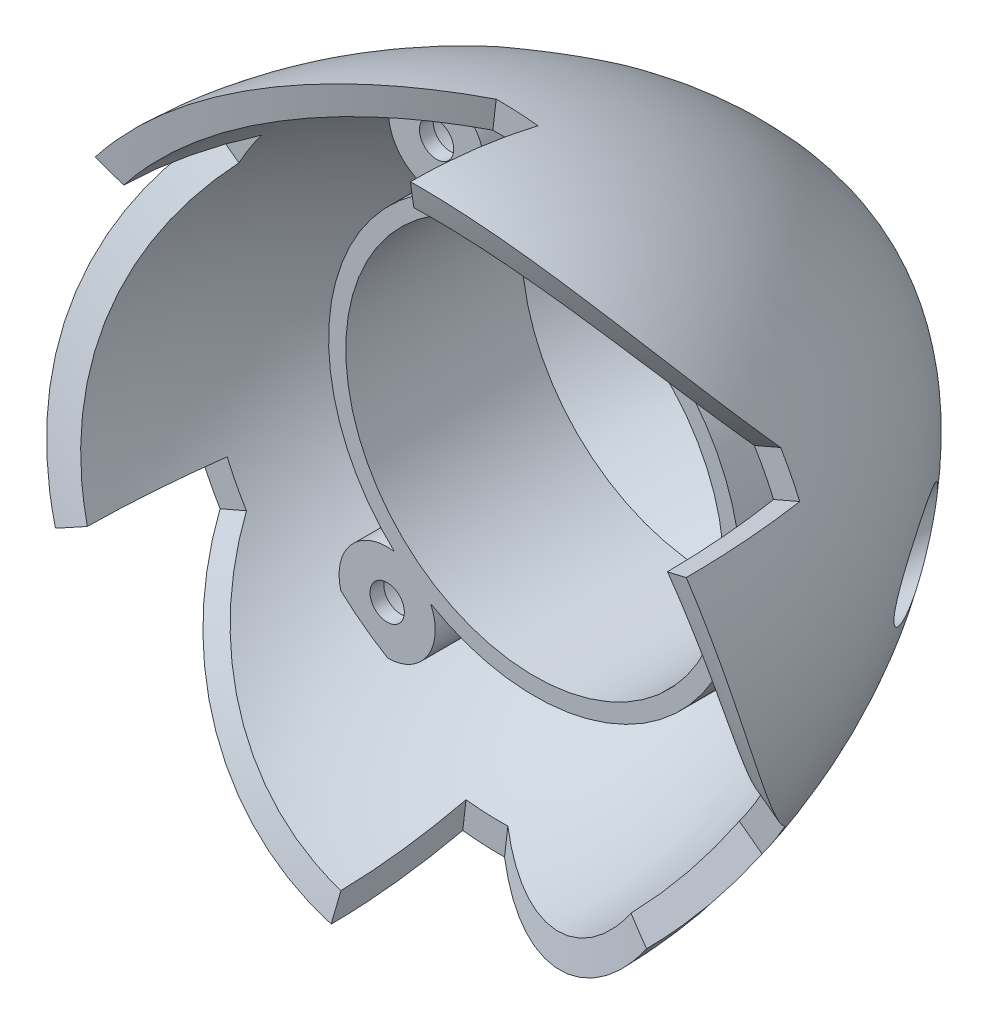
ISO-10303-21;
HEADER;
FILE_DESCRIPTION(('STEP AP214'),'2;1');
FILE_NAME('part.step','',(''),(''),'','','');
FILE_SCHEMA(('AUTOMOTIVE_DESIGN { 1 0 10303 214 1 1 1 1 }'));
ENDSEC;
DATA;
#1=APPLICATION_CONTEXT('core data for automotive mechanical design processes');
#2=APPLICATION_PROTOCOL_DEFINITION('international standard','automotive_design',2000,#1);
#3=PRODUCT_CONTEXT('',#1,'mechanical');
#4=PRODUCT('Part','Part','',(#3));
#5=PRODUCT_RELATED_PRODUCT_CATEGORY('part','',(#4));
#6=PRODUCT_DEFINITION_FORMATION('','',#4);
#7=PRODUCT_DEFINITION_CONTEXT('part definition',#1,'design');
#8=PRODUCT_DEFINITION('design','',#6,#7);
#9=PRODUCT_DEFINITION_SHAPE('','',#8);
#10=(LENGTH_UNIT() NAMED_UNIT(*) SI_UNIT(.MILLI.,.METRE.));
#11=(NAMED_UNIT(*) PLANE_ANGLE_UNIT() SI_UNIT($,.RADIAN.));
#12=(NAMED_UNIT(*) SI_UNIT($,.STERADIAN.) SOLID_ANGLE_UNIT());
#13=UNCERTAINTY_MEASURE_WITH_UNIT(LENGTH_MEASURE(1.E-05),#10,'distance_accuracy_value','');
#14=(GEOMETRIC_REPRESENTATION_CONTEXT(3) GLOBAL_UNCERTAINTY_ASSIGNED_CONTEXT((#13)) GLOBAL_UNIT_ASSIGNED_CONTEXT((#10,
#11,#12)) REPRESENTATION_CONTEXT('',''));
#15=CARTESIAN_POINT('',(0.,0.,0.));
#16=DIRECTION('',(0.,0.,1.));
#17=DIRECTION('',(1.,0.,0.));
#18=AXIS2_PLACEMENT_3D('',#15,#16,#17);
#19=CARTESIAN_POINT('',(0.,0.,-35.001147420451));
#20=DIRECTION('',(0.,0.,1.));
#21=DIRECTION('',(1.,0.,0.));
#22=AXIS2_PLACEMENT_3D('',#19,#20,#21);
#23=CYLINDRICAL_SURFACE('',#22,15.);
#24=DIRECTION('',(0.,0.,1.));
#25=VECTOR('',#24,1.);
#26=CARTESIAN_POINT('',(-7.42487669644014,13.0334648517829,-17.6115307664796));
#27=LINE('',#26,#25);
#28=CARTESIAN_POINT('',(-7.42487669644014,13.0334648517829,-23.2230615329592));
#29=VERTEX_POINT('',#28);
#30=CARTESIAN_POINT('',(-7.42487669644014,13.0334648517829,-12.));
#31=VERTEX_POINT('',#30);
#32=EDGE_CURVE('E318',#29,#31,#27,.T.);
#33=ORIENTED_EDGE('',*,*,#32,.F.);
#34=CARTESIAN_POINT('',(0.,0.,-23.2230615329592));
#35=DIRECTION('',(0.,0.,1.));
#36=DIRECTION('',(1.,0.,0.));
#37=AXIS2_PLACEMENT_3D('',#34,#35,#36);
#38=CIRCLE('',#37,15.);
#39=CARTESIAN_POINT('',(-10.212603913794,-10.9864790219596,-23.2230615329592));
#40=VERTEX_POINT('',#39);
#41=EDGE_CURVE('E124',#29,#40,#38,.T.);
#42=ORIENTED_EDGE('',*,*,#41,.T.);
#43=DIRECTION('',(0.,0.,1.));
#44=VECTOR('',#43,1.);
#45=CARTESIAN_POINT('',(-10.212603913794,-10.9864790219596,-17.6115307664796));
#46=LINE('',#45,#44);
#47=CARTESIAN_POINT('',(-10.212603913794,-10.9864790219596,-12.));
#48=VERTEX_POINT('',#47);
#49=EDGE_CURVE('E1145',#48,#40,#46,.F.);
#50=ORIENTED_EDGE('',*,*,#49,.F.);
#51=CARTESIAN_POINT('',(0.,0.,-12.));
#52=DIRECTION('',(0.,0.,1.));
#53=DIRECTION('',(1.,0.,0.));
#54=AXIS2_PLACEMENT_3D('',#51,#52,#53);
#55=CIRCLE('',#54,15.);
#56=EDGE_CURVE('E636',#31,#48,#55,.T.);
#57=ORIENTED_EDGE('',*,*,#56,.F.);
#58=EDGE_LOOP('',(#33,#42,#50,#57));
#59=FACE_BOUND('',#58,.T.);
#60=ADVANCED_FACE('F110',(#59),#23,.T.);
#61=DIRECTION('',(0.,0.,1.));
#62=VECTOR('',#61,1.);
#63=CARTESIAN_POINT('',(-7.57487331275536,-12.9468642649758,-17.6115307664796));
#64=LINE('',#63,#62);
#65=CARTESIAN_POINT('',(-7.57487331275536,-12.9468642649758,-23.2230615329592));
#66=VERTEX_POINT('',#65);
#67=CARTESIAN_POINT('',(-7.57487331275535,-12.9468642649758,-12.));
#68=VERTEX_POINT('',#67);
#69=EDGE_CURVE('E761',#66,#68,#64,.T.);
#70=ORIENTED_EDGE('',*,*,#69,.F.);
#71=CARTESIAN_POINT('',(14.6208718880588,-3.35113491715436,-23.2230615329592));
#72=VERTEX_POINT('',#71);
#73=EDGE_CURVE('E126',#66,#72,#38,.T.);
#74=ORIENTED_EDGE('',*,*,#73,.T.);
#75=DIRECTION('',(0.,0.,1.));
#76=VECTOR('',#75,1.);
#77=CARTESIAN_POINT('',(14.6208718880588,-3.35113491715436,-17.9784323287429));
#78=LINE('',#77,#76);
#79=CARTESIAN_POINT('',(14.6208718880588,-3.35113491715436,-12.));
#80=VERTEX_POINT('',#79);
#81=EDGE_CURVE('E753',#80,#72,#78,.F.);
#82=ORIENTED_EDGE('',*,*,#81,.F.);
#83=EDGE_CURVE('E741',#68,#80,#55,.T.);
#84=ORIENTED_EDGE('',*,*,#83,.F.);
#85=EDGE_LOOP('',(#70,#74,#82,#84));
#86=FACE_BOUND('',#85,.T.);
#87=ADVANCED_FACE('F389',(#86),#23,.T.);
#88=CARTESIAN_POINT('',(0.,0.,-35.));
#89=CARTESIAN_POINT('',(0.,12.,-35.));
#90=CARTESIAN_POINT('',(0.,25.,-17.));
#91=CARTESIAN_POINT('',(0.,25.,0.));
#92=B_SPLINE_CURVE_WITH_KNOTS('',3,(#88,#89,#90,#91),.UNSPECIFIED.,.F.,.F.,(4,4),(0.,1.),.UNSPECIFIED.);
#93=CARTESIAN_POINT('',(0.,0.,0.));
#94=DIRECTION('',(0.,0.,1.));
#95=AXIS1_PLACEMENT('',#93,#94);
#96=SURFACE_OF_REVOLUTION('',#92,#95);
#97=CARTESIAN_POINT('',(-4.39287633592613,16.5220857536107,-23.7403860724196));
#98=CARTESIAN_POINT('',(-4.39288102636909,16.6565489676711,-23.5575739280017));
#99=CARTESIAN_POINT('',(-4.40269482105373,16.7876731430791,-23.3724184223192));
#100=CARTESIAN_POINT('',(-4.43958029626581,17.0429792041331,-22.9989241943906));
#101=CARTESIAN_POINT('',(-4.46666299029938,17.1671566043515,-22.8105835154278));
#102=CARTESIAN_POINT('',(-4.53662801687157,17.4085497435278,-22.4313965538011));
#103=CARTESIAN_POINT('',(-4.5795696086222,17.525737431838,-22.2405434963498));
#104=CARTESIAN_POINT('',(-4.68021563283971,17.7521868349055,-21.8581188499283));
#105=CARTESIAN_POINT('',(-4.73791612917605,17.861450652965,-21.6665474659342));
#106=CARTESIAN_POINT('',(-4.87170209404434,18.0782050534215,-21.2714398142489));
#107=CARTESIAN_POINT('',(-4.94872167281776,18.1851434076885,-21.0679154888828));
#108=CARTESIAN_POINT('',(-5.1189449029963,18.3885818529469,-20.6622478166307));
#109=CARTESIAN_POINT('',(-5.21215783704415,18.4850759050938,-20.4601053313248));
#110=CARTESIAN_POINT('',(-5.41524003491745,18.6659727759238,-20.0593210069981));
#111=CARTESIAN_POINT('',(-5.52507102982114,18.7504025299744,-19.8606722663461));
#112=CARTESIAN_POINT('',(-5.70351575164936,18.8663861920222,-19.5670432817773));
#113=CARTESIAN_POINT('',(-5.76524542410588,18.9032545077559,-19.4699393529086));
#114=CARTESIAN_POINT('',(-5.89364052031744,18.9730564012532,-19.2775541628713));
#115=CARTESIAN_POINT('',(-5.96030646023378,19.0059895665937,-19.1822730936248));
#116=CARTESIAN_POINT('',(-6.0941588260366,19.0652471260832,-19.0006827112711));
#117=CARTESIAN_POINT('',(-6.16098870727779,19.0918714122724,-18.9142093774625));
#118=CARTESIAN_POINT('',(-6.2996541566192,19.1406499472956,-18.7440952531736));
#119=CARTESIAN_POINT('',(-6.37148750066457,19.1628061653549,-18.6604532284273));
#120=CARTESIAN_POINT('',(-6.52038533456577,19.2018069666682,-18.4972511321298));
#121=CARTESIAN_POINT('',(-6.59742750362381,19.2186726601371,-18.4176759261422));
#122=CARTESIAN_POINT('',(-6.75748870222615,19.2461577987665,-18.26369191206));
#123=CARTESIAN_POINT('',(-6.84050183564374,19.2567833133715,-18.1892781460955));
#124=CARTESIAN_POINT('',(-7.00708388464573,19.2699101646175,-18.0525359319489));
#125=CARTESIAN_POINT('',(-7.09021006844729,19.2729265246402,-17.9897265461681));
#126=CARTESIAN_POINT('',(-7.26241664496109,19.2708384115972,-17.872679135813));
#127=CARTESIAN_POINT('',(-7.35150196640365,19.2657271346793,-17.818448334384));
#128=CARTESIAN_POINT('',(-7.53656741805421,19.245364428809,-17.7213641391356));
#129=CARTESIAN_POINT('',(-7.63262847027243,19.229967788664,-17.6786861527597));
#130=CARTESIAN_POINT('',(-7.77907307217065,19.1979506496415,-17.6274961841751));
#131=CARTESIAN_POINT('',(-7.82823582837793,19.1858058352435,-17.6125781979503));
#132=CARTESIAN_POINT('',(-7.92690839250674,19.1584494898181,-17.5875032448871));
#133=CARTESIAN_POINT('',(-7.97641802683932,19.1432393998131,-17.5773440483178));
#134=CARTESIAN_POINT('',(-8.09779295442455,19.1020828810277,-17.5587780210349));
#135=CARTESIAN_POINT('',(-8.1695521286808,19.0744041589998,-17.5532853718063));
#136=CARTESIAN_POINT('',(-8.31040997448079,19.0131238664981,-17.5539161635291));
#137=CARTESIAN_POINT('',(-8.37950886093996,18.9795227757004,-17.5600386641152));
#138=CARTESIAN_POINT('',(-8.51295034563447,18.9076933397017,-17.5832342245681));
#139=CARTESIAN_POINT('',(-8.57730912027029,18.8694820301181,-17.6002679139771));
#140=CARTESIAN_POINT('',(-8.7004270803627,18.7896688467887,-17.6437973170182));
#141=CARTESIAN_POINT('',(-8.75918225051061,18.748064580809,-17.6702997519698));
#142=CARTESIAN_POINT('',(-8.98544051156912,18.5747899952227,-17.7934470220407));
#143=CARTESIAN_POINT('',(-9.12836854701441,18.4336855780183,-17.9223352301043));
#144=CARTESIAN_POINT('',(-9.29798183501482,18.2321472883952,-18.1286647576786));
#145=CARTESIAN_POINT('',(-9.3443905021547,18.1717432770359,-18.1933560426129));
#146=CARTESIAN_POINT('',(-9.42995874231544,18.0508713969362,-18.3273439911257));
#147=CARTESIAN_POINT('',(-9.46913020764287,17.9904038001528,-18.3966328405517));
#148=CARTESIAN_POINT('',(-9.54113881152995,17.8696060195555,-18.5387738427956));
#149=CARTESIAN_POINT('',(-9.57395945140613,17.809276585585,-18.6116346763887));
#150=CARTESIAN_POINT('',(-9.63392303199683,17.6890012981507,-18.7600174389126));
#151=CARTESIAN_POINT('',(-9.66106313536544,17.6290556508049,-18.8355406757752));
#152=CARTESIAN_POINT('',(-9.73154298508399,17.457959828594,-19.0549159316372));
#153=CARTESIAN_POINT('',(-9.76855465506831,17.3474283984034,-19.2012953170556));
#154=CARTESIAN_POINT('',(-9.82758703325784,17.1284443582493,-19.4985557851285));
#155=CARTESIAN_POINT('',(-9.84959856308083,17.0199930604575,-19.649439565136));
#156=CARTESIAN_POINT('',(-9.88042536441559,16.8051461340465,-19.9544531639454));
#157=CARTESIAN_POINT('',(-9.88921211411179,16.6987554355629,-20.1085892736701));
#158=CARTESIAN_POINT('',(-9.89468103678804,16.4884240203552,-20.4187515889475));
#159=CARTESIAN_POINT('',(-9.8913601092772,16.3844839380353,-20.5747782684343));
#160=CARTESIAN_POINT('',(-9.86997166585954,16.1404986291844,-20.9470768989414));
#161=CARTESIAN_POINT('',(-9.84680873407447,16.0016421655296,-21.1638480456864));
#162=CARTESIAN_POINT('',(-9.7799515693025,15.7296555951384,-21.5979413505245));
#163=CARTESIAN_POINT('',(-9.73624667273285,15.5965285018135,-21.8152637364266));
#164=CARTESIAN_POINT('',(-9.62855467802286,15.3373670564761,-22.2485405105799));
#165=CARTESIAN_POINT('',(-9.56460608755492,15.2113197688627,-22.4644967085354));
#166=CARTESIAN_POINT('',(-9.41586419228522,14.9676071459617,-22.8938418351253));
#167=CARTESIAN_POINT('',(-9.33108589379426,14.8499358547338,-23.1072324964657));
#168=CARTESIAN_POINT('',(-9.1823100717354,14.6755093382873,-23.4349493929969));
#169=CARTESIAN_POINT('',(-9.12600693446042,14.6150718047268,-23.5508467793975));
#170=CARTESIAN_POINT('',(-9.00629784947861,14.4979374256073,-23.7808400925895));
#171=CARTESIAN_POINT('',(-8.94289349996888,14.4412397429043,-23.8949364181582));
#172=CARTESIAN_POINT('',(-8.80859677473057,14.3322570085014,-24.1207144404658));
#173=CARTESIAN_POINT('',(-8.73770889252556,14.2799693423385,-24.2323975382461));
#174=CARTESIAN_POINT('',(-8.58790188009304,14.1806159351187,-24.4526584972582));
#175=CARTESIAN_POINT('',(-8.50898510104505,14.133548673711,-24.5612372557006));
#176=CARTESIAN_POINT('',(-8.36675265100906,14.05853745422,-24.7432257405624));
#177=CARTESIAN_POINT('',(-8.30558750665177,14.0290164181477,-24.81766798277));
#178=CARTESIAN_POINT('',(-8.1786739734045,13.9736712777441,-24.9639629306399));
#179=CARTESIAN_POINT('',(-8.11292682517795,13.9478461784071,-25.035816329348));
#180=CARTESIAN_POINT('',(-7.97666461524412,13.9005418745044,-25.1762223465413));
#181=CARTESIAN_POINT('',(-7.90615534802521,13.879057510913,-25.2447788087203));
#182=CARTESIAN_POINT('',(-7.76011789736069,13.8411903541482,-25.377785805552));
#183=CARTESIAN_POINT('',(-7.68459219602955,13.8248050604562,-25.4422383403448));
#184=CARTESIAN_POINT('',(-7.50650386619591,13.7943460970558,-25.583241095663));
#185=CARTESIAN_POINT('',(-7.40227575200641,13.7821919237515,-25.6581513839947));
#186=CARTESIAN_POINT('',(-7.1855926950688,13.7702834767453,-25.7961613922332));
#187=CARTESIAN_POINT('',(-7.07314978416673,13.7705114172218,-25.8592779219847));
#188=CARTESIAN_POINT('',(-6.86575015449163,13.7845523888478,-25.9578066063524));
#189=CARTESIAN_POINT('',(-6.77207934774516,13.795502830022,-25.996253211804));
#190=CARTESIAN_POINT('',(-6.62980019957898,13.8199426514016,-26.0444598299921));
#191=CARTESIAN_POINT('',(-6.58207146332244,13.829426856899,-26.0589528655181));
#192=CARTESIAN_POINT('',(-6.48633242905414,13.8511579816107,-26.084499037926));
#193=CARTESIAN_POINT('',(-6.4383222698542,13.8634036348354,-26.095553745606));
#194=CARTESIAN_POINT('',(-6.34199605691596,13.8908087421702,-26.1140465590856));
#195=CARTESIAN_POINT('',(-6.29368068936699,13.9059910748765,-26.1214545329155));
#196=CARTESIAN_POINT('',(-6.19757532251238,13.9391630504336,-26.1323296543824));
#197=CARTESIAN_POINT('',(-6.14978526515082,13.9571523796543,-26.1357972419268));
#198=CARTESIAN_POINT('',(-6.0551959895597,13.995811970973,-26.1386964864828));
#199=CARTESIAN_POINT('',(-6.00839637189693,14.0164811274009,-26.1381298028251));
#200=CARTESIAN_POINT('',(-5.91619617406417,14.0603044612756,-26.1329853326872));
#201=CARTESIAN_POINT('',(-5.87079608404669,14.0834594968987,-26.1284061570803));
#202=CARTESIAN_POINT('',(-5.74778503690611,14.1505487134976,-26.1103474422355));
#203=CARTESIAN_POINT('',(-5.67202991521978,14.196856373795,-26.0927426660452));
#204=CARTESIAN_POINT('',(-5.52756800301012,14.294772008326,-26.0466601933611));
#205=CARTESIAN_POINT('',(-5.45886980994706,14.3463862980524,-26.0181694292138));
#206=CARTESIAN_POINT('',(-5.34841502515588,14.4374008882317,-25.9618702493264));
#207=CARTESIAN_POINT('',(-5.30470221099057,14.4758950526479,-25.9363554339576));
#208=CARTESIAN_POINT('',(-5.22114241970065,14.554164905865,-25.8814398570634));
#209=CARTESIAN_POINT('',(-5.18129197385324,14.5939394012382,-25.8520426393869));
#210=CARTESIAN_POINT('',(-5.06716111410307,14.7148202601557,-25.7586852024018));
#211=CARTESIAN_POINT('',(-4.99846974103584,14.7973416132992,-25.6896495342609));
#212=CARTESIAN_POINT('',(-4.88911683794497,14.9442995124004,-25.5591012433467));
#213=CARTESIAN_POINT('',(-4.84564973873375,15.0084895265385,-25.4995597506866));
#214=CARTESIAN_POINT('',(-4.76592830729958,15.1370458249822,-25.375940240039));
#215=CARTESIAN_POINT('',(-4.72967744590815,15.2014121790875,-25.3118600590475));
#216=CARTESIAN_POINT('',(-4.66367918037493,15.3299002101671,-25.1800729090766));
#217=CARTESIAN_POINT('',(-4.63393986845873,15.3940214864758,-25.1123615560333));
#218=CARTESIAN_POINT('',(-4.58036991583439,15.5216606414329,-24.9740828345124));
#219=CARTESIAN_POINT('',(-4.55654078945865,15.5851783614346,-24.9035147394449));
#220=CARTESIAN_POINT('',(-4.51001469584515,15.7240121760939,-24.745746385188));
#221=CARTESIAN_POINT('',(-4.4884963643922,15.7991484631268,-24.6580413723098));
#222=CARTESIAN_POINT('',(-4.45237824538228,15.9479962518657,-24.4800586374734));
#223=CARTESIAN_POINT('',(-4.43777936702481,16.0217075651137,-24.3897805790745));
#224=CARTESIAN_POINT('',(-4.40335872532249,16.2403829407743,-24.1160184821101));
#225=CARTESIAN_POINT('',(-4.39287148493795,16.3830201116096,-23.9294555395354));
#226=CARTESIAN_POINT('',(-4.39287633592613,16.5220857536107,-23.7403860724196));
#227=B_SPLINE_CURVE_WITH_KNOTS('',3,(#97,#98,#99,#100,#101,#102,#103,#104,#105,#106,#107,#108,
#109,#110,#111,#112,#113,#114,#115,#116,#117,#118,#119,#120,#121,#122,#123,#124,#125,#126,#127,
#128,#129,#130,#131,#132,#133,#134,#135,#136,#137,#138,#139,#140,#141,#142,#143,#144,#145,#146,
#147,#148,#149,#150,#151,#152,#153,#154,#155,#156,#157,#158,#159,#160,#161,#162,#163,#164,#165,
#166,#167,#168,#169,#170,#171,#172,#173,#174,#175,#176,#177,#178,#179,#180,#181,#182,#183,#184,
#185,#186,#187,#188,#189,#190,#191,#192,#193,#194,#195,#196,#197,#198,#199,#200,#201,#202,#203,
#204,#205,#206,#207,#208,#209,#210,#211,#212,#213,#214,#215,#216,#217,#218,#219,#220,#221,#222,
#223,#224,#225,#226),.UNSPECIFIED.,.T.,.F.,(4,2,2,2,2,2,2,2,2,2,2,2,2,2,2,2,2,2,2,2,2,2,2,2,2,2,
2,2,2,2,2,2,2,2,2,2,2,2,2,2,2,2,2,2,2,2,2,2,2,2,2,2,2,2,2,2,2,2,2,2,2,2,2,2,4),(0.,
0.68047536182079,1.3613851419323,2.04486542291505,2.72816361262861,3.45480968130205,
4.18187367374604,4.90728813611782,5.26962626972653,5.63200234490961,5.96925415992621,
6.30635701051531,6.64209712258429,6.97751013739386,7.28952527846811,7.60180175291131,
7.91858291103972,8.07669553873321,8.23473400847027,8.46487588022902,8.69499912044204,
8.92429665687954,9.15375728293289,9.85463410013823,10.1545546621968,10.4539779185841,
10.7541688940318,11.0545094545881,11.6149750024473,12.1757831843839,12.7377991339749,
13.2999590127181,14.0744183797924,14.8492802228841,15.6226768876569,16.395518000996,
16.8222827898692,17.2489517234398,17.6753659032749,18.101655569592,18.403786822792,
18.7058365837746,19.0075252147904,19.3090656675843,19.6947123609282,20.0798051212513,
20.3840377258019,20.5361969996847,20.6882866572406,20.8416127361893,20.9949216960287,
21.1481676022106,21.3014665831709,21.5717417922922,21.842342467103,22.0328565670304,
22.2231979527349,22.6045871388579,22.8974831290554,23.1905196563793,23.4839183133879,
23.777392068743,24.1295341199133,24.4817224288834,25.1854892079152),.UNSPECIFIED.);
#228=CARTESIAN_POINT('',(-4.39287633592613,16.5220857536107,-23.7403860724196));
#229=VERTEX_POINT('',#228);
#230=EDGE_CURVE('E116',#229,#229,#227,.T.);
#231=ORIENTED_EDGE('',*,*,#230,.T.);
#232=EDGE_LOOP('',(#231));
#233=FACE_BOUND('',#232,.T.);
#234=CARTESIAN_POINT('',(-7.98710781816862,-14.4469552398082,-24.5466767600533));
#235=CARTESIAN_POINT('',(-7.98710822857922,-14.3711488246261,-24.6352656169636));
#236=CARTESIAN_POINT('',(-7.99023559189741,-14.2938802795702,-24.7226083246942));
#237=CARTESIAN_POINT('',(-8.00355369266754,-14.1364279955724,-24.8941460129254));
#238=CARTESIAN_POINT('',(-8.01374618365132,-14.0562435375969,-24.9783402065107));
#239=CARTESIAN_POINT('',(-8.04214126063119,-13.8933578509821,-25.1423668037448));
#240=CARTESIAN_POINT('',(-8.06031834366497,-13.8106654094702,-25.2222121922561));
#241=CARTESIAN_POINT('',(-8.10585589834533,-13.6428643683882,-25.3764939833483));
#242=CARTESIAN_POINT('',(-8.13320820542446,-13.5577579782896,-25.4509351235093));
#243=CARTESIAN_POINT('',(-8.19962475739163,-13.3826441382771,-25.5951829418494));
#244=CARTESIAN_POINT('',(-8.23906140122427,-13.2925689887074,-25.6647402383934));
#245=CARTESIAN_POINT('',(-8.33102681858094,-13.111455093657,-25.7936169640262));
#246=CARTESIAN_POINT('',(-8.38355807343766,-13.0204161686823,-25.8529344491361));
#247=CARTESIAN_POINT('',(-8.47355336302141,-12.8843162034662,-25.9317998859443));
#248=CARTESIAN_POINT('',(-8.50569097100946,-12.8386993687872,-25.9565438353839));
#249=CARTESIAN_POINT('',(-8.57374816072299,-12.7482579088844,-26.0019056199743));
#250=CARTESIAN_POINT('',(-8.60966545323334,-12.703432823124,-26.0225259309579));
#251=CARTESIAN_POINT('',(-8.68520609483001,-12.6151338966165,-26.0590825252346));
#252=CARTESIAN_POINT('',(-8.72482337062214,-12.5716579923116,-26.075026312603));
#253=CARTESIAN_POINT('',(-8.80762950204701,-12.4865639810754,-26.1017796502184));
#254=CARTESIAN_POINT('',(-8.85081741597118,-12.4449453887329,-26.1125905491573));
#255=CARTESIAN_POINT('',(-8.93389555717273,-12.3700380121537,-26.1275348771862));
#256=CARTESIAN_POINT('',(-8.97335431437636,-12.3364170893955,-26.1324098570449));
#257=CARTESIAN_POINT('',(-9.05429184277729,-12.2713344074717,-26.1380047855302));
#258=CARTESIAN_POINT('',(-9.09577034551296,-12.2398723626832,-26.1387252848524));
#259=CARTESIAN_POINT('',(-9.1803559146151,-12.1794180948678,-26.1359893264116));
#260=CARTESIAN_POINT('',(-9.2234629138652,-12.1504257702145,-26.1325330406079));
#261=CARTESIAN_POINT('',(-9.31085864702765,-12.0951492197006,-26.1215478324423));
#262=CARTESIAN_POINT('',(-9.35514733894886,-12.0688648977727,-26.1140190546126));
#263=CARTESIAN_POINT('',(-9.47722671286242,-12.0009337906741,-26.0881273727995));
#264=CARTESIAN_POINT('',(-9.55581000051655,-11.9621253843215,-26.0658679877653));
#265=CARTESIAN_POINT('',(-9.71315998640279,-11.8932444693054,-26.0112260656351));
#266=CARTESIAN_POINT('',(-9.79192672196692,-11.863173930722,-25.978841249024));
#267=CARTESIAN_POINT('',(-9.98728907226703,-11.798274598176,-25.8874069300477));
#268=CARTESIAN_POINT('',(-10.1031337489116,-11.7685680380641,-25.8231176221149));
#269=CARTESIAN_POINT('',(-10.3293526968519,-11.7248979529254,-25.6809331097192));
#270=CARTESIAN_POINT('',(-10.4397116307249,-11.7109764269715,-25.6030022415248));
#271=CARTESIAN_POINT('',(-10.6307496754,-11.6977247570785,-25.4553356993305));
#272=CARTESIAN_POINT('',(-10.7127146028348,-11.6959038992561,-25.3874318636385));
#273=CARTESIAN_POINT('',(-10.8724911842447,-11.6991265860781,-25.2470019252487));
#274=CARTESIAN_POINT('',(-10.9503004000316,-11.7041741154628,-25.1744731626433));
#275=CARTESIAN_POINT('',(-11.1018474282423,-11.7201847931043,-25.0257605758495));
#276=CARTESIAN_POINT('',(-11.1755802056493,-11.731155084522,-24.9495724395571));
#277=CARTESIAN_POINT('',(-11.3190160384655,-11.7582365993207,-24.7943521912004));
#278=CARTESIAN_POINT('',(-11.3887176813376,-11.774349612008,-24.7153190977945));
#279=CARTESIAN_POINT('',(-11.5710306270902,-11.8237549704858,-24.4996226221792));
#280=CARTESIAN_POINT('',(-11.6800331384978,-11.8612266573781,-24.3608524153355));
#281=CARTESIAN_POINT('',(-11.8876220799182,-11.9466725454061,-24.0788045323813));
#282=CARTESIAN_POINT('',(-11.9862015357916,-11.9946537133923,-23.9355239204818));
#283=CARTESIAN_POINT('',(-12.1736895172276,-12.0995539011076,-23.6454911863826));
#284=CARTESIAN_POINT('',(-12.2625766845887,-12.1564920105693,-23.4987322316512));
#285=CARTESIAN_POINT('',(-12.430864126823,-12.2779802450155,-23.2030199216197));
#286=CARTESIAN_POINT('',(-12.5102657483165,-12.3425292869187,-23.0540668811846));
#287=CARTESIAN_POINT('',(-12.691702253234,-12.5071613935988,-22.6910646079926));
#288=CARTESIAN_POINT('',(-12.7890391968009,-12.6106979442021,-22.4762200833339));
#289=CARTESIAN_POINT('',(-12.965613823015,-12.8295397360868,-22.0449855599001));
#290=CARTESIAN_POINT('',(-13.0448413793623,-12.9448515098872,-21.8285947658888));
#291=CARTESIAN_POINT('',(-13.1848921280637,-13.1858995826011,-21.3960087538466));
#292=CARTESIAN_POINT('',(-13.2457355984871,-13.3116241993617,-21.1798135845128));
#293=CARTESIAN_POINT('',(-13.3482816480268,-13.5729004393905,-20.7489410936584));
#294=CARTESIAN_POINT('',(-13.389996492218,-13.7084457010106,-20.5342628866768));
#295=CARTESIAN_POINT('',(-13.4387137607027,-13.9271081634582,-20.2024908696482));
#296=CARTESIAN_POINT('',(-13.4529089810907,-14.006901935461,-20.0842269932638));
#297=CARTESIAN_POINT('',(-13.4743098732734,-14.1695436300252,-19.8491837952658));
#298=CARTESIAN_POINT('',(-13.4815169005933,-14.2523909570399,-19.7324041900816));
#299=CARTESIAN_POINT('',(-13.4882823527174,-14.421154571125,-19.5009915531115));
#300=CARTESIAN_POINT('',(-13.4878470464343,-14.5070682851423,-19.3863568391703));
#301=CARTESIAN_POINT('',(-13.4784356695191,-14.6821372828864,-19.1599513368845));
#302=CARTESIAN_POINT('',(-13.4694623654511,-14.7712915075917,-19.048179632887));
#303=CARTESIAN_POINT('',(-13.4464989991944,-14.9216285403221,-18.866558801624));
#304=CARTESIAN_POINT('',(-13.4353089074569,-14.9818464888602,-18.7955535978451));
#305=CARTESIAN_POINT('',(-13.4082499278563,-15.1037659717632,-18.6557529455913));
#306=CARTESIAN_POINT('',(-13.3923823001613,-15.1654671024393,-18.5869569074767));
#307=CARTESIAN_POINT('',(-13.3554071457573,-15.2903074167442,-18.4522627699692));
#308=CARTESIAN_POINT('',(-13.3343055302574,-15.3534449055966,-18.3863614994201));
#309=CARTESIAN_POINT('',(-13.2861351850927,-15.4811786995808,-18.2582451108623));
#310=CARTESIAN_POINT('',(-13.259068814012,-15.5457744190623,-18.1960285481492));
#311=CARTESIAN_POINT('',(-13.2099823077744,-15.6508323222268,-18.0997921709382));
#312=CARTESIAN_POINT('',(-13.1901058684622,-15.690889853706,-18.0642323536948));
#313=CARTESIAN_POINT('',(-13.1475857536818,-15.7714055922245,-17.9953094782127));
#314=CARTESIAN_POINT('',(-13.1249432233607,-15.8118636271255,-17.9619455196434));
#315=CARTESIAN_POINT('',(-13.0766882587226,-15.8930145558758,-17.8978881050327));
#316=CARTESIAN_POINT('',(-13.051080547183,-15.9337069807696,-17.8671905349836));
#317=CARTESIAN_POINT('',(-12.9966122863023,-16.0152495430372,-17.8089039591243));
#318=CARTESIAN_POINT('',(-12.9677475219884,-16.0560998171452,-17.7813190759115));
#319=CARTESIAN_POINT('',(-12.8902600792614,-16.1594226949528,-17.7161906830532));
#320=CARTESIAN_POINT('',(-12.8393104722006,-16.2218071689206,-17.6811826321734));
#321=CARTESIAN_POINT('',(-12.7291319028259,-16.3446103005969,-17.6226753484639));
#322=CARTESIAN_POINT('',(-12.6699202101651,-16.4050327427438,-17.5991525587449));
#323=CARTESIAN_POINT('',(-12.5752319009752,-16.492852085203,-17.5741371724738));
#324=CARTESIAN_POINT('',(-12.5424947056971,-16.5218070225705,-17.5675025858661));
#325=CARTESIAN_POINT('',(-12.4753609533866,-16.578362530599,-17.5579441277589));
#326=CARTESIAN_POINT('',(-12.4409651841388,-16.6059637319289,-17.5550185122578));
#327=CARTESIAN_POINT('',(-12.3708115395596,-16.6595238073,-17.5529783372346));
#328=CARTESIAN_POINT('',(-12.3350537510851,-16.6854827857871,-17.5538635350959));
#329=CARTESIAN_POINT('',(-12.2625384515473,-16.7355149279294,-17.5594065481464));
#330=CARTESIAN_POINT('',(-12.2257809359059,-16.7595880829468,-17.5640643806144));
#331=CARTESIAN_POINT('',(-12.1245065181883,-16.8225216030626,-17.5817588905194));
#332=CARTESIAN_POINT('',(-12.0593213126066,-16.859341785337,-17.5984304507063));
#333=CARTESIAN_POINT('',(-11.9287942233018,-16.9264300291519,-17.6412682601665));
#334=CARTESIAN_POINT('',(-11.8634522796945,-16.9566949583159,-17.6674390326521));
#335=CARTESIAN_POINT('',(-11.6998931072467,-17.0251306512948,-17.7432625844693));
#336=CARTESIAN_POINT('',(-11.6023329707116,-17.0591726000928,-17.7980404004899));
#337=CARTESIAN_POINT('',(-11.4116111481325,-17.1148170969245,-17.920162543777));
#338=CARTESIAN_POINT('',(-11.3184628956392,-17.1363836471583,-17.9875425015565));
#339=CARTESIAN_POINT('',(-11.1509399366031,-17.1667598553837,-18.1200257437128));
#340=CARTESIAN_POINT('',(-11.0758556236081,-17.1770049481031,-18.1839339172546));
#341=CARTESIAN_POINT('',(-10.9291984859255,-17.1912283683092,-18.3163649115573));
#342=CARTESIAN_POINT('',(-10.8576282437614,-17.1952021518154,-18.3848910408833));
#343=CARTESIAN_POINT('',(-10.7177667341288,-17.197777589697,-18.5254662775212));
#344=CARTESIAN_POINT('',(-10.6494803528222,-17.1963714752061,-18.5975203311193));
#345=CARTESIAN_POINT('',(-10.5160594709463,-17.1888702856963,-18.7442726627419));
#346=CARTESIAN_POINT('',(-10.4509261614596,-17.1827734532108,-18.8189719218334));
#347=CARTESIAN_POINT('',(-10.2684159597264,-17.159374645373,-19.0360484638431));
#348=CARTESIAN_POINT('',(-10.1546941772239,-17.1369408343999,-19.1809618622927));
#349=CARTESIAN_POINT('',(-9.93641754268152,-17.0802227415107,-19.4753391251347));
#350=CARTESIAN_POINT('',(-9.83187022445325,-17.0459288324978,-19.6248065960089));
#351=CARTESIAN_POINT('',(-9.63104371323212,-16.9670309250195,-19.927017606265));
#352=CARTESIAN_POINT('',(-9.53478326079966,-16.922404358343,-20.0797676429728));
#353=CARTESIAN_POINT('',(-9.35032885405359,-16.82398414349,-20.3871812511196));
#354=CARTESIAN_POINT('',(-9.26213676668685,-16.7701883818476,-20.5418452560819));
#355=CARTESIAN_POINT('',(-9.06068565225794,-16.6315295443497,-20.9129484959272));
#356=CARTESIAN_POINT('',(-8.9510892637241,-16.5427387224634,-21.1299223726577));
#357=CARTESIAN_POINT('',(-8.74713350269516,-16.3501563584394,-21.5644977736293));
#358=CARTESIAN_POINT('',(-8.65278248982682,-16.2463566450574,-21.7820995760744));
#359=CARTESIAN_POINT('',(-8.48040334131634,-16.0247509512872,-22.2158617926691));
#360=CARTESIAN_POINT('',(-8.40233303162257,-15.9069824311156,-22.4320244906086));
#361=CARTESIAN_POINT('',(-8.26381776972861,-15.6576044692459,-22.8617934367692));
#362=CARTESIAN_POINT('',(-8.2033597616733,-15.5260053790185,-23.0754014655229));
#363=CARTESIAN_POINT('',(-8.10127377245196,-15.2455191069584,-23.5034321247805));
#364=CARTESIAN_POINT('',(-8.06012388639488,-15.0962972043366,-23.7177549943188));
#365=CARTESIAN_POINT('',(-8.01734117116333,-14.8613119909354,-24.0335997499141));
#366=CARTESIAN_POINT('',(-8.00623629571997,-14.7810721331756,-24.138003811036));
#367=CARTESIAN_POINT('',(-7.99111978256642,-14.616831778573,-24.3443637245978));
#368=CARTESIAN_POINT('',(-7.98710735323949,-14.5328317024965,-24.4463198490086));
#369=CARTESIAN_POINT('',(-7.98710781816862,-14.4469552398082,-24.5466767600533));
#370=B_SPLINE_CURVE_WITH_KNOTS('',3,(#234,#235,#236,#237,#238,#239,#240,#241,#242,#243,#244,
#245,#246,#247,#248,#249,#250,#251,#252,#253,#254,#255,#256,#257,#258,#259,#260,#261,#262,#263,
#264,#265,#266,#267,#268,#269,#270,#271,#272,#273,#274,#275,#276,#277,#278,#279,#280,#281,#282,
#283,#284,#285,#286,#287,#288,#289,#290,#291,#292,#293,#294,#295,#296,#297,#298,#299,#300,#301,
#302,#303,#304,#305,#306,#307,#308,#309,#310,#311,#312,#313,#314,#315,#316,#317,#318,#319,#320,
#321,#322,#323,#324,#325,#326,#327,#328,#329,#330,#331,#332,#333,#334,#335,#336,#337,#338,#339,
#340,#341,#342,#343,#344,#345,#346,#347,#348,#349,#350,#351,#352,#353,#354,#355,#356,#357,#358,
#359,#360,#361,#362,#363,#364,#365,#366,#367,#368,#369),.UNSPECIFIED.,.T.,.F.,(4,2,2,2,2,2,2,2,
2,2,2,2,2,2,2,2,2,2,2,2,2,2,2,2,2,2,2,2,2,2,2,2,2,2,2,2,2,2,2,2,2,2,2,2,2,2,2,2,2,2,2,2,2,2,2,2,
2,2,2,2,2,2,2,2,2,2,2,4),(0.,0.349720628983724,0.699528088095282,1.04822628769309,
1.39661501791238,1.75705483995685,2.11756301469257,2.30046933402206,2.48326550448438,
2.66576673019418,2.84821997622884,3.00418571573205,3.16013078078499,3.31606942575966,
3.47200253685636,3.74207822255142,4.01221475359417,4.41724574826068,4.82335189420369,
5.14228251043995,5.46139823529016,5.78089969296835,6.10051243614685,6.640846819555,
7.18154048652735,7.72340253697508,8.26518757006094,9.03693091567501,9.80910475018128,
10.5804237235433,11.3512474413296,11.7811845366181,12.2110382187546,12.6405393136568,
13.0699012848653,13.3510896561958,13.6322023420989,13.9129989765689,14.1936847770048,
14.3649916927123,14.5362279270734,14.7071950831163,14.8783860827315,15.1408821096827,
15.4028374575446,15.5352756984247,15.6676516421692,15.8000191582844,15.9323872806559,
16.161424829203,16.3905715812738,16.7394194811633,17.0892690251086,17.3862417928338,
17.6834296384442,17.9810468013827,18.2787755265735,18.8345874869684,19.3908516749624,
19.9483424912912,20.5059619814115,21.2813680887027,22.0571979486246,22.8309924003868,
23.6042117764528,24.3956803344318,24.7919017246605,25.188078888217),.UNSPECIFIED.);
#371=CARTESIAN_POINT('',(-7.98710781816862,-14.4469552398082,-24.5466767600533));
#372=VERTEX_POINT('',#371);
#373=EDGE_CURVE('E687',#372,#372,#370,.T.);
#374=ORIENTED_EDGE('',*,*,#373,.T.);
#375=EDGE_LOOP('',(#374));
#376=FACE_BOUND('',#375,.T.);
#377=CARTESIAN_POINT('',(20.6299841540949,-2.07513051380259,-17.5863605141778));
#378=CARTESIAN_POINT('',(20.6299850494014,-2.02700630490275,-17.5962687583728));
#379=CARTESIAN_POINT('',(20.628718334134,-1.97934060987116,-17.6083261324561));
#380=CARTESIAN_POINT('',(20.6238276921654,-1.88528076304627,-17.6363326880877));
#381=CARTESIAN_POINT('',(20.6202026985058,-1.83888719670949,-17.6522836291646));
#382=CARTESIAN_POINT('',(20.6060818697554,-1.70187104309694,-17.7053768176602));
#383=CARTESIAN_POINT('',(20.5923415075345,-1.61357738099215,-17.7477231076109));
#384=CARTESIAN_POINT('',(20.5509838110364,-1.4093985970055,-17.862201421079));
#385=CARTESIAN_POINT('',(20.51998127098,-1.29713731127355,-17.9394166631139));
#386=CARTESIAN_POINT('',(20.4484663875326,-1.0862782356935,-18.1068508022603));
#387=CARTESIAN_POINT('',(20.4079344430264,-0.987709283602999,-18.1970963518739));
#388=CARTESIAN_POINT('',(20.3245408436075,-0.812170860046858,-18.3762721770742));
#389=CARTESIAN_POINT('',(20.2823489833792,-0.734022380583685,-18.4643807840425));
#390=CARTESIAN_POINT('',(20.1936277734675,-0.586174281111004,-18.6454372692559));
#391=CARTESIAN_POINT('',(20.1470950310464,-0.516481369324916,-18.7383889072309));
#392=CARTESIAN_POINT('',(20.0504826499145,-0.384530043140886,-18.9278753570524));
#393=CARTESIAN_POINT('',(20.0003975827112,-0.322283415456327,-19.0244155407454));
#394=CARTESIAN_POINT('',(19.8973152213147,-0.204571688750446,-19.2200602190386));
#395=CARTESIAN_POINT('',(19.8443169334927,-0.149108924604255,-19.3191655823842));
#396=CARTESIAN_POINT('',(19.6929385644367,-0.00294086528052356,-19.5984259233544));
#397=CARTESIAN_POINT('',(19.5918191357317,0.0809425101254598,-19.7806874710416));
#398=CARTESIAN_POINT('',(19.3832913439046,0.231179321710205,-20.1488629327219));
#399=CARTESIAN_POINT('',(19.2758783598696,0.297519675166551,-20.3347794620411));
#400=CARTESIAN_POINT('',(19.0556462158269,0.414019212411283,-20.7090521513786));
#401=CARTESIAN_POINT('',(18.9428154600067,0.464141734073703,-20.8974128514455));
#402=CARTESIAN_POINT('',(18.7128362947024,0.548579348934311,-21.2749379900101));
#403=CARTESIAN_POINT('',(18.5956891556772,0.582899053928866,-21.4641021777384));
#404=CARTESIAN_POINT('',(18.3512793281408,0.63722857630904,-21.8525782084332));
#405=CARTESIAN_POINT('',(18.2238124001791,0.656362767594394,-22.0518848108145));
#406=CARTESIAN_POINT('',(17.9655160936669,0.676591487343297,-22.4493569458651));
#407=CARTESIAN_POINT('',(17.8346854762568,0.677679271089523,-22.6475220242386));
#408=CARTESIAN_POINT('',(17.5711002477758,0.660643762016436,-23.0405459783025));
#409=CARTESIAN_POINT('',(17.4383564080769,0.642603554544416,-23.2354154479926));
#410=CARTESIAN_POINT('',(17.1715330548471,0.585547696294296,-23.6209565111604));
#411=CARTESIAN_POINT('',(17.0374548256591,0.546550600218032,-23.8116316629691));
#412=CARTESIAN_POINT('',(16.782454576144,0.449679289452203,-24.16824351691));
#413=CARTESIAN_POINT('',(16.661535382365,0.394038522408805,-24.3347690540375));
#414=CARTESIAN_POINT('',(16.4813452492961,0.293632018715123,-24.5787736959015));
#415=CARTESIAN_POINT('',(16.4213999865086,0.257278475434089,-24.6592491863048));
#416=CARTESIAN_POINT('',(16.3022507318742,0.178392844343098,-24.8177258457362));
#417=CARTESIAN_POINT('',(16.2430468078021,0.13586019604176,-24.8957267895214));
#418=CARTESIAN_POINT('',(16.1249244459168,0.0433541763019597,-25.0497427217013));
#419=CARTESIAN_POINT('',(16.0660236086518,-0.00672122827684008,-25.1257103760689));
#420=CARTESIAN_POINT('',(15.9500325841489,-0.114504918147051,-25.273487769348));
#421=CARTESIAN_POINT('',(15.8929416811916,-0.172210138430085,-25.3452991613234));
#422=CARTESIAN_POINT('',(15.7816487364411,-0.295702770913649,-25.4832168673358));
#423=CARTESIAN_POINT('',(15.7274333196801,-0.361446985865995,-25.5493506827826));
#424=CARTESIAN_POINT('',(15.6226649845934,-0.50201521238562,-25.6747238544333));
#425=CARTESIAN_POINT('',(15.5721137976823,-0.576843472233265,-25.7339599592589));
#426=CARTESIAN_POINT('',(15.4773021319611,-0.734280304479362,-25.8421115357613));
#427=CARTESIAN_POINT('',(15.4329278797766,-0.816681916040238,-25.8912250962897));
#428=CARTESIAN_POINT('',(15.3511477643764,-0.99039912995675,-25.9780761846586));
#429=CARTESIAN_POINT('',(15.3137261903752,-1.08169390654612,-26.0158394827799));
#430=CARTESIAN_POINT('',(15.264221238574,-1.22490131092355,-26.0621028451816));
#431=CARTESIAN_POINT('',(15.2487504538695,-1.27400064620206,-26.075845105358));
#432=CARTESIAN_POINT('',(15.2203991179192,-1.37384994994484,-26.0994119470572));
#433=CARTESIAN_POINT('',(15.2075172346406,-1.42459905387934,-26.1092385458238));
#434=CARTESIAN_POINT('',(15.1845846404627,-1.5273256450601,-26.1247102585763));
#435=CARTESIAN_POINT('',(15.1745320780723,-1.57930230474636,-26.1303581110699));
#436=CARTESIAN_POINT('',(15.1574195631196,-1.684034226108,-26.137322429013));
#437=CARTESIAN_POINT('',(15.1503594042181,-1.73678943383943,-26.1386391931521));
#438=CARTESIAN_POINT('',(15.1400030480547,-1.83601619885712,-26.1370099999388));
#439=CARTESIAN_POINT('',(15.1363498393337,-1.88245966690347,-26.1345701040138));
#440=CARTESIAN_POINT('',(15.1314079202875,-1.97518678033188,-26.1263937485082));
#441=CARTESIAN_POINT('',(15.1301199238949,-2.02147037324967,-26.1206562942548));
#442=CARTESIAN_POINT('',(15.1297443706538,-2.15955924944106,-26.0986623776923));
#443=CARTESIAN_POINT('',(15.134139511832,-2.25065909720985,-26.0776232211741));
#444=CARTESIAN_POINT('',(15.1532568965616,-2.4485707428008,-26.0184176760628));
#445=CARTESIAN_POINT('',(15.1700729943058,-2.55432764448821,-25.9774694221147));
#446=CARTESIAN_POINT('',(15.2139408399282,-2.75744688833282,-25.8824035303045));
#447=CARTESIAN_POINT('',(15.241009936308,-2.85479465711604,-25.8282636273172));
#448=CARTESIAN_POINT('',(15.3174353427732,-3.08326242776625,-25.6827567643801));
#449=CARTESIAN_POINT('',(15.3713118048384,-3.20923164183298,-25.585741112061));
#450=CARTESIAN_POINT('',(15.4905838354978,-3.44280563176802,-25.3777825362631));
#451=CARTESIAN_POINT('',(15.5560053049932,-3.55036802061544,-25.2668084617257));
#452=CARTESIAN_POINT('',(15.6829137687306,-3.73207270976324,-25.0552697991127));
#453=CARTESIAN_POINT('',(15.7431799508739,-3.80878804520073,-24.9561412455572));
#454=CARTESIAN_POINT('',(15.8677969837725,-3.95199518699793,-24.7531133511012));
#455=CARTESIAN_POINT('',(15.9321504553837,-4.01848033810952,-24.6492109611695));
#456=CARTESIAN_POINT('',(16.063975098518,-4.1422030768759,-24.4377686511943));
#457=CARTESIAN_POINT('',(16.131449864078,-4.19942964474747,-24.330224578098));
#458=CARTESIAN_POINT('',(16.2687298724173,-4.30534866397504,-24.1124360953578));
#459=CARTESIAN_POINT('',(16.3385358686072,-4.35403832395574,-24.0021908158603));
#460=CARTESIAN_POINT('',(16.5242684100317,-4.47160671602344,-23.709818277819));
#461=CARTESIAN_POINT('',(16.6416536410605,-4.53398675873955,-23.5259874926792));
#462=CARTESIAN_POINT('',(16.8793697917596,-4.63993088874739,-23.1547935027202));
#463=CARTESIAN_POINT('',(16.9997025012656,-4.6834832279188,-22.9674281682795));
#464=CARTESIAN_POINT('',(17.2423858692,-4.75317927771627,-22.5900783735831));
#465=CARTESIAN_POINT('',(17.3647410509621,-4.77927628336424,-22.400088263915));
#466=CARTESIAN_POINT('',(17.6101889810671,-4.81467052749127,-22.0191201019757));
#467=CARTESIAN_POINT('',(17.7332815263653,-4.82397219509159,-21.8281423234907));
#468=CARTESIAN_POINT('',(17.9848971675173,-4.82613275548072,-21.4377092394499));
#469=CARTESIAN_POINT('',(18.1134213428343,-4.81825157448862,-21.2382499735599));
#470=CARTESIAN_POINT('',(18.3697718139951,-4.78425172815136,-20.8403053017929));
#471=CARTESIAN_POINT('',(18.4975977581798,-4.75812459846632,-20.6418203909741));
#472=CARTESIAN_POINT('',(18.7511462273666,-4.68680801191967,-20.2481725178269));
#473=CARTESIAN_POINT('',(18.876875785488,-4.64170810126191,-20.0529983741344));
#474=CARTESIAN_POINT('',(19.0635163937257,-4.55834870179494,-19.763685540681));
#475=CARTESIAN_POINT('',(19.1253809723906,-4.52795863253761,-19.6678587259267));
#476=CARTESIAN_POINT('',(19.2483282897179,-4.46155422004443,-19.4776684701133));
#477=CARTESIAN_POINT('',(19.309411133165,-4.4255406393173,-19.3833048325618));
#478=CARTESIAN_POINT('',(19.4498164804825,-4.33503182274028,-19.1668638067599));
#479=CARTESIAN_POINT('',(19.5287843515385,-4.27829654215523,-19.0454812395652));
#480=CARTESIAN_POINT('',(19.6844855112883,-4.15270138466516,-18.8073520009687));
#481=CARTESIAN_POINT('',(19.761217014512,-4.08383211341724,-18.6906090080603));
#482=CARTESIAN_POINT('',(19.8740231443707,-3.96964545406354,-18.520512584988));
#483=CARTESIAN_POINT('',(19.9113775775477,-3.9296004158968,-18.4644516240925));
#484=CARTESIAN_POINT('',(19.985010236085,-3.84557904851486,-18.3546292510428));
#485=CARTESIAN_POINT('',(20.0212888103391,-3.80160401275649,-18.3008670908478));
#486=CARTESIAN_POINT('',(20.0924635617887,-3.70939567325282,-18.1962790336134));
#487=CARTESIAN_POINT('',(20.1273614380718,-3.66116785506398,-18.1454494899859));
#488=CARTESIAN_POINT('',(20.1954318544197,-3.56002595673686,-18.0474625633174));
#489=CARTESIAN_POINT('',(20.2286052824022,-3.50711432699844,-18.0003032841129));
#490=CARTESIAN_POINT('',(20.2998915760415,-3.38382943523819,-17.9006564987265));
#491=CARTESIAN_POINT('',(20.3374601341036,-3.31219106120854,-17.8493197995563));
#492=CARTESIAN_POINT('',(20.4080098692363,-3.16073500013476,-17.7561296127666));
#493=CARTESIAN_POINT('',(20.440991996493,-3.08091901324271,-17.7142741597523));
#494=CARTESIAN_POINT('',(20.4858704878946,-2.95484117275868,-17.6608049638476));
#495=CARTESIAN_POINT('',(20.5001524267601,-2.91141038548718,-17.6444486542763));
#496=CARTESIAN_POINT('',(20.5268075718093,-2.82276937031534,-17.6154578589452));
#497=CARTESIAN_POINT('',(20.5391819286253,-2.77756023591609,-17.6028211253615));
#498=CARTESIAN_POINT('',(20.5617539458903,-2.68573752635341,-17.5816850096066));
#499=CARTESIAN_POINT('',(20.5719555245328,-2.63912665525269,-17.5731781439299));
#500=CARTESIAN_POINT('',(20.5899908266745,-2.5448815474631,-17.5605755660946));
#501=CARTESIAN_POINT('',(20.5978255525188,-2.49724775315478,-17.5564779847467));
#502=CARTESIAN_POINT('',(20.6129597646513,-2.38704394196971,-17.5523137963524));
#503=CARTESIAN_POINT('',(20.6193912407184,-2.3242861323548,-17.5538281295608));
#504=CARTESIAN_POINT('',(20.627902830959,-2.19914505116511,-17.5645069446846));
#505=CARTESIAN_POINT('',(20.6299830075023,-2.13676177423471,-17.573671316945));
#506=CARTESIAN_POINT('',(20.6299841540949,-2.07513051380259,-17.5863605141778));
#507=B_SPLINE_CURVE_WITH_KNOTS('',3,(#377,#378,#379,#380,#381,#382,#383,#384,#385,#386,#387,
#388,#389,#390,#391,#392,#393,#394,#395,#396,#397,#398,#399,#400,#401,#402,#403,#404,#405,#406,
#407,#408,#409,#410,#411,#412,#413,#414,#415,#416,#417,#418,#419,#420,#421,#422,#423,#424,#425,
#426,#427,#428,#429,#430,#431,#432,#433,#434,#435,#436,#437,#438,#439,#440,#441,#442,#443,#444,
#445,#446,#447,#448,#449,#450,#451,#452,#453,#454,#455,#456,#457,#458,#459,#460,#461,#462,#463,
#464,#465,#466,#467,#468,#469,#470,#471,#472,#473,#474,#475,#476,#477,#478,#479,#480,#481,#482,
#483,#484,#485,#486,#487,#488,#489,#490,#491,#492,#493,#494,#495,#496,#497,#498,#499,#500,#501,
#502,#503,#504,#505,#506),.UNSPECIFIED.,.T.,.F.,(4,2,2,2,2,2,2,2,2,2,2,2,2,2,2,2,2,2,2,2,2,2,2,
2,2,2,2,2,2,2,2,2,2,2,2,2,2,2,2,2,2,2,2,2,2,2,2,2,2,2,2,2,2,2,2,2,2,2,2,2,2,2,2,2,4),(0.,
0.14731518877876,0.294697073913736,0.589958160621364,1.00689425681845,1.42469557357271,
1.79946996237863,2.17453976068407,2.55019561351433,2.92598039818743,3.59898778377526,
4.27249565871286,4.94751560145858,5.62233842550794,6.33370712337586,7.04534168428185,
7.75389776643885,8.46182754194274,9.10014109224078,9.42016174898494,9.74021145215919,
10.0650614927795,10.3897814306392,10.712827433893,11.0360251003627,11.3521247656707,
11.667501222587,11.8271508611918,11.9867181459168,12.1461807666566,12.3056323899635,
12.4454039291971,12.585217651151,12.8646770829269,13.2067726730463,13.5494497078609,
14.050292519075,14.5522735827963,14.9689454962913,15.385887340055,15.8033218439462,
16.2208925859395,16.900442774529,17.580416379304,18.262202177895,18.9438081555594,
19.6553488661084,20.367219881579,21.0757681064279,21.4297709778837,21.7837258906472,
22.2498577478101,22.7163520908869,22.9513491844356,23.1862692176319,23.4208905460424,
23.6553898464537,23.9420900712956,24.2287308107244,24.3742225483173,24.5196261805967,
24.6647653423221,24.8098429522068,24.9985078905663,25.187170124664),.UNSPECIFIED.);
#508=CARTESIAN_POINT('',(20.6299841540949,-2.07513051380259,-17.5863605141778));
#509=VERTEX_POINT('',#508);
#510=EDGE_CURVE('E676',#509,#509,#507,.T.);
#511=ORIENTED_EDGE('',*,*,#510,.T.);
#512=EDGE_LOOP('',(#511));
#513=FACE_BOUND('',#512,.T.);
#514=CARTESIAN_POINT('',(0.,0.,-35.));
#515=VERTEX_POINT('',#514);
#516=VERTEX_LOOP('',#515);
#517=FACE_BOUND('',#516,.T.);
#518=CARTESIAN_POINT('',(0.,0.,-35.));
#519=CARTESIAN_POINT('',(-11.0147238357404,-4.76191755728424,-35.));
#520=CARTESIAN_POINT('',(-22.9473413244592,-9.9206615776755,-17.));
#521=CARTESIAN_POINT('',(-22.9473413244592,-9.9206615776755,0.));
#522=B_SPLINE_CURVE_WITH_KNOTS('',3,(#518,#519,#520,#521),.UNSPECIFIED.,.F.,.F.,(4,4),(0.,1.),.UNSPECIFIED.);
#523=CARTESIAN_POINT('',(-22.9473062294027,-9.92064756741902,-0.0752707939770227));
#524=VERTEX_POINT('',#523);
#525=CARTESIAN_POINT('',(-21.7837967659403,-9.41763459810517,-9.50000000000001));
#526=VERTEX_POINT('',#525);
#527=EDGE_CURVE('E405',#524,#526,#522,.F.);
#528=ORIENTED_EDGE('',*,*,#527,.F.);
#529=CARTESIAN_POINT('',(-20.7029170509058,11.6023647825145,-9.50000000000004));
#530=CARTESIAN_POINT('',(-20.9032337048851,11.3766470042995,-9.25349872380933));
#531=CARTESIAN_POINT('',(-21.0981816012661,11.1425783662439,-9.01025020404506));
#532=CARTESIAN_POINT('',(-21.4765316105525,10.6581722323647,-8.53090365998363));
#533=CARTESIAN_POINT('',(-21.6599303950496,10.4078300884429,-8.29480770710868));
#534=CARTESIAN_POINT('',(-22.0142695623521,9.89142301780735,-7.83053836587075));
#535=CARTESIAN_POINT('',(-22.1852091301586,9.62535706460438,-7.60236549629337));
#536=CARTESIAN_POINT('',(-22.5136209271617,9.07842125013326,-7.15480489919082));
#537=CARTESIAN_POINT('',(-22.6711045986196,8.79756430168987,-6.93540979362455));
#538=CARTESIAN_POINT('',(-22.971926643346,8.22165504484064,-6.50581105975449));
#539=CARTESIAN_POINT('',(-23.1152664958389,7.92660422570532,-6.29560647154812));
#540=CARTESIAN_POINT('',(-23.3870282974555,7.32320775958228,-5.88488745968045));
#541=CARTESIAN_POINT('',(-23.5154509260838,7.01486271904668,-5.68437259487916));
#542=CARTESIAN_POINT('',(-23.7568930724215,6.38527462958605,-5.29306540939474));
#543=CARTESIAN_POINT('',(-23.8698818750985,6.0640074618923,-5.10229293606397));
#544=CARTESIAN_POINT('',(-24.0794995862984,5.4102572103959,-4.73121428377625));
#545=CARTESIAN_POINT('',(-24.1761274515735,5.07777341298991,-4.5509087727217));
#546=CARTESIAN_POINT('',(-24.3524283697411,4.40282540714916,-4.201006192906));
#547=CARTESIAN_POINT('',(-24.4321013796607,4.06036117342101,-4.03140915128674));
#548=CARTESIAN_POINT('',(-24.573949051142,3.36694971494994,-3.70314979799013));
#549=CARTESIAN_POINT('',(-24.6361343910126,3.01600780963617,-3.54448085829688));
#550=CARTESIAN_POINT('',(-24.7426622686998,2.30676112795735,-3.23798454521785));
#551=CARTESIAN_POINT('',(-24.7870050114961,1.94845643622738,-3.09015704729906));
#552=CARTESIAN_POINT('',(-24.8575329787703,1.225870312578,-2.80527559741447));
#553=CARTESIAN_POINT('',(-24.8837188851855,0.861589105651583,-2.66822124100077));
#554=CARTESIAN_POINT('',(-24.9258530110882,-0.0475087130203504,-2.34149902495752));
#555=CARTESIAN_POINT('',(-24.9308718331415,-0.595137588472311,-2.15811401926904));
#556=CARTESIAN_POINT('',(-24.9002589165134,-1.69620484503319,-1.81367709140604));
#557=CARTESIAN_POINT('',(-24.86462530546,-2.24964349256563,-1.65262619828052));
#558=CARTESIAN_POINT('',(-24.7526881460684,-3.35844904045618,-1.3515510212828));
#559=CARTESIAN_POINT('',(-24.6763611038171,-3.91381687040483,-1.21153894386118));
#560=CARTESIAN_POINT('',(-24.483363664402,-5.02206604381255,-0.951228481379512));
#561=CARTESIAN_POINT('',(-24.3667003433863,-5.57494780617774,-0.830926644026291));
#562=CARTESIAN_POINT('',(-24.1379057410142,-6.49638038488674,-0.64446123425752));
#563=CARTESIAN_POINT('',(-24.0365356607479,-6.86665735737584,-0.573379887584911));
#564=CARTESIAN_POINT('',(-23.815910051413,-7.60326720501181,-0.438976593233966));
#565=CARTESIAN_POINT('',(-23.6966553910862,-7.9696002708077,-0.375654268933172));
#566=CARTESIAN_POINT('',(-23.4409450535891,-8.69617229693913,-0.256432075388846));
#567=CARTESIAN_POINT('',(-23.3045416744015,-9.05642616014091,-0.200510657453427));
#568=CARTESIAN_POINT('',(-23.0145917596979,-9.77100965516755,-0.0953598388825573));
#569=CARTESIAN_POINT('',(-22.8610433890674,-10.1253386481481,-0.0461311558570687));
#570=CARTESIAN_POINT('',(-22.6991045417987,-10.4761945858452,0.));
#571=B_SPLINE_CURVE_WITH_KNOTS('',3,(#529,#530,#531,#532,#533,#534,#535,#536,#537,#538,#539,
#540,#541,#542,#543,#544,#545,#546,#547,#548,#549,#550,#551,#552,#553,#554,#555,#556,#557,#558,
#559,#560,#561,#562,#563,#564,#565,#566,#567,#568,#569,#570),.UNSPECIFIED.,.F.,.F.,(4,2,2,2,2,2,
2,2,2,2,2,2,2,2,2,2,2,2,2,2,4),(0.,1.16888246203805,2.33810026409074,3.50739448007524,
4.67568427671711,5.84385175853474,7.01196600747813,8.18237207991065,9.35285275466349,
10.5233363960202,11.6931037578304,12.8628576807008,14.0325676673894,15.7631455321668,
17.4938031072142,19.2254609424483,20.9568151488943,22.1276314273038,23.2983908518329,
24.4656627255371,25.6330596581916),.UNSPECIFIED.);
#572=CARTESIAN_POINT('',(-20.7029170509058,11.6023647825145,-9.50000000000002));
#573=VERTEX_POINT('',#572);
#574=EDGE_CURVE('E534',#573,#524,#571,.T.);
#575=ORIENTED_EDGE('',*,*,#574,.F.);
#576=CARTESIAN_POINT('',(0.,0.,-9.50000000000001));
#577=DIRECTION('',(0.,0.,1.));
#578=DIRECTION('',(1.,0.,0.));
#579=AXIS2_PLACEMENT_3D('',#576,#577,#578);
#580=CIRCLE('',#579,23.7323754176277);
#581=CARTESIAN_POINT('',(-19.0478091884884,14.156504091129,-9.50000000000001));
#582=VERTEX_POINT('',#581);
#583=EDGE_CURVE('E532',#582,#573,#580,.T.);
#584=ORIENTED_EDGE('',*,*,#583,.F.);
#585=CARTESIAN_POINT('',(0.,0.,-35.));
#586=CARTESIAN_POINT('',(-9.63130349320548,7.15807187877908,-35.));
#587=CARTESIAN_POINT('',(-20.0652156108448,14.9126497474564,-17.));
#588=CARTESIAN_POINT('',(-20.0652156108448,14.9126497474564,0.));
#589=B_SPLINE_CURVE_WITH_KNOTS('',3,(#585,#586,#587,#588),.UNSPECIFIED.,.F.,.F.,(4,4),(0.,1.),.UNSPECIFIED.);
#590=CARTESIAN_POINT('',(-20.0651859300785,14.9126263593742,-0.0752707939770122));
#591=VERTEX_POINT('',#590);
#592=EDGE_CURVE('E537',#591,#582,#589,.F.);
#593=ORIENTED_EDGE('',*,*,#592,.F.);
#594=CARTESIAN_POINT('',(-0.303515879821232,23.7304344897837,-9.50000000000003));
#595=CARTESIAN_POINT('',(-0.599151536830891,23.7910549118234,-9.25349872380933));
#596=CARTESIAN_POINT('',(-0.899334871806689,23.8428504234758,-9.01025020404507));
#597=CARTESIAN_POINT('',(-1.50801789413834,23.9283080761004,-8.53090365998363));
#598=CARTESIAN_POINT('',(-1.81651994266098,23.9619650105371,-8.29480770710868));
#599=CARTESIAN_POINT('',(-2.44091116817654,24.0106281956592,-7.83053836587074));
#600=CARTESIAN_POINT('',(-2.75680082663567,24.02563322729,-7.60236549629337));
#601=CARTESIAN_POINT('',(-3.39466703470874,24.0365782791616,-7.15480489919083));
#602=CARTESIAN_POINT('',(-3.71663812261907,24.0325346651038,-6.93540979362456));
#603=CARTESIAN_POINT('',(-4.36580119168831,24.0050995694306,-6.50581105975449));
#604=CARTESIAN_POINT('',(-4.69299262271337,23.9817101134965,-6.29560647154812));
#605=CARTESIAN_POINT('',(-5.35143019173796,23.9153645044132,-5.88488745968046));
#606=CARTESIAN_POINT('',(-5.68267614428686,23.8724092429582,-5.68437259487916));
#607=CARTESIAN_POINT('',(-6.34863649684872,23.7667102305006,-5.29306540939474));
#608=CARTESIAN_POINT('',(-6.68335642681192,23.7039278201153,-5.10229293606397));
#609=CARTESIAN_POINT('',(-7.35432960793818,23.5585869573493,-4.73121428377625));
#610=CARTESIAN_POINT('',(-7.69058295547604,23.476027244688,-4.5509087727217));
#611=CARTESIAN_POINT('',(-8.36325553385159,23.2912343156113,-4.201006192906));
#612=CARTESIAN_POINT('',(-8.69967476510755,23.1890010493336,-4.03140915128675));
#613=CARTESIAN_POINT('',(-9.37111053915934,22.9651390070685,-3.70314979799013));
#614=CARTESIAN_POINT('',(-9.70612781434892,22.8435221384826,-3.54448085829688));
#615=CARTESIAN_POINT('',(-10.3736173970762,22.5811546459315,-3.23798454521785));
#616=CARTESIAN_POINT('',(-10.7060897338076,22.4404042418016,-3.09015704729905));
#617=CARTESIAN_POINT('',(-11.3671316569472,22.1401901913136,-2.80527559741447));
#618=CARTESIAN_POINT('',(-11.6957013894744,21.9807272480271,-2.66822124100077));
#619=CARTESIAN_POINT('',(-12.5040702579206,21.5626675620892,-2.34149902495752));
#620=CARTESIAN_POINT('',(-12.9808401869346,21.2931995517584,-2.15811401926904));
#621=CARTESIAN_POINT('',(-13.9190859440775,20.7161543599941,-1.81367709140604));
#622=CARTESIAN_POINT('',(-14.38056106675,20.4085754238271,-1.65262619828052));
#623=CARTESIAN_POINT('',(-15.2848462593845,19.7572322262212,-1.35155102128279));
#624=CARTESIAN_POINT('',(-15.7276453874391,19.4134471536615,-1.21153894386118));
#625=CARTESIAN_POINT('',(-16.5909186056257,18.6921818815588,-0.951228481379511));
#626=CARTESIAN_POINT('',(-17.0113965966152,18.3147076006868,-0.830926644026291));
#627=CARTESIAN_POINT('',(-17.6949833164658,17.6558493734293,-0.644461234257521));
#628=CARTESIAN_POINT('',(-17.9649675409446,17.3829218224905,-0.573379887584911));
#629=CARTESIAN_POINT('',(-18.4925775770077,16.8235495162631,-0.438976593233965));
#630=CARTESIAN_POINT('',(-18.7502039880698,16.5371054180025,-0.375654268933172));
#631=CARTESIAN_POINT('',(-19.2515786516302,15.9523677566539,-0.256432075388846));
#632=CARTESIAN_POINT('',(-19.4953659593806,15.6541120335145,-0.200510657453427));
#633=CARTESIAN_POINT('',(-19.9692384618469,15.0457162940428,-0.0953598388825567));
#634=CARTESIAN_POINT('',(-20.1993221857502,14.7355750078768,-0.0461311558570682));
#635=CARTESIAN_POINT('',(-20.4222029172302,14.419903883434,0.));
#636=B_SPLINE_CURVE_WITH_KNOTS('',3,(#594,#595,#596,#597,#598,#599,#600,#601,#602,#603,#604,
#605,#606,#607,#608,#609,#610,#611,#612,#613,#614,#615,#616,#617,#618,#619,#620,#621,#622,#623,
#624,#625,#626,#627,#628,#629,#630,#631,#632,#633,#634,#635),.UNSPECIFIED.,.F.,.F.,(4,2,2,2,2,2,
2,2,2,2,2,2,2,2,2,2,2,2,2,2,4),(0.,1.16888246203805,2.33810026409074,3.50739448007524,
4.67568427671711,5.84385175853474,7.01196600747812,8.18237207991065,9.35285275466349,
10.5233363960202,11.6931037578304,12.8628576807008,14.0325676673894,15.7631455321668,
17.4938031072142,19.2254609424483,20.9568151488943,22.1276314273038,23.2983908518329,
24.4656627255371,25.6330596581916),.UNSPECIFIED.);
#637=CARTESIAN_POINT('',(-0.303515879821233,23.7304344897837,-9.50000000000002));
#638=VERTEX_POINT('',#637);
#639=EDGE_CURVE('E863',#638,#591,#636,.T.);
#640=ORIENTED_EDGE('',*,*,#639,.F.);
#641=CARTESIAN_POINT('',(0.,0.,-9.50000000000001));
#642=DIRECTION('',(0.,0.,1.));
#643=DIRECTION('',(1.,0.,0.));
#644=AXIS2_PLACEMENT_3D('',#641,#642,#643);
#645=CIRCLE('',#644,23.7323754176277);
#646=CARTESIAN_POINT('',(2.73598757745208,23.5741386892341,-9.50000000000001));
#647=VERTEX_POINT('',#646);
#648=EDGE_CURVE('E843',#647,#638,#645,.T.);
#649=ORIENTED_EDGE('',*,*,#648,.F.);
#650=CARTESIAN_POINT('',(0.,0.,-35.));
#651=CARTESIAN_POINT('',(1.38342034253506,11.9199894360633,-35.));
#652=CARTESIAN_POINT('',(2.8821257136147,24.8333113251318,-17.));
#653=CARTESIAN_POINT('',(2.8821257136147,24.8333113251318,0.));
#654=B_SPLINE_CURVE_WITH_KNOTS('',3,(#650,#651,#652,#653),.UNSPECIFIED.,.F.,.F.,(4,4),(0.,1.),.UNSPECIFIED.);
#655=CARTESIAN_POINT('',(2.88212029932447,24.8332739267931,-0.0752707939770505));
#656=VERTEX_POINT('',#655);
#657=EDGE_CURVE('E846',#656,#647,#654,.F.);
#658=ORIENTED_EDGE('',*,*,#657,.F.);
#659=CARTESIAN_POINT('',(20.3994011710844,12.1280697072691,-9.50000000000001));
#660=CARTESIAN_POINT('',(20.3040821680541,12.4144079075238,-9.25349872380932));
#661=CARTESIAN_POINT('',(20.1988467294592,12.7002720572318,-9.01025020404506));
#662=CARTESIAN_POINT('',(19.968513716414,13.2701358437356,-8.53090365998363));
#663=CARTESIAN_POINT('',(19.8434104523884,13.5541349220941,-8.29480770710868));
#664=CARTESIAN_POINT('',(19.5733583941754,14.1192051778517,-7.83053836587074));
#665=CARTESIAN_POINT('',(19.4284083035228,14.4002761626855,-7.60236549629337));
#666=CARTESIAN_POINT('',(19.1189538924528,14.9581570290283,-7.15480489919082));
#667=CARTESIAN_POINT('',(18.9544664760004,15.2349703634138,-6.93540979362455));
#668=CARTESIAN_POINT('',(18.6061254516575,15.7834445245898,-6.50581105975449));
#669=CARTESIAN_POINT('',(18.4222738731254,16.0551058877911,-6.29560647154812));
#670=CARTESIAN_POINT('',(18.0355981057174,16.5921567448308,-5.88488745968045));
#671=CARTESIAN_POINT('',(17.8327747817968,16.8575465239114,-5.68437259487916));
#672=CARTESIAN_POINT('',(17.4082565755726,17.3814356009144,-5.29306540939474));
#673=CARTESIAN_POINT('',(17.1865254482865,17.6399203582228,-5.10229293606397));
#674=CARTESIAN_POINT('',(16.72516997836,18.1483297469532,-4.73121428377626));
#675=CARTESIAN_POINT('',(16.4855444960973,18.3982538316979,-4.55090877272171));
#676=CARTESIAN_POINT('',(15.9891728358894,18.888408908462,-4.20100619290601));
#677=CARTESIAN_POINT('',(15.732426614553,19.1286398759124,-4.03140915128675));
#678=CARTESIAN_POINT('',(15.2028385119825,19.5981892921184,-3.70314979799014));
#679=CARTESIAN_POINT('',(14.9300065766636,19.8275143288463,-3.54448085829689));
#680=CARTESIAN_POINT('',(14.3690448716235,20.274393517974,-3.23798454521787));
#681=CARTESIAN_POINT('',(14.0809152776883,20.491947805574,-3.09015704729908));
#682=CARTESIAN_POINT('',(13.490401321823,20.9143198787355,-2.80527559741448));
#683=CARTESIAN_POINT('',(13.1880174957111,21.1191381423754,-2.66822124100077));
#684=CARTESIAN_POINT('',(12.4217827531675,21.6101762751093,-2.34149902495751));
#685=CARTESIAN_POINT('',(11.9500316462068,21.8883371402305,-2.15811401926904));
#686=CARTESIAN_POINT('',(10.9811729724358,22.4123592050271,-1.81367709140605));
#687=CARTESIAN_POINT('',(10.4840642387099,22.6582189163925,-1.65262619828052));
#688=CARTESIAN_POINT('',(9.46784188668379,23.1156812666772,-1.35155102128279));
#689=CARTESIAN_POINT('',(8.94871571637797,23.3272640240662,-1.21153894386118));
#690=CARTESIAN_POINT('',(7.89244505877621,23.7142479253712,-0.951228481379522));
#691=CARTESIAN_POINT('',(7.35530374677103,23.8896554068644,-0.830926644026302));
#692=CARTESIAN_POINT('',(6.44292242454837,24.1522297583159,-0.644461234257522));
#693=CARTESIAN_POINT('',(6.07156811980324,24.2495791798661,-0.573379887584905));
#694=CARTESIAN_POINT('',(5.32333247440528,24.4268167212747,-0.438976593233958));
#695=CARTESIAN_POINT('',(4.94645140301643,24.50670568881,-0.375654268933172));
#696=CARTESIAN_POINT('',(4.1893664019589,24.6485400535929,-0.256432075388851));
#697=CARTESIAN_POINT('',(3.80917571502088,24.7105381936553,-0.200510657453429));
#698=CARTESIAN_POINT('',(3.04535329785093,24.8167259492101,-0.0953598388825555));
#699=CARTESIAN_POINT('',(2.6617212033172,24.8609136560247,-0.0461311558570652));
#700=CARTESIAN_POINT('',(2.27690162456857,24.896098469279,0.));
#701=B_SPLINE_CURVE_WITH_KNOTS('',3,(#659,#660,#661,#662,#663,#664,#665,#666,#667,#668,#669,
#670,#671,#672,#673,#674,#675,#676,#677,#678,#679,#680,#681,#682,#683,#684,#685,#686,#687,#688,
#689,#690,#691,#692,#693,#694,#695,#696,#697,#698,#699,#700),.UNSPECIFIED.,.F.,.F.,(4,2,2,2,2,2,
2,2,2,2,2,2,2,2,2,2,2,2,2,2,4),(0.,1.16888246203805,2.33810026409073,3.50739448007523,
4.6756842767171,5.84385175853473,7.01196600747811,8.18237207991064,9.35285275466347,
10.5233363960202,11.6931037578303,12.8628576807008,14.0325676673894,15.7631455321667,
17.4938031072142,19.2254609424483,20.9568151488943,22.1276314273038,23.2983908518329,
24.465662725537,25.6330596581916),.UNSPECIFIED.);
#702=CARTESIAN_POINT('',(20.3994011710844,12.1280697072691,-9.50000000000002));
#703=VERTEX_POINT('',#702);
#704=EDGE_CURVE('E802',#703,#656,#701,.T.);
#705=ORIENTED_EDGE('',*,*,#704,.F.);
#706=CARTESIAN_POINT('',(0.,0.,-9.50000000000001));
#707=DIRECTION('',(0.,0.,1.));
#708=DIRECTION('',(1.,0.,0.));
#709=AXIS2_PLACEMENT_3D('',#706,#707,#708);
#710=CIRCLE('',#709,23.7323754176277);
#711=CARTESIAN_POINT('',(21.7837967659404,9.41763459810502,-9.50000000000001));
#712=VERTEX_POINT('',#711);
#713=EDGE_CURVE('E796',#712,#703,#710,.T.);
#714=ORIENTED_EDGE('',*,*,#713,.F.);
#715=CARTESIAN_POINT('',(0.,0.,-35.));
#716=CARTESIAN_POINT('',(11.0147238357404,4.76191755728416,-35.));
#717=CARTESIAN_POINT('',(22.9473413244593,9.92066157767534,-17.));
#718=CARTESIAN_POINT('',(22.9473413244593,9.92066157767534,0.));
#719=B_SPLINE_CURVE_WITH_KNOTS('',3,(#715,#716,#717,#718),.UNSPECIFIED.,.F.,.F.,(4,4),(0.,1.),.UNSPECIFIED.);
#720=CARTESIAN_POINT('',(22.9473062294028,9.92064756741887,-0.0752707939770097));
#721=VERTEX_POINT('',#720);
#722=EDGE_CURVE('E847',#721,#712,#719,.F.);
#723=ORIENTED_EDGE('',*,*,#722,.F.);
#724=CARTESIAN_POINT('',(20.7029170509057,-11.6023647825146,-9.50000000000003));
#725=CARTESIAN_POINT('',(20.9032337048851,-11.3766470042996,-9.25349872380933));
#726=CARTESIAN_POINT('',(21.098181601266,-11.1425783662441,-9.01025020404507));
#727=CARTESIAN_POINT('',(21.4765316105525,-10.6581722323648,-8.53090365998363));
#728=CARTESIAN_POINT('',(21.6599303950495,-10.4078300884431,-8.29480770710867));
#729=CARTESIAN_POINT('',(22.0142695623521,-9.89142301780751,-7.83053836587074));
#730=CARTESIAN_POINT('',(22.1852091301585,-9.62535706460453,-7.60236549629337));
#731=CARTESIAN_POINT('',(22.5136209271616,-9.07842125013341,-7.15480489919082));
#732=CARTESIAN_POINT('',(22.6711045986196,-8.79756430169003,-6.93540979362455));
#733=CARTESIAN_POINT('',(22.971926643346,-8.22165504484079,-6.50581105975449));
#734=CARTESIAN_POINT('',(23.1152664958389,-7.92660422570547,-6.29560647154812));
#735=CARTESIAN_POINT('',(23.3870282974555,-7.32320775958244,-5.88488745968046));
#736=CARTESIAN_POINT('',(23.5154509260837,-7.01486271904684,-5.68437259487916));
#737=CARTESIAN_POINT('',(23.7568930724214,-6.38527462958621,-5.29306540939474));
#738=CARTESIAN_POINT('',(23.8698818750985,-6.06400746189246,-5.10229293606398));
#739=CARTESIAN_POINT('',(24.0794995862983,-5.41025721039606,-4.73121428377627));
#740=CARTESIAN_POINT('',(24.1761274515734,-5.07777341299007,-4.55090877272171));
#741=CARTESIAN_POINT('',(24.3524283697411,-4.40282540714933,-4.201006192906));
#742=CARTESIAN_POINT('',(24.4321013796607,-4.06036117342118,-4.03140915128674));
#743=CARTESIAN_POINT('',(24.5739490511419,-3.36694971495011,-3.70314979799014));
#744=CARTESIAN_POINT('',(24.6361343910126,-3.01600780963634,-3.54448085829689));
#745=CARTESIAN_POINT('',(24.7426622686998,-2.30676112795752,-3.23798454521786));
#746=CARTESIAN_POINT('',(24.7870050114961,-1.94845643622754,-3.09015704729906));
#747=CARTESIAN_POINT('',(24.8575329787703,-1.22587031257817,-2.80527559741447));
#748=CARTESIAN_POINT('',(24.8837188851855,-0.861589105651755,-2.66822124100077));
#749=CARTESIAN_POINT('',(24.9258530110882,0.0475087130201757,-2.34149902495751));
#750=CARTESIAN_POINT('',(24.9308718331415,0.595137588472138,-2.15811401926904));
#751=CARTESIAN_POINT('',(24.9002589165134,1.69620484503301,-1.81367709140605));
#752=CARTESIAN_POINT('',(24.86462530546,2.24964349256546,-1.65262619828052));
#753=CARTESIAN_POINT('',(24.7526881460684,3.35844904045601,-1.35155102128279));
#754=CARTESIAN_POINT('',(24.6763611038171,3.91381687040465,-1.21153894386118));
#755=CARTESIAN_POINT('',(24.483363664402,5.02206604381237,-0.951228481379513));
#756=CARTESIAN_POINT('',(24.3667003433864,5.57494780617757,-0.83092664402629));
#757=CARTESIAN_POINT('',(24.1379057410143,6.49638038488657,-0.644461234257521));
#758=CARTESIAN_POINT('',(24.0365356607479,6.86665735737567,-0.573379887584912));
#759=CARTESIAN_POINT('',(23.815910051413,7.60326720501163,-0.438976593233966));
#760=CARTESIAN_POINT('',(23.6966553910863,7.96960027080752,-0.375654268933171));
#761=CARTESIAN_POINT('',(23.4409450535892,8.69617229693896,-0.256432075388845));
#762=CARTESIAN_POINT('',(23.3045416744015,9.05642616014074,-0.200510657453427));
#763=CARTESIAN_POINT('',(23.0145917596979,9.77100965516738,-0.0953598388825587));
#764=CARTESIAN_POINT('',(22.8610433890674,10.1253386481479,-0.0461311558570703));
#765=CARTESIAN_POINT('',(22.6991045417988,10.476194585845,0.));
#766=B_SPLINE_CURVE_WITH_KNOTS('',3,(#724,#725,#726,#727,#728,#729,#730,#731,#732,#733,#734,
#735,#736,#737,#738,#739,#740,#741,#742,#743,#744,#745,#746,#747,#748,#749,#750,#751,#752,#753,
#754,#755,#756,#757,#758,#759,#760,#761,#762,#763,#764,#765),.UNSPECIFIED.,.F.,.F.,(4,2,2,2,2,2,
2,2,2,2,2,2,2,2,2,2,2,2,2,2,4),(0.,1.16888246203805,2.33810026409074,3.50739448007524,
4.67568427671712,5.84385175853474,7.01196600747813,8.18237207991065,9.35285275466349,
10.5233363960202,11.6931037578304,12.8628576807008,14.0325676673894,15.7631455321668,
17.4938031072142,19.2254609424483,20.9568151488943,22.1276314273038,23.2983908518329,
24.4656627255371,25.6330596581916),.UNSPECIFIED.);
#767=CARTESIAN_POINT('',(20.7029170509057,-11.6023647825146,-9.50000000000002));
#768=VERTEX_POINT('',#767);
#769=EDGE_CURVE('E598',#768,#721,#766,.T.);
#770=ORIENTED_EDGE('',*,*,#769,.F.);
#771=CARTESIAN_POINT('',(0.,0.,-9.50000000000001));
#772=DIRECTION('',(0.,0.,1.));
#773=DIRECTION('',(1.,0.,0.));
#774=AXIS2_PLACEMENT_3D('',#771,#772,#773);
#775=CIRCLE('',#774,23.7323754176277);
#776=CARTESIAN_POINT('',(19.0478091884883,-14.1565040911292,-9.50000000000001));
#777=VERTEX_POINT('',#776);
#778=EDGE_CURVE('E595',#777,#768,#775,.T.);
#779=ORIENTED_EDGE('',*,*,#778,.F.);
#780=CARTESIAN_POINT('',(0.,0.,-35.));
#781=CARTESIAN_POINT('',(9.63130349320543,-7.15807187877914,-35.));
#782=CARTESIAN_POINT('',(20.0652156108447,-14.9126497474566,-17.));
#783=CARTESIAN_POINT('',(20.0652156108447,-14.9126497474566,0.));
#784=B_SPLINE_CURVE_WITH_KNOTS('',3,(#780,#781,#782,#783),.UNSPECIFIED.,.F.,.F.,(4,4),(0.,1.),.UNSPECIFIED.);
#785=CARTESIAN_POINT('',(20.0651859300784,-14.9126263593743,-0.0752707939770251));
#786=VERTEX_POINT('',#785);
#787=EDGE_CURVE('E781',#786,#777,#784,.F.);
#788=ORIENTED_EDGE('',*,*,#787,.F.);
#789=CARTESIAN_POINT('',(0.303515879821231,-23.7304344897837,-9.50000000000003));
#790=CARTESIAN_POINT('',(0.599151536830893,-23.7910549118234,-9.25349872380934));
#791=CARTESIAN_POINT('',(0.899334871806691,-23.8428504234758,-9.01025020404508));
#792=CARTESIAN_POINT('',(1.50801789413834,-23.9283080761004,-8.53090365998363));
#793=CARTESIAN_POINT('',(1.81651994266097,-23.9619650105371,-8.29480770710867));
#794=CARTESIAN_POINT('',(2.44091116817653,-24.0106281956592,-7.83053836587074));
#795=CARTESIAN_POINT('',(2.75680082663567,-24.02563322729,-7.60236549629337));
#796=CARTESIAN_POINT('',(3.39466703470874,-24.0365782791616,-7.15480489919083));
#797=CARTESIAN_POINT('',(3.71663812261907,-24.0325346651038,-6.93540979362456));
#798=CARTESIAN_POINT('',(4.3658011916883,-24.0050995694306,-6.50581105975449));
#799=CARTESIAN_POINT('',(4.69299262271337,-23.9817101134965,-6.29560647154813));
#800=CARTESIAN_POINT('',(5.35143019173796,-23.9153645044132,-5.88488745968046));
#801=CARTESIAN_POINT('',(5.68267614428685,-23.8724092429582,-5.68437259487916));
#802=CARTESIAN_POINT('',(6.34863649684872,-23.7667102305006,-5.29306540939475));
#803=CARTESIAN_POINT('',(6.68335642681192,-23.7039278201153,-5.10229293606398));
#804=CARTESIAN_POINT('',(7.35432960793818,-23.5585869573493,-4.73121428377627));
#805=CARTESIAN_POINT('',(7.69058295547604,-23.476027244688,-4.55090877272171));
#806=CARTESIAN_POINT('',(8.36325553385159,-23.2912343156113,-4.201006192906));
#807=CARTESIAN_POINT('',(8.69967476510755,-23.1890010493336,-4.03140915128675));
#808=CARTESIAN_POINT('',(9.37111053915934,-22.9651390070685,-3.70314979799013));
#809=CARTESIAN_POINT('',(9.70612781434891,-22.8435221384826,-3.54448085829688));
#810=CARTESIAN_POINT('',(10.3736173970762,-22.5811546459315,-3.23798454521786));
#811=CARTESIAN_POINT('',(10.7060897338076,-22.4404042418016,-3.09015704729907));
#812=CARTESIAN_POINT('',(11.3671316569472,-22.1401901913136,-2.80527559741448));
#813=CARTESIAN_POINT('',(11.6957013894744,-21.9807272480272,-2.66822124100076));
#814=CARTESIAN_POINT('',(12.5040702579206,-21.5626675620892,-2.3414990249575));
#815=CARTESIAN_POINT('',(12.9808401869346,-21.2931995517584,-2.15811401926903));
#816=CARTESIAN_POINT('',(13.9190859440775,-20.7161543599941,-1.81367709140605));
#817=CARTESIAN_POINT('',(14.38056106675,-20.4085754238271,-1.65262619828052));
#818=CARTESIAN_POINT('',(15.2848462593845,-19.7572322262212,-1.35155102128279));
#819=CARTESIAN_POINT('',(15.7276453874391,-19.4134471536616,-1.21153894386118));
#820=CARTESIAN_POINT('',(16.5909186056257,-18.6921818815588,-0.951228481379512));
#821=CARTESIAN_POINT('',(17.0113965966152,-18.3147076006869,-0.830926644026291));
#822=CARTESIAN_POINT('',(17.6949833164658,-17.6558493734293,-0.64446123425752));
#823=CARTESIAN_POINT('',(17.9649675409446,-17.3829218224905,-0.573379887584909));
#824=CARTESIAN_POINT('',(18.4925775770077,-16.8235495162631,-0.438976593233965));
#825=CARTESIAN_POINT('',(18.7502039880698,-16.5371054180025,-0.375654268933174));
#826=CARTESIAN_POINT('',(19.2515786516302,-15.9523677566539,-0.25643207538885));
#827=CARTESIAN_POINT('',(19.4953659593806,-15.6541120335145,-0.200510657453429));
#828=CARTESIAN_POINT('',(19.9692384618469,-15.0457162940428,-0.0953598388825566));
#829=CARTESIAN_POINT('',(20.1993221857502,-14.7355750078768,-0.046131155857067));
#830=CARTESIAN_POINT('',(20.4222029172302,-14.419903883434,0.));
#831=B_SPLINE_CURVE_WITH_KNOTS('',3,(#789,#790,#791,#792,#793,#794,#795,#796,#797,#798,#799,
#800,#801,#802,#803,#804,#805,#806,#807,#808,#809,#810,#811,#812,#813,#814,#815,#816,#817,#818,
#819,#820,#821,#822,#823,#824,#825,#826,#827,#828,#829,#830),.UNSPECIFIED.,.F.,.F.,(4,2,2,2,2,2,
2,2,2,2,2,2,2,2,2,2,2,2,2,2,4),(0.,1.16888246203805,2.33810026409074,3.50739448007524,
4.67568427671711,5.84385175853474,7.01196600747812,8.18237207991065,9.35285275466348,
10.5233363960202,11.6931037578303,12.8628576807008,14.0325676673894,15.7631455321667,
17.4938031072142,19.2254609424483,20.9568151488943,22.1276314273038,23.2983908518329,
24.4656627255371,25.6330596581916),.UNSPECIFIED.);
#832=CARTESIAN_POINT('',(0.303515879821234,-23.7304344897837,-9.50000000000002));
#833=VERTEX_POINT('',#832);
#834=EDGE_CURVE('E580',#833,#786,#831,.T.);
#835=ORIENTED_EDGE('',*,*,#834,.F.);
#836=CARTESIAN_POINT('',(0.,0.,-9.50000000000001));
#837=DIRECTION('',(0.,0.,1.));
#838=DIRECTION('',(1.,0.,0.));
#839=AXIS2_PLACEMENT_3D('',#836,#837,#838);
#840=CIRCLE('',#839,23.7323754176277);
#841=CARTESIAN_POINT('',(-2.73598757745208,-23.5741386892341,-9.50000000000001));
#842=VERTEX_POINT('',#841);
#843=EDGE_CURVE('E548',#842,#833,#840,.T.);
#844=ORIENTED_EDGE('',*,*,#843,.F.);
#845=CARTESIAN_POINT('',(0.,0.,-35.));
#846=CARTESIAN_POINT('',(-1.38342034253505,-11.9199894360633,-35.));
#847=CARTESIAN_POINT('',(-2.8821257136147,-24.8333113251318,-17.));
#848=CARTESIAN_POINT('',(-2.8821257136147,-24.8333113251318,0.));
#849=B_SPLINE_CURVE_WITH_KNOTS('',3,(#845,#846,#847,#848),.UNSPECIFIED.,.F.,.F.,(4,4),(0.,1.),.UNSPECIFIED.);
#850=CARTESIAN_POINT('',(-2.88211592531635,-24.8332269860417,-0.0752761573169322));
#851=VERTEX_POINT('',#850);
#852=EDGE_CURVE('E544',#851,#842,#849,.F.);
#853=ORIENTED_EDGE('',*,*,#852,.F.);
#854=CARTESIAN_POINT('',(-20.3994011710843,-12.1280697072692,-9.50000000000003));
#855=CARTESIAN_POINT('',(-20.304082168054,-12.414407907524,-9.25349872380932));
#856=CARTESIAN_POINT('',(-20.1988467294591,-12.700272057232,-9.01025020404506));
#857=CARTESIAN_POINT('',(-19.9685137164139,-13.2701358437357,-8.53090365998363));
#858=CARTESIAN_POINT('',(-19.8434104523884,-13.5541349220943,-8.29480770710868));
#859=CARTESIAN_POINT('',(-19.5733583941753,-14.1192051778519,-7.83053836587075));
#860=CARTESIAN_POINT('',(-19.4284083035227,-14.4002761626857,-7.60236549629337));
#861=CARTESIAN_POINT('',(-19.1189538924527,-14.9581570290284,-7.15480489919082));
#862=CARTESIAN_POINT('',(-18.9544664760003,-15.2349703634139,-6.93540979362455));
#863=CARTESIAN_POINT('',(-18.6061254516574,-15.78344452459,-6.50581105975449));
#864=CARTESIAN_POINT('',(-18.4222738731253,-16.0551058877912,-6.29560647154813));
#865=CARTESIAN_POINT('',(-18.0355981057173,-16.5921567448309,-5.88488745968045));
#866=CARTESIAN_POINT('',(-17.8327747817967,-16.8575465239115,-5.68437259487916));
#867=CARTESIAN_POINT('',(-17.4082565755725,-17.3814356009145,-5.29306540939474));
#868=CARTESIAN_POINT('',(-17.1865254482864,-17.639920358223,-5.10229293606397));
#869=CARTESIAN_POINT('',(-16.7251699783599,-18.1483297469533,-4.73121428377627));
#870=CARTESIAN_POINT('',(-16.4855444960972,-18.398253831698,-4.55090877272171));
#871=CARTESIAN_POINT('',(-15.9891728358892,-18.8884089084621,-4.20100619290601));
#872=CARTESIAN_POINT('',(-15.7324266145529,-19.1286398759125,-4.03140915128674));
#873=CARTESIAN_POINT('',(-15.2028385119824,-19.5981892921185,-3.70314979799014));
#874=CARTESIAN_POINT('',(-14.9300065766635,-19.8275143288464,-3.54448085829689));
#875=CARTESIAN_POINT('',(-14.3690448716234,-20.2743935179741,-3.23798454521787));
#876=CARTESIAN_POINT('',(-14.0809152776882,-20.4919478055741,-3.09015704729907));
#877=CARTESIAN_POINT('',(-13.4904013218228,-20.9143198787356,-2.80527559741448));
#878=CARTESIAN_POINT('',(-13.1880174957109,-21.1191381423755,-2.66822124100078));
#879=CARTESIAN_POINT('',(-12.4217827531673,-21.6101762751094,-2.34149902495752));
#880=CARTESIAN_POINT('',(-11.9500316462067,-21.8883371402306,-2.15811401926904));
#881=CARTESIAN_POINT('',(-10.9811729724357,-22.4123592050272,-1.81367709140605));
#882=CARTESIAN_POINT('',(-10.4840642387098,-22.6582189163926,-1.65262619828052));
#883=CARTESIAN_POINT('',(-9.46784188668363,-23.1156812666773,-1.3515510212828));
#884=CARTESIAN_POINT('',(-8.94871571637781,-23.3272640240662,-1.21153894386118));
#885=CARTESIAN_POINT('',(-7.89244505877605,-23.7142479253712,-0.951228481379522));
#886=CARTESIAN_POINT('',(-7.35530374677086,-23.8896554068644,-0.830926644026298));
#887=CARTESIAN_POINT('',(-6.44292242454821,-24.1522297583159,-0.644461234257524));
#888=CARTESIAN_POINT('',(-6.07156811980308,-24.2495791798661,-0.573379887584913));
#889=CARTESIAN_POINT('',(-5.32333247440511,-24.4268167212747,-0.438976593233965));
#890=CARTESIAN_POINT('',(-4.94645140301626,-24.50670568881,-0.375654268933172));
#891=CARTESIAN_POINT('',(-4.18936640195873,-24.6485400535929,-0.256432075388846));
#892=CARTESIAN_POINT('',(-3.8091757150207,-24.7105381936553,-0.200510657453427));
#893=CARTESIAN_POINT('',(-3.04535329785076,-24.8167259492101,-0.0953598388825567));
#894=CARTESIAN_POINT('',(-2.66172120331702,-24.8609136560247,-0.0461311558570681));
#895=CARTESIAN_POINT('',(-2.27690162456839,-24.896098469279,0.));
#896=B_SPLINE_CURVE_WITH_KNOTS('',3,(#854,#855,#856,#857,#858,#859,#860,#861,#862,#863,#864,
#865,#866,#867,#868,#869,#870,#871,#872,#873,#874,#875,#876,#877,#878,#879,#880,#881,#882,#883,
#884,#885,#886,#887,#888,#889,#890,#891,#892,#893,#894,#895),.UNSPECIFIED.,.F.,.F.,(4,2,2,2,2,2,
2,2,2,2,2,2,2,2,2,2,2,2,2,2,4),(0.,1.16888246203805,2.33810026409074,3.50739448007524,
4.67568427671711,5.84385175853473,7.01196600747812,8.18237207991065,9.35285275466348,
10.5233363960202,11.6931037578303,12.8628576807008,14.0325676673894,15.7631455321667,
17.4938031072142,19.2254609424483,20.9568151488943,22.1276314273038,23.2983908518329,
24.4656627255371,25.6330596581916),.UNSPECIFIED.);
#897=CARTESIAN_POINT('',(-20.3994011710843,-12.1280697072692,-9.50000000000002));
#898=VERTEX_POINT('',#897);
#899=EDGE_CURVE('E775',#898,#851,#896,.T.);
#900=ORIENTED_EDGE('',*,*,#899,.F.);
#901=CARTESIAN_POINT('',(0.,0.,-9.50000000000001));
#902=DIRECTION('',(0.,0.,1.));
#903=DIRECTION('',(1.,0.,0.));
#904=AXIS2_PLACEMENT_3D('',#901,#902,#903);
#905=CIRCLE('',#904,23.7323754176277);
#906=EDGE_CURVE('E908',#526,#898,#905,.T.);
#907=ORIENTED_EDGE('',*,*,#906,.F.);
#908=EDGE_LOOP('',(#528,#575,#584,#593,#640,#649,#658,#705,#714,#723,#770,#779,#788,#835,#844,
#853,#900,#907));
#909=FACE_BOUND('',#908,.T.);
#910=ADVANCED_FACE('F112',(#233,#376,#513,#517,#909),#96,.T.);
#911=CARTESIAN_POINT('',(0.,0.,-35.));
#912=CARTESIAN_POINT('',(0.,12.,-35.));
#913=CARTESIAN_POINT('',(0.,25.,-17.));
#914=CARTESIAN_POINT('',(0.,25.,0.));
#915=B_SPLINE_CURVE_WITH_KNOTS('',3,(#911,#912,#913,#914),.UNSPECIFIED.,.F.,.F.,(4,4),(0.,1.),.UNSPECIFIED.);
#916=CARTESIAN_POINT('',(0.,0.,0.));
#917=DIRECTION('',(0.,0.,1.));
#918=AXIS1_PLACEMENT('',#916,#917);
#919=SURFACE_OF_REVOLUTION('',#915,#918);
#920=OFFSET_SURFACE('',#919,-2.,.F.);
#921=CARTESIAN_POINT('',(-6.2906713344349,19.9167501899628,-12.));
#922=CARTESIAN_POINT('',(-6.22506330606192,19.9002620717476,-12.102799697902));
#923=CARTESIAN_POINT('',(-6.16116908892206,19.8822173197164,-12.2064200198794));
#924=CARTESIAN_POINT('',(-6.03651698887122,19.8432697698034,-12.4149686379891));
#925=CARTESIAN_POINT('',(-5.97575832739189,19.8223676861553,-12.5198966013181));
#926=CARTESIAN_POINT('',(-5.85716842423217,19.7779951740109,-12.7305748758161));
#927=CARTESIAN_POINT('',(-5.79933174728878,19.7545297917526,-12.8363232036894));
#928=CARTESIAN_POINT('',(-5.68624851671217,19.7051724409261,-13.0486401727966));
#929=CARTESIAN_POINT('',(-5.63100215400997,19.6792802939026,-13.1552088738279));
#930=CARTESIAN_POINT('',(-5.46893388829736,19.5982078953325,-13.4758011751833));
#931=CARTESIAN_POINT('',(-5.36573079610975,19.5396118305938,-13.6908042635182));
#932=CARTESIAN_POINT('',(-5.16748056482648,19.4137418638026,-14.1238526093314));
#933=CARTESIAN_POINT('',(-5.07249261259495,19.346412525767,-14.3419085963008));
#934=CARTESIAN_POINT('',(-4.89096450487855,19.2039156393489,-14.7791069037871));
#935=CARTESIAN_POINT('',(-4.80442854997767,19.1287442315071,-14.9982497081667));
#936=CARTESIAN_POINT('',(-4.63970222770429,18.9709883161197,-15.4370392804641));
#937=CARTESIAN_POINT('',(-4.56151314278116,18.8884026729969,-15.6566861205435));
#938=CARTESIAN_POINT('',(-4.41103935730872,18.7131715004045,-16.1035673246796));
#939=CARTESIAN_POINT('',(-4.33904891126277,18.6202781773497,-16.3308036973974));
#940=CARTESIAN_POINT('',(-4.20441149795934,18.4271519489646,-16.7848730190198));
#941=CARTESIAN_POINT('',(-4.14176275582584,18.3269204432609,-17.011706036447));
#942=CARTESIAN_POINT('',(-4.0262813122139,18.1192565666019,-17.4646539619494));
#943=CARTESIAN_POINT('',(-3.97345109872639,18.011822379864,-17.6907686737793));
#944=CARTESIAN_POINT('',(-3.87850290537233,17.7902894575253,-18.1410004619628));
#945=CARTESIAN_POINT('',(-3.83634894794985,17.6762147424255,-18.3651217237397));
#946=CARTESIAN_POINT('',(-3.76347216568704,17.4411955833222,-18.8115728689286));
#947=CARTESIAN_POINT('',(-3.73274721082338,17.3202524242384,-19.033903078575));
#948=CARTESIAN_POINT('',(-3.68396777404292,17.0716287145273,-19.4760299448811));
#949=CARTESIAN_POINT('',(-3.66590496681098,16.9439526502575,-19.6958281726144));
#950=CARTESIAN_POINT('',(-3.64844706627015,16.7345499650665,-20.0444495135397));
#951=CARTESIAN_POINT('',(-3.64446757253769,16.6549709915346,-20.1743449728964));
#952=CARTESIAN_POINT('',(-3.64206123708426,16.4934373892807,-20.4326961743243));
#953=CARTESIAN_POINT('',(-3.64363381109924,16.4114830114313,-20.5611520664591));
#954=CARTESIAN_POINT('',(-3.65285584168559,16.2451288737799,-20.816469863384));
#955=CARTESIAN_POINT('',(-3.6605123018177,16.1607264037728,-20.9433297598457));
#956=CARTESIAN_POINT('',(-3.68254165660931,15.9896137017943,-21.1949051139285));
#957=CARTESIAN_POINT('',(-3.69691450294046,15.9029034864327,-21.3196205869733));
#958=CARTESIAN_POINT('',(-3.7332845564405,15.7265648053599,-21.5673490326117));
#959=CARTESIAN_POINT('',(-3.75534043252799,15.6369188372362,-21.6903411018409));
#960=CARTESIAN_POINT('',(-3.80802144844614,15.4554683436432,-21.9329277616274));
#961=CARTESIAN_POINT('',(-3.83864862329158,15.3636633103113,-22.0525215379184));
#962=CARTESIAN_POINT('',(-3.90957324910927,15.178370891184,-22.2869955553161));
#963=CARTESIAN_POINT('',(-3.94984606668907,15.0848883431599,-22.4018869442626));
#964=CARTESIAN_POINT('',(-4.041530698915,14.8964687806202,-22.6258062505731));
#965=CARTESIAN_POINT('',(-4.09293431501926,14.801532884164,-22.7348384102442));
#966=CARTESIAN_POINT('',(-4.2090769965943,14.6101684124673,-22.945837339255));
#967=CARTESIAN_POINT('',(-4.27390191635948,14.5137341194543,-23.0477526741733));
#968=CARTESIAN_POINT('',(-4.41882852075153,14.3211497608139,-23.2408006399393));
#969=CARTESIAN_POINT('',(-4.49894306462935,14.225000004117,-23.3319240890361));
#970=CARTESIAN_POINT('',(-4.67792082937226,14.0338547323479,-23.5000894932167));
#971=CARTESIAN_POINT('',(-4.77701977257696,13.938891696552,-23.5769275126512));
#972=CARTESIAN_POINT('',(-4.93975650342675,13.8015538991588,-23.6755258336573));
#973=CARTESIAN_POINT('',(-4.99629560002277,13.7566620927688,-23.7055968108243));
#974=CARTESIAN_POINT('',(-5.11398354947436,13.6691982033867,-23.7593625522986));
#975=CARTESIAN_POINT('',(-5.17512974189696,13.6266248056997,-23.7830609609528));
#976=CARTESIAN_POINT('',(-5.32531568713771,13.529234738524,-23.8307077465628));
#977=CARTESIAN_POINT('',(-5.4162761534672,13.4757484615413,-23.8514755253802));
#978=CARTESIAN_POINT('',(-5.60439119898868,13.3765559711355,-23.8776713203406));
#979=CARTESIAN_POINT('',(-5.70154150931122,13.3308444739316,-23.8831097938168));
#980=CARTESIAN_POINT('',(-5.89934814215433,13.2486916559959,-23.8781794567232));
#981=CARTESIAN_POINT('',(-6.00000602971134,13.212254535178,-23.8678034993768));
#982=CARTESIAN_POINT('',(-6.20178412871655,13.1493201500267,-23.8321665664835));
#983=CARTESIAN_POINT('',(-6.30290462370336,13.1228301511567,-23.8068947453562));
#984=CARTESIAN_POINT('',(-6.52982815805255,13.0737520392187,-23.7348987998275));
#985=CARTESIAN_POINT('',(-6.65500706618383,13.0540976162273,-23.6842469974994));
#986=CARTESIAN_POINT('',(-6.89899069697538,13.0284264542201,-23.5667331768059));
#987=CARTESIAN_POINT('',(-7.01778297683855,13.0224354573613,-23.4998408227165));
#988=CARTESIAN_POINT('',(-7.2193384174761,13.02184805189,-23.3719368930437));
#989=CARTESIAN_POINT('',(-7.30378857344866,13.0248159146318,-23.313511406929));
#990=CARTESIAN_POINT('',(-7.46822983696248,13.0362656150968,-23.1911275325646));
#991=CARTESIAN_POINT('',(-7.5482185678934,13.0447503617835,-23.1271662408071));
#992=CARTESIAN_POINT('',(-7.70387636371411,13.0664432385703,-22.9947337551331));
#993=CARTESIAN_POINT('',(-7.77953837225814,13.0796588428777,-22.9262555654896));
#994=CARTESIAN_POINT('',(-7.92660606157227,13.1101354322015,-22.7857024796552));
#995=CARTESIAN_POINT('',(-7.99801013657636,13.1273979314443,-22.7136262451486));
#996=CARTESIAN_POINT('',(-8.18947546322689,13.1798290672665,-22.5106805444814));
#997=CARTESIAN_POINT('',(-8.30529733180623,13.2186389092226,-22.3767389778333));
#998=CARTESIAN_POINT('',(-8.52560336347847,13.3046261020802,-22.102355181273));
#999=CARTESIAN_POINT('',(-8.63007885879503,13.3518097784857,-21.9619080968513));
#1000=CARTESIAN_POINT('',(-8.82881889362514,13.4528785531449,-21.6760849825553));
#1001=CARTESIAN_POINT('',(-8.92307239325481,13.5067707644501,-21.5307038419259));
#1002=CARTESIAN_POINT('',(-9.10218139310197,13.6199577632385,-21.2362666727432));
#1003=CARTESIAN_POINT('',(-9.18703365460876,13.6792543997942,-21.0872093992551));
#1004=CARTESIAN_POINT('',(-9.34113753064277,13.7969765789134,-20.7992234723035));
#1005=CARTESIAN_POINT('',(-9.41110322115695,13.8550385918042,-20.6605259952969));
#1006=CARTESIAN_POINT('',(-9.5442684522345,13.9742831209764,-20.3812259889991));
#1007=CARTESIAN_POINT('',(-9.60746690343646,14.0354661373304,-20.2406231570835));
#1008=CARTESIAN_POINT('',(-9.78758684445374,14.223037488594,-19.8163563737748));
#1009=CARTESIAN_POINT('',(-9.89496740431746,14.3533965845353,-19.5303586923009));
#1010=CARTESIAN_POINT('',(-10.0870077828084,14.6222310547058,-18.9533465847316));
#1011=CARTESIAN_POINT('',(-10.1715839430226,14.7607341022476,-18.6623177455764));
#1012=CARTESIAN_POINT('',(-10.3191678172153,15.0433777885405,-18.0776732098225));
#1013=CARTESIAN_POINT('',(-10.3821815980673,15.1875168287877,-17.784058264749));
#1014=CARTESIAN_POINT('',(-10.4827134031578,15.4660257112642,-17.2232822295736));
#1015=CARTESIAN_POINT('',(-10.5220870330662,15.6000198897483,-16.9562626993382));
#1016=CARTESIAN_POINT('',(-10.5845149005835,15.870615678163,-16.4215050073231));
#1017=CARTESIAN_POINT('',(-10.6075626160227,16.0072183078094,-16.1537666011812));
#1018=CARTESIAN_POINT('',(-10.6374061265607,16.2824257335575,-15.6181685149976));
#1019=CARTESIAN_POINT('',(-10.6441902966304,16.4210318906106,-15.3503088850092));
#1020=CARTESIAN_POINT('',(-10.6411517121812,16.698965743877,-14.8168175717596));
#1021=CARTESIAN_POINT('',(-10.6314147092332,16.8382859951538,-14.5511815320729));
#1022=CARTESIAN_POINT('',(-10.5946553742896,17.1180226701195,-14.0218350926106));
#1023=CARTESIAN_POINT('',(-10.56764368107,17.2584383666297,-13.7581236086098));
#1024=CARTESIAN_POINT('',(-10.5128994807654,17.4698277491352,-13.365170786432));
#1025=CARTESIAN_POINT('',(-10.4922940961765,17.5403832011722,-13.2346865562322));
#1026=CARTESIAN_POINT('',(-10.445994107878,17.6818082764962,-12.9748019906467));
#1027=CARTESIAN_POINT('',(-10.4203001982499,17.7526778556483,-12.8454015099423));
#1028=CARTESIAN_POINT('',(-10.3784512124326,17.857131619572,-12.6562239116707));
#1029=CARTESIAN_POINT('',(-10.364455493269,17.8905751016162,-12.5958855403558));
#1030=CARTESIAN_POINT('',(-10.3351765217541,17.9575492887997,-12.4755766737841));
#1031=CARTESIAN_POINT('',(-10.3198933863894,17.9910799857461,-12.4156061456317));
#1032=CARTESIAN_POINT('',(-10.2879690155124,18.058241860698,-12.2960787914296));
#1033=CARTESIAN_POINT('',(-10.2713277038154,18.091873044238,-12.2365219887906));
#1034=CARTESIAN_POINT('',(-10.2365996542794,18.1592506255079,-12.1178844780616));
#1035=CARTESIAN_POINT('',(-10.2185126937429,18.1929970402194,-12.0588038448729));
#1036=CARTESIAN_POINT('',(-10.1996614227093,18.2268041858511,-12.));
#1037=B_SPLINE_CURVE_WITH_KNOTS('',3,(#921,#922,#923,#924,#925,#926,#927,#928,#929,#930,#931,
#932,#933,#934,#935,#936,#937,#938,#939,#940,#941,#942,#943,#944,#945,#946,#947,#948,#949,#950,
#951,#952,#953,#954,#955,#956,#957,#958,#959,#960,#961,#962,#963,#964,#965,#966,#967,#968,#969,
#970,#971,#972,#973,#974,#975,#976,#977,#978,#979,#980,#981,#982,#983,#984,#985,#986,#987,#988,
#989,#990,#991,#992,#993,#994,#995,#996,#997,#998,#999,#1000,#1001,#1002,#1003,#1004,#1005,
#1006,#1007,#1008,#1009,#1010,#1011,#1012,#1013,#1014,#1015,#1016,#1017,#1018,#1019,#1020,#1021,
#1022,#1023,#1024,#1025,#1026,#1027,#1028,#1029,#1030,#1031,#1032,#1033,#1034,#1035,#1036),
.UNSPECIFIED.,.F.,.F.,(4,2,2,2,2,2,2,2,2,2,2,2,2,2,2,2,2,2,2,2,2,2,2,2,2,2,2,2,2,2,2,2,2,2,2,2,
2,2,2,2,2,2,2,2,2,2,2,2,2,2,2,2,2,2,2,2,2,4),(0.,0.369130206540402,0.738168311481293,
1.10649257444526,1.47484394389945,2.21122123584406,2.95252524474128,3.6941958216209,
4.43598018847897,5.20319099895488,5.97025585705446,6.73751482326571,7.50215275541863,
8.26664811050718,9.03064034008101,9.48769156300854,9.94469469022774,10.4022246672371,
10.8597513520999,11.3208512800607,11.7820607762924,12.2421047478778,12.7018110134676,
13.1645542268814,13.6276883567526,14.0969971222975,14.3312498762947,14.5653683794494,
14.8864995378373,15.207411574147,15.5284686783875,15.8497598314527,16.256896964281,
16.6648005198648,16.9725909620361,17.2805438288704,17.5889853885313,17.8975425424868,
18.4404785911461,18.9838265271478,19.5277555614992,20.0718713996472,20.5691999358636,
21.0666084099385,22.061873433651,23.0607414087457,24.0593281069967,24.9628858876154,
25.8668044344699,26.7713689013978,27.6712526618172,28.570582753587,29.0198007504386,
29.4689575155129,29.680124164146,29.8912716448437,30.1024309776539,30.313622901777),.UNSPECIFIED.);
#1038=CARTESIAN_POINT('',(-6.29067133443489,19.9167501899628,-12.));
#1039=VERTEX_POINT('',#1038);
#1040=CARTESIAN_POINT('',(-4.40826797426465,14.3376139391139,-23.2230615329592));
#1041=VERTEX_POINT('',#1040);
#1042=EDGE_CURVE('E310',#1039,#1041,#1037,.T.);
#1043=ORIENTED_EDGE('',*,*,#1042,.T.);
#1044=CARTESIAN_POINT('',(14.9997500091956,-0.0866005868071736,-23.2230615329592));
#1045=VERTEX_POINT('',#1044);
#1046=EDGE_CURVE('E12',#1045,#1041,#38,.T.);
#1047=ORIENTED_EDGE('',*,*,#1046,.F.);
#1048=CARTESIAN_POINT('',(20.3937472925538,-4.51049391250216,-12.));
#1049=CARTESIAN_POINT('',(20.3466641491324,-4.5590680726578,-12.102799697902));
#1050=CARTESIAN_POINT('',(20.2990898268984,-4.60537971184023,-12.2064200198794));
#1051=CARTESIAN_POINT('',(20.2030342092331,-4.69385782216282,-12.4149686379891));
#1052=CARTESIAN_POINT('',(20.1545531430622,-4.73602532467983,-12.5198966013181));
#1053=CARTESIAN_POINT('',(20.0568304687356,-4.81654093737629,-12.7305748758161));
#1054=CARTESIAN_POINT('',(20.0075905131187,-4.85489627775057,-12.8363232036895));
#1055=CARTESIAN_POINT('',(19.9083041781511,-4.92815055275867,-13.0486401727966));
#1056=CARTESIAN_POINT('',(19.8582577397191,-4.96304923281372,-13.1552088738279));
#1057=CARTESIAN_POINT('',(19.7070128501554,-5.06286826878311,-13.4758011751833));
#1058=CARTESIAN_POINT('',(19.6046656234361,-5.12294673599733,-13.6908042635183));
#1059=CARTESIAN_POINT('',(19.3965339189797,-5.23170148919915,-14.1238526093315));
#1060=CARTESIAN_POINT('',(19.2907310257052,-5.28029879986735,-14.3419085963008));
#1061=CARTESIAN_POINT('',(19.0765610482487,-5.36625830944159,-14.7791069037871));
#1062=CARTESIAN_POINT('',(18.968192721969,-5.4036149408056,-14.9982497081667));
#1063=CARTESIAN_POINT('',(18.7492089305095,-5.46739416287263,-15.4370392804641));
#1064=CARTESIAN_POINT('',(18.6385931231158,-5.49381507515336,-15.6566861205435));
#1065=CARTESIAN_POINT('',(18.4116015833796,-5.53651360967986,-16.1035673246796));
#1066=CARTESIAN_POINT('',(18.2951583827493,-5.55241250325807,-16.3308036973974));
#1067=CARTESIAN_POINT('',(18.060587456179,-5.5724488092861,-16.7848730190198));
#1068=CARTESIAN_POINT('',(17.9424600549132,-5.57658845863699,-17.0117060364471));
#1069=CARTESIAN_POINT('',(17.7048771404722,-5.57276638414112,-17.4646539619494));
#1070=CARTESIAN_POINT('',(17.5854212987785,-5.56480159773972,-17.6907686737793));
#1071=CARTESIAN_POINT('',(17.3460940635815,-5.5362626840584,-18.1410004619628));
#1072=CARTESIAN_POINT('',(17.2262254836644,-5.51573172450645,-18.3651217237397));
#1073=CARTESIAN_POINT('',(16.9862545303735,-5.46133528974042,-18.8115728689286));
#1074=CARTESIAN_POINT('',(16.8661522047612,-5.42747230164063,-19.033903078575));
#1075=CARTESIAN_POINT('',(16.626448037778,-5.34540467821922,-19.4760299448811));
#1076=CARTESIAN_POINT('',(16.5068459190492,-5.29720949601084,-19.6958281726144));
#1077=CARTESIAN_POINT('',(16.3167689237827,-5.20762713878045,-20.0444495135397));
#1078=CARTESIAN_POINT('',(16.2458617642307,-5.17128399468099,-20.1743449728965));
#1079=CARTESIAN_POINT('',(16.1047663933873,-5.09260114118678,-20.4326961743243));
#1080=CARTESIAN_POINT('',(16.0345781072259,-5.05026206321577,-20.5611520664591));
#1081=CARTESIAN_POINT('',(15.8951222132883,-4.95909848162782,-20.816469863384));
#1082=CARTESIAN_POINT('',(15.8258557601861,-4.91026655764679,-20.9433297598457));
#1083=CARTESIAN_POINT('',(15.6886824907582,-4.80563222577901,-21.1949051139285));
#1084=CARTESIAN_POINT('',(15.620775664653,-4.74982986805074,-21.3196205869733));
#1085=CARTESIAN_POINT('',(15.4862469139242,-4.63016313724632,-21.5673490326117));
#1086=CARTESIAN_POINT('',(15.419639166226,-4.56623920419,-21.6903411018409));
#1087=CARTESIAN_POINT('',(15.2888389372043,-4.42989085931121,-21.9329277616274));
#1088=CARTESIAN_POINT('',(15.2246470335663,-4.35746443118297,-22.0525215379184));
#1089=CARTESIAN_POINT('',(15.0996414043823,-4.2033956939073,-22.2869955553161));
#1090=CARTESIAN_POINT('',(15.0388195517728,-4.12177713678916,-22.4018869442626));
#1091=CARTESIAN_POINT('',(14.9214857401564,-3.94816613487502,-22.6258062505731));
#1092=CARTESIAN_POINT('',(14.8649706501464,-3.85618134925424,-22.7348384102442));
#1093=CARTESIAN_POINT('',(14.7573154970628,-3.65991660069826,-22.945837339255));
#1094=CARTESIAN_POINT('',(14.7062134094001,-3.55555942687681,-23.0477526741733));
#1095=CARTESIAN_POINT('',(14.611893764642,-3.33375712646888,-23.2408006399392));
#1096=CARTESIAN_POINT('',(14.5686829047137,-3.21630101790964,-23.3319240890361));
#1097=CARTESIAN_POINT('',(14.4926351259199,-2.9657290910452,-23.5000894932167));
#1098=CARTESIAN_POINT('',(14.4599441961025,-2.83242537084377,-23.5769275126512));
#1099=CARTESIAN_POINT('',(14.422374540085,-2.6228223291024,-23.6755258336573));
#1100=CARTESIAN_POINT('',(14.4117666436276,-2.55141213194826,-23.7055968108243));
#1101=CARTESIAN_POINT('',(14.3948646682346,-2.4057594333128,-23.7593625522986));
#1102=CARTESIAN_POINT('',(14.3885681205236,-2.33151857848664,-23.7830609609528));
#1103=CARTESIAN_POINT('',(14.3793188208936,-2.15275870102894,-23.8307077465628));
#1104=CARTESIAN_POINT('',(14.3784785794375,-2.04724148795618,-23.8514755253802));
#1105=CARTESIAN_POINT('',(14.3866328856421,-1.83473283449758,-23.8776713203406));
#1106=CARTESIAN_POINT('',(14.3956207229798,-1.72774244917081,-23.8831097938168));
#1107=CARTESIAN_POINT('',(14.4233776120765,-1.51536047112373,-23.8781794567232));
#1108=CARTESIAN_POINT('',(14.442151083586,-1.40996962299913,-23.8678034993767));
#1109=CARTESIAN_POINT('',(14.488537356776,-1.20375747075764,-23.8321665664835));
#1110=CARTESIAN_POINT('',(14.5161565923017,-1.1029395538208,-23.8068947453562));
#1111=CARTESIAN_POINT('',(14.5871154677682,-0.881878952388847,-23.7348987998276));
#1112=CARTESIAN_POINT('',(14.6326836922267,-0.763643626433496,-23.6842469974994));
#1113=CARTESIAN_POINT('',(14.7324436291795,-0.539512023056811,-23.5667331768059));
#1114=CARTESIAN_POINT('',(14.7866514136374,-0.433639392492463,-23.4998408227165));
#1115=CARTESIAN_POINT('',(14.8869204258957,-0.25879355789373,-23.3719368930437));
#1116=CARTESIAN_POINT('',(14.9317157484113,-0.187141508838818,-23.313511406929));
#1117=CARTESIAN_POINT('',(15.0238521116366,-0.0504560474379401,-23.1911275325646));
#1118=CARTESIAN_POINT('',(15.0711944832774,0.0145738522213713,-23.1271662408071));
#1119=CARTESIAN_POINT('',(15.1678099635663,0.138531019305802,-22.9947337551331));
#1120=CARTESIAN_POINT('',(15.2170860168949,0.197448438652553,-22.9262555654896));
#1121=CARTESIAN_POINT('',(15.3170133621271,0.309574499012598,-22.7857024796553));
#1122=CARTESIAN_POINT('',(15.3676651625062,0.362780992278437,-22.7136262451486));
#1123=CARTESIAN_POINT('',(15.5088045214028,0.502379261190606,-22.5106805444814));
#1124=CARTESIAN_POINT('',(15.6003257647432,0.583279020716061,-22.3767389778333));
#1125=CARTESIAN_POINT('',(15.7849458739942,0.73107604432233,-22.102355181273));
#1126=CARTESIAN_POINT('',(15.8780458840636,0.797962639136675,-21.9619080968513));
#1127=CARTESIAN_POINT('',(16.0649440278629,0.919542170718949,-21.6760849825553));
#1128=CARTESIAN_POINT('',(16.1587428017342,0.974221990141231,-21.530703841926));
#1129=CARTESIAN_POINT('',(16.3463201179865,1.07274143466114,-21.2362666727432));
#1130=CARTESIAN_POINT('',(16.4400986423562,1.1165773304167,-21.0872093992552));
#1131=CARTESIAN_POINT('',(16.6191009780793,1.19117411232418,-20.7992234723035));
#1132=CARTESIAN_POINT('',(16.7043670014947,1.22273517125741,-20.6605259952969));
#1133=CARTESIAN_POINT('',(16.8742184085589,1.27843737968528,-20.3812259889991));
#1134=CARTESIAN_POINT('',(16.9588036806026,1.30257733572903,-20.2406231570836));
#1135=CARTESIAN_POINT('',(17.2113052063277,1.36478010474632,-19.8163563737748));
#1136=CARTESIAN_POINT('',(17.3778897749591,1.39259484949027,-19.5303586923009));
#1137=CARTESIAN_POINT('',(17.7067274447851,1.42448946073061,-18.9533465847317));
#1138=CARTESIAN_POINT('',(17.868962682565,1.42848304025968,-18.6623177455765));
#1139=CARTESIAN_POINT('',(18.1875312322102,1.4149725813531,-18.0776732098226));
#1140=CARTESIAN_POINT('',(18.3438661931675,1.39747459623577,-17.7840582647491));
#1141=CARTESIAN_POINT('',(18.6353278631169,1.34528325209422,-17.2232822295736));
#1142=CARTESIAN_POINT('',(18.7710570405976,1.312384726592,-16.9562626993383));
#1143=CARTESIAN_POINT('',(19.0366138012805,1.23115095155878,-16.4215050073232));
#1144=CARTESIAN_POINT('',(19.1664390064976,1.18280954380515,-16.1537666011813));
#1145=CARTESIAN_POINT('',(19.4196973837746,1.07105106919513,-15.6181685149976));
#1146=CARTESIAN_POINT('',(19.5431259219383,1.00762325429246,-15.3503088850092));
#1147=CARTESIAN_POINT('',(19.7823044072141,0.866024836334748,-14.8168175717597));
#1148=CARTESIAN_POINT('',(19.8980907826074,0.787932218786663,-14.551181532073));
#1149=CARTESIAN_POINT('',(20.1219701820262,0.616229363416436,-14.0218350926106));
#1150=CARTESIAN_POINT('',(20.2300678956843,0.522628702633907,-13.7581236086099));
#1151=CARTESIAN_POINT('',(20.3857643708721,0.369524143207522,-13.365170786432));
#1152=CARTESIAN_POINT('',(20.4365644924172,0.31640163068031,-13.2346865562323));
#1153=CARTESIAN_POINT('',(20.5358922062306,0.205592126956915,-12.9748019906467));
#1154=CARTESIAN_POINT('',(20.5844201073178,0.147905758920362,-12.8454015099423));
#1155=CARTESIAN_POINT('',(20.653955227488,0.0594365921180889,-12.6562239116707));
#1156=CARTESIAN_POINT('',(20.6759202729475,0.0305942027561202,-12.5958855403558));
#1157=CARTESIAN_POINT('',(20.7192821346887,-0.0282492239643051,-12.475576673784));
#1158=CARTESIAN_POINT('',(20.7406790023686,-0.0582501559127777,-12.4156061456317));
#1159=CARTESIAN_POINT('',(20.7828807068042,-0.119478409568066,-12.2960787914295));
#1160=CARTESIAN_POINT('',(20.8036855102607,-0.150705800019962,-12.2365219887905));
#1161=CARTESIAN_POINT('',(20.844672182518,-0.214469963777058,-12.1178844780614));
#1162=CARTESIAN_POINT('',(20.8648539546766,-0.247006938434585,-12.0588038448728));
#1163=CARTESIAN_POINT('',(20.8847061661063,-0.280236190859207,-11.9999999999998));
#1164=B_SPLINE_CURVE_WITH_KNOTS('',3,(#1048,#1049,#1050,#1051,#1052,#1053,#1054,#1055,#1056,
#1057,#1058,#1059,#1060,#1061,#1062,#1063,#1064,#1065,#1066,#1067,#1068,#1069,#1070,#1071,#1072,
#1073,#1074,#1075,#1076,#1077,#1078,#1079,#1080,#1081,#1082,#1083,#1084,#1085,#1086,#1087,#1088,
#1089,#1090,#1091,#1092,#1093,#1094,#1095,#1096,#1097,#1098,#1099,#1100,#1101,#1102,#1103,#1104,
#1105,#1106,#1107,#1108,#1109,#1110,#1111,#1112,#1113,#1114,#1115,#1116,#1117,#1118,#1119,#1120,
#1121,#1122,#1123,#1124,#1125,#1126,#1127,#1128,#1129,#1130,#1131,#1132,#1133,#1134,#1135,#1136,
#1137,#1138,#1139,#1140,#1141,#1142,#1143,#1144,#1145,#1146,#1147,#1148,#1149,#1150,#1151,#1152,
#1153,#1154,#1155,#1156,#1157,#1158,#1159,#1160,#1161,#1162,#1163),.UNSPECIFIED.,.F.,.F.,(4,2,2,
2,2,2,2,2,2,2,2,2,2,2,2,2,2,2,2,2,2,2,2,2,2,2,2,2,2,2,2,2,2,2,2,2,2,2,2,2,2,2,2,2,2,2,2,2,2,2,2,
2,2,2,2,2,2,4),(0.,0.369130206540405,0.738168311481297,1.10649257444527,1.47484394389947,
2.21122123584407,2.9525252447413,3.69419582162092,4.435980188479,5.2031909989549,
5.97025585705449,6.73751482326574,7.50215275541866,8.2666481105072,9.03064034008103,
9.48769156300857,9.94469469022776,10.4022246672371,10.8597513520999,11.3208512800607,
11.7820607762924,12.2421047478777,12.7018110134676,13.1645542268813,13.6276883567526,
14.0969971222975,14.3312498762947,14.5653683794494,14.8864995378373,15.207411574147,
15.5284686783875,15.8497598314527,16.2568969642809,16.6648005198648,16.9725909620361,
17.2805438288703,17.5889853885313,17.8975425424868,18.440478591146,18.9838265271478,
19.5277555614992,20.0718713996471,20.5691999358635,21.0666084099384,22.061873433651,
23.0607414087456,24.0593281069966,24.9628858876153,25.8668044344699,26.7713689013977,
27.6712526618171,28.570582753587,29.0198007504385,29.4689575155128,29.680124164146,
29.8912716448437,30.1024309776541,30.3136229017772),.UNSPECIFIED.);
#1165=CARTESIAN_POINT('',(20.8847061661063,-0.280236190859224,-11.9999999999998));
#1166=VERTEX_POINT('',#1165);
#1167=EDGE_CURVE('E364',#1045,#1166,#1164,.T.);
#1168=ORIENTED_EDGE('',*,*,#1167,.T.);
#1169=CARTESIAN_POINT('',(0.,0.,-12.));
#1170=DIRECTION('',(0.,0.,1.));
#1171=DIRECTION('',(1.,0.,0.));
#1172=AXIS2_PLACEMENT_3D('',#1169,#1170,#1171);
#1173=CIRCLE('',#1172,20.8865862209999);
#1174=CARTESIAN_POINT('',(20.3937472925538,-4.51049391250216,-12.));
#1175=VERTEX_POINT('',#1174);
#1176=EDGE_CURVE('E363',#1166,#1175,#1173,.F.);
#1177=ORIENTED_EDGE('',*,*,#1176,.T.);
#1178=EDGE_CURVE('E357',#1175,#72,#1164,.T.);
#1179=ORIENTED_EDGE('',*,*,#1178,.T.);
#1180=ORIENTED_EDGE('',*,*,#73,.F.);
#1181=CARTESIAN_POINT('',(-14.1030759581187,-15.4062562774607,-12.));
#1182=CARTESIAN_POINT('',(-14.1216008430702,-15.34119399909,-12.102799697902));
#1183=CARTESIAN_POINT('',(-14.1379207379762,-15.2768376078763,-12.2064200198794));
#1184=CARTESIAN_POINT('',(-14.1665172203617,-15.1494119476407,-12.4149686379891));
#1185=CARTESIAN_POINT('',(-14.1787948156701,-15.0863423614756,-12.5198966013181));
#1186=CARTESIAN_POINT('',(-14.1996620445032,-14.9614542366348,-12.7305748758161));
#1187=CARTESIAN_POINT('',(-14.2082587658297,-14.8996335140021,-12.8363232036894));
#1188=CARTESIAN_POINT('',(-14.2220556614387,-14.7770218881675,-13.0486401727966));
#1189=CARTESIAN_POINT('',(-14.227255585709,-14.716231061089,-13.1552088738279));
#1190=CARTESIAN_POINT('',(-14.2380789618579,-14.5353396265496,-13.4758011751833));
#1191=CARTESIAN_POINT('',(-14.2389348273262,-14.4166650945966,-13.6908042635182));
#1192=CARTESIAN_POINT('',(-14.2290533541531,-14.1820403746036,-14.1238526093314));
#1193=CARTESIAN_POINT('',(-14.2182384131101,-14.0661137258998,-14.3419085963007));
#1194=CARTESIAN_POINT('',(-14.18559654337,-13.8376573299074,-14.7791069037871));
#1195=CARTESIAN_POINT('',(-14.1637641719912,-13.7251292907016,-14.9982497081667));
#1196=CARTESIAN_POINT('',(-14.1095067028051,-13.5035941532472,-15.437039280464));
#1197=CARTESIAN_POINT('',(-14.0770799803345,-13.3945875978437,-15.6566861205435));
#1198=CARTESIAN_POINT('',(-14.0005622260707,-13.1766578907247,-16.1035673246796));
#1199=CARTESIAN_POINT('',(-13.9561094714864,-13.0678656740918,-16.3308036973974));
#1200=CARTESIAN_POINT('',(-13.8561759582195,-12.8547031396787,-16.7848730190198));
#1201=CARTESIAN_POINT('',(-13.8006972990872,-12.750331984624,-17.011706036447));
#1202=CARTESIAN_POINT('',(-13.6785958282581,-12.5464901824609,-17.4646539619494));
#1203=CARTESIAN_POINT('',(-13.611970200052,-12.4470207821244,-17.6907686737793));
#1204=CARTESIAN_POINT('',(-13.4675911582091,-12.254026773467,-18.1410004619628));
#1205=CARTESIAN_POINT('',(-13.3898765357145,-12.1604830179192,-18.3651217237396));
#1206=CARTESIAN_POINT('',(-13.2227823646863,-11.9798602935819,-18.8115728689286));
#1207=CARTESIAN_POINT('',(-13.1334049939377,-11.8927801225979,-19.033903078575));
#1208=CARTESIAN_POINT('',(-12.9424802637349,-11.7262240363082,-19.4760299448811));
#1209=CARTESIAN_POINT('',(-12.840940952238,-11.6467431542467,-19.6958281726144));
#1210=CARTESIAN_POINT('',(-12.6683218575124,-11.5269228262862,-20.0444495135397));
#1211=CARTESIAN_POINT('',(-12.6013941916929,-11.4836869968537,-20.1743449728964));
#1212=CARTESIAN_POINT('',(-12.462705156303,-11.4008362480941,-20.4326961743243));
#1213=CARTESIAN_POINT('',(-12.3909442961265,-11.3612209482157,-20.5611520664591));
#1214=CARTESIAN_POINT('',(-12.2422663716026,-11.2860303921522,-20.816469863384));
#1215=CARTESIAN_POINT('',(-12.1653434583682,-11.2504598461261,-20.9433297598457));
#1216=CARTESIAN_POINT('',(-12.0061408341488,-11.1839814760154,-21.1949051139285));
#1217=CARTESIAN_POINT('',(-11.9238611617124,-11.153073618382,-21.3196205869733));
#1218=CARTESIAN_POINT('',(-11.7529623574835,-11.0964016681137,-21.5673490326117));
#1219=CARTESIAN_POINT('',(-11.6642987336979,-11.0706796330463,-21.690341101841));
#1220=CARTESIAN_POINT('',(-11.480817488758,-11.0255774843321,-21.9329277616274));
#1221=CARTESIAN_POINT('',(-11.3859984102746,-11.0061988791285,-22.0525215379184));
#1222=CARTESIAN_POINT('',(-11.1900681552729,-10.9749751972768,-22.2869955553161));
#1223=CARTESIAN_POINT('',(-11.0889734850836,-10.9631112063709,-22.4018869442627));
#1224=CARTESIAN_POINT('',(-10.8799550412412,-10.9483026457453,-22.6258062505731));
#1225=CARTESIAN_POINT('',(-10.772036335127,-10.9453515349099,-22.7348384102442));
#1226=CARTESIAN_POINT('',(-10.5482385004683,-10.9502518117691,-22.945837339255));
#1227=CARTESIAN_POINT('',(-10.4323114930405,-10.9581746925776,-23.0477526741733));
#1228=CARTESIAN_POINT('',(-10.1930652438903,-10.9873926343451,-23.2408006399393));
#1229=CARTESIAN_POINT('',(-10.0697398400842,-11.0086989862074,-23.3319240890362));
#1230=CARTESIAN_POINT('',(-9.81471429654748,-11.0681256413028,-23.5000894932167));
#1231=CARTESIAN_POINT('',(-9.68292442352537,-11.1064663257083,-23.5769275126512));
#1232=CARTESIAN_POINT('',(-9.48261803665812,-11.1787315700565,-23.6755258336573));
#1233=CARTESIAN_POINT('',(-9.41547104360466,-11.2052499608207,-23.7055968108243));
#1234=CARTESIAN_POINT('',(-9.28088111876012,-11.263438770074,-23.7593625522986));
#1235=CARTESIAN_POINT('',(-9.21343837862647,-11.2951062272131,-23.7830609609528));
#1236=CARTESIAN_POINT('',(-9.0540031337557,-11.3764760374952,-23.8307077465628));
#1237=CARTESIAN_POINT('',(-8.96220242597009,-11.4285069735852,-23.8514755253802));
#1238=CARTESIAN_POINT('',(-8.78224168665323,-11.541823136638,-23.8776713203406));
#1239=CARTESIAN_POINT('',(-8.69407921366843,-11.6031020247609,-23.8831097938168));
#1240=CARTESIAN_POINT('',(-8.52402946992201,-11.7333311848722,-23.8781794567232));
#1241=CARTESIAN_POINT('',(-8.44214505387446,-11.8022849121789,-23.8678034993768));
#1242=CARTESIAN_POINT('',(-8.28675322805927,-11.9455626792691,-23.8321665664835));
#1243=CARTESIAN_POINT('',(-8.21325196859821,-12.0198905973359,-23.8068947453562));
#1244=CARTESIAN_POINT('',(-8.05728730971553,-12.1918730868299,-23.7348987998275));
#1245=CARTESIAN_POINT('',(-7.97767662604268,-12.2904539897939,-23.6842469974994));
#1246=CARTESIAN_POINT('',(-7.83345293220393,-12.4889144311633,-23.5667331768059));
#1247=CARTESIAN_POINT('',(-7.76886843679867,-12.5887960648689,-23.4998408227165));
#1248=CARTESIAN_POINT('',(-7.66758200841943,-12.7630544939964,-23.3719368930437));
#1249=CARTESIAN_POINT('',(-7.62792717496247,-12.837674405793,-23.313511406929));
#1250=CARTESIAN_POINT('',(-7.55562227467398,-12.9858095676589,-23.1911275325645));
#1251=CARTESIAN_POINT('',(-7.52297591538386,-13.0593242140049,-23.127166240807));
#1252=CARTESIAN_POINT('',(-7.46393359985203,-13.2049742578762,-22.994733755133));
#1253=CARTESIAN_POINT('',(-7.43754764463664,-13.2771072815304,-22.9262555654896));
#1254=CARTESIAN_POINT('',(-7.39040730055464,-13.4197099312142,-22.7857024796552));
#1255=CARTESIAN_POINT('',(-7.36965502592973,-13.4901789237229,-22.7136262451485));
#1256=CARTESIAN_POINT('',(-7.31932905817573,-13.6822083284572,-22.5106805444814));
#1257=CARTESIAN_POINT('',(-7.29502843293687,-13.8019179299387,-22.3767389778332));
#1258=CARTESIAN_POINT('',(-7.25934251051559,-14.0357021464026,-22.1023551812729));
#1259=CARTESIAN_POINT('',(-7.24796702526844,-14.1497724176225,-21.9619080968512));
#1260=CARTESIAN_POINT('',(-7.23612513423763,-14.372420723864,-21.6760849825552));
#1261=CARTESIAN_POINT('',(-7.23567040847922,-14.4809927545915,-21.5307038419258));
#1262=CARTESIAN_POINT('',(-7.24413872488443,-14.6926991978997,-21.2362666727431));
#1263=CARTESIAN_POINT('',(-7.25306498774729,-14.795831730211,-21.087209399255));
#1264=CARTESIAN_POINT('',(-7.27796344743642,-14.9881506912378,-20.7992234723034));
#1265=CARTESIAN_POINT('',(-7.29326378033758,-15.0777737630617,-20.6605259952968));
#1266=CARTESIAN_POINT('',(-7.32994995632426,-15.2527205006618,-20.381225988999));
#1267=CARTESIAN_POINT('',(-7.35133677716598,-15.3380434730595,-20.2406231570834));
#1268=CARTESIAN_POINT('',(-7.42371836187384,-15.5878175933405,-19.8163563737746));
#1269=CARTESIAN_POINT('',(-7.48292237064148,-15.7459914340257,-19.5303586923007));
#1270=CARTESIAN_POINT('',(-7.61971966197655,-16.0467205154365,-18.9533465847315));
#1271=CARTESIAN_POINT('',(-7.69737873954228,-16.1892171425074,-18.6623177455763));
#1272=CARTESIAN_POINT('',(-7.8683634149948,-16.4583503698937,-18.0776732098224));
#1273=CARTESIAN_POINT('',(-7.96168459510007,-16.5849914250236,-17.7840582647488));
#1274=CARTESIAN_POINT('',(-8.15261445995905,-16.8113089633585,-17.2232822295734));
#1275=CARTESIAN_POINT('',(-8.24897000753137,-16.9124046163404,-16.956262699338));
#1276=CARTESIAN_POINT('',(-8.4520989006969,-17.1017666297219,-16.421505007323));
#1277=CARTESIAN_POINT('',(-8.55887639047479,-17.1900278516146,-16.153766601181));
#1278=CARTESIAN_POINT('',(-8.78229125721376,-17.3534768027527,-15.6181685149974));
#1279=CARTESIAN_POINT('',(-8.89893562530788,-17.4286551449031,-15.350308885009));
#1280=CARTESIAN_POINT('',(-9.14115269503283,-17.5649905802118,-14.8168175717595));
#1281=CARTESIAN_POINT('',(-9.26667607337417,-17.6262182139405,-14.5511815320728));
#1282=CARTESIAN_POINT('',(-9.52731480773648,-17.734252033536,-14.0218350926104));
#1283=CARTESIAN_POINT('',(-9.66242421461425,-17.7810670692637,-13.7581236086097));
#1284=CARTESIAN_POINT('',(-9.87286489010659,-17.8393518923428,-13.3651707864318));
#1285=CARTESIAN_POINT('',(-9.94427039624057,-17.8567848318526,-13.2346865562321));
#1286=CARTESIAN_POINT('',(-10.0898980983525,-17.8874004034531,-12.9748019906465));
#1287=CARTESIAN_POINT('',(-10.1641199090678,-17.9005836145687,-12.8454015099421));
#1288=CARTESIAN_POINT('',(-10.2755040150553,-17.9165682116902,-12.6562239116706));
#1289=CARTESIAN_POINT('',(-10.3114647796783,-17.9211693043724,-12.5958855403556));
#1290=CARTESIAN_POINT('',(-10.3841056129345,-17.9293000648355,-12.475576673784));
#1291=CARTESIAN_POINT('',(-10.420785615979,-17.9328298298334,-12.4156061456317));
#1292=CARTESIAN_POINT('',(-10.4949116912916,-17.93876345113,-12.2960787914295));
#1293=CARTESIAN_POINT('',(-10.5323578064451,-17.9411672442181,-12.2365219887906));
#1294=CARTESIAN_POINT('',(-10.6080725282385,-17.944780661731,-12.1178844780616));
#1295=CARTESIAN_POINT('',(-10.6463412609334,-17.9459901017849,-12.0588038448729));
#1296=CARTESIAN_POINT('',(-10.6850447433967,-17.946567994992,-12.));
#1297=B_SPLINE_CURVE_WITH_KNOTS('',3,(#1181,#1182,#1183,#1184,#1185,#1186,#1187,#1188,#1189,
#1190,#1191,#1192,#1193,#1194,#1195,#1196,#1197,#1198,#1199,#1200,#1201,#1202,#1203,#1204,#1205,
#1206,#1207,#1208,#1209,#1210,#1211,#1212,#1213,#1214,#1215,#1216,#1217,#1218,#1219,#1220,#1221,
#1222,#1223,#1224,#1225,#1226,#1227,#1228,#1229,#1230,#1231,#1232,#1233,#1234,#1235,#1236,#1237,
#1238,#1239,#1240,#1241,#1242,#1243,#1244,#1245,#1246,#1247,#1248,#1249,#1250,#1251,#1252,#1253,
#1254,#1255,#1256,#1257,#1258,#1259,#1260,#1261,#1262,#1263,#1264,#1265,#1266,#1267,#1268,#1269,
#1270,#1271,#1272,#1273,#1274,#1275,#1276,#1277,#1278,#1279,#1280,#1281,#1282,#1283,#1284,#1285,
#1286,#1287,#1288,#1289,#1290,#1291,#1292,#1293,#1294,#1295,#1296),.UNSPECIFIED.,.F.,.F.,(4,2,2,
2,2,2,2,2,2,2,2,2,2,2,2,2,2,2,2,2,2,2,2,2,2,2,2,2,2,2,2,2,2,2,2,2,2,2,2,2,2,2,2,2,2,2,2,2,2,2,2,
2,2,2,2,2,2,4),(0.,0.369130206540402,0.738168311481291,1.10649257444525,1.47484394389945,
2.21122123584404,2.95252524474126,3.69419582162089,4.43598018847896,5.20319099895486,
5.97025585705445,6.7375148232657,7.50215275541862,8.26664811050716,9.03064034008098,
9.48769156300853,9.94469469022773,10.4022246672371,10.8597513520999,11.3208512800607,
11.7820607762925,12.2421047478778,12.7018110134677,13.1645542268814,13.6276883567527,
14.0969971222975,14.3312498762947,14.5653683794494,14.8864995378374,15.207411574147,
15.5284686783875,15.8497598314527,16.256896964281,16.6648005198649,16.9725909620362,
17.2805438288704,17.5889853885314,17.8975425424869,18.4404785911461,18.9838265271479,
19.5277555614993,20.0718713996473,20.5691999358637,21.0666084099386,22.0618734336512,
23.0607414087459,24.0593281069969,24.9628858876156,25.8668044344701,26.771368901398,
27.6712526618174,28.5705827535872,29.0198007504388,29.4689575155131,29.6801241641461,
29.8912716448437,30.102430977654,30.313622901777),.UNSPECIFIED.);
#1298=CARTESIAN_POINT('',(-10.6850447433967,-17.946567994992,-12.));
#1299=VERTEX_POINT('',#1298);
#1300=EDGE_CURVE('E1138',#66,#1299,#1297,.T.);
#1301=ORIENTED_EDGE('',*,*,#1300,.T.);
#1302=CARTESIAN_POINT('',(0.,0.,-12.));
#1303=DIRECTION('',(0.,0.,1.));
#1304=DIRECTION('',(1.,0.,0.));
#1305=AXIS2_PLACEMENT_3D('',#1302,#1303,#1304);
#1306=CIRCLE('',#1305,20.8865862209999);
#1307=CARTESIAN_POINT('',(-14.1030759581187,-15.4062562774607,-12.));
#1308=VERTEX_POINT('',#1307);
#1309=EDGE_CURVE('E1141',#1299,#1308,#1306,.F.);
#1310=ORIENTED_EDGE('',*,*,#1309,.T.);
#1311=EDGE_CURVE('E330',#1308,#40,#1297,.T.);
#1312=ORIENTED_EDGE('',*,*,#1311,.T.);
#1313=ORIENTED_EDGE('',*,*,#41,.F.);
#1314=CARTESIAN_POINT('',(-10.1996614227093,18.2268041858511,-12.));
#1315=VERTEX_POINT('',#1314);
#1316=EDGE_CURVE('E138',#29,#1315,#1037,.T.);
#1317=ORIENTED_EDGE('',*,*,#1316,.T.);
#1318=CARTESIAN_POINT('',(0.,0.,-12.));
#1319=DIRECTION('',(0.,0.,1.));
#1320=DIRECTION('',(1.,0.,0.));
#1321=AXIS2_PLACEMENT_3D('',#1318,#1319,#1320);
#1322=CIRCLE('',#1321,20.8865862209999);
#1323=EDGE_CURVE('E133',#1315,#1039,#1322,.F.);
#1324=ORIENTED_EDGE('',*,*,#1323,.T.);
#1325=EDGE_LOOP('',(#1043,#1047,#1168,#1177,#1179,#1180,#1301,#1310,#1312,#1313,#1317,#1324));
#1326=FACE_BOUND('',#1325,.T.);
#1327=CARTESIAN_POINT('',(-19.0258855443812,10.3559797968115,-9.50000000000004));
#1328=CARTESIAN_POINT('',(-19.2134710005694,10.1443491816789,-9.26899619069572));
#1329=CARTESIAN_POINT('',(-19.3958498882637,9.9249797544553,-9.04082351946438));
#1330=CARTESIAN_POINT('',(-19.7494365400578,9.47114738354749,-8.59073199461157));
#1331=CARTESIAN_POINT('',(-19.9206406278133,9.23667952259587,-8.36881521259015));
#1332=CARTESIAN_POINT('',(-20.2510087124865,8.75315466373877,-7.93196205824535));
#1333=CARTESIAN_POINT('',(-20.4101717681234,8.50409652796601,-7.71702623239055));
#1334=CARTESIAN_POINT('',(-20.715556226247,7.99214815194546,-7.29487492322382));
#1335=CARTESIAN_POINT('',(-20.8617840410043,7.72926486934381,-7.08765564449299));
#1336=CARTESIAN_POINT('',(-21.1405848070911,7.19030829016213,-6.68141175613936));
#1337=CARTESIAN_POINT('',(-21.2731593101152,6.91423649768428,-6.48238621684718));
#1338=CARTESIAN_POINT('',(-21.5239177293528,6.34973353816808,-6.09301216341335));
#1339=CARTESIAN_POINT('',(-21.6421023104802,6.06130294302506,-5.90266324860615));
#1340=CARTESIAN_POINT('',(-21.8636381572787,5.47236668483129,-5.5306399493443));
#1341=CARTESIAN_POINT('',(-21.9669556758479,5.17183547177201,-5.34898590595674));
#1342=CARTESIAN_POINT('',(-22.1578112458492,4.56034424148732,-4.99513810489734));
#1343=CARTESIAN_POINT('',(-22.2453482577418,4.24938353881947,-4.82294497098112));
#1344=CARTESIAN_POINT('',(-22.404072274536,3.61819443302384,-4.48828176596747));
#1345=CARTESIAN_POINT('',(-22.4752592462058,3.29796601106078,-4.32581171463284));
#1346=CARTESIAN_POINT('',(-22.6007540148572,2.64971216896,-4.01087753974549));
#1347=CARTESIAN_POINT('',(-22.6550751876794,2.32169315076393,-3.8584055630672));
#1348=CARTESIAN_POINT('',(-22.7465241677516,1.65886495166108,-3.56338860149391));
#1349=CARTESIAN_POINT('',(-22.7836521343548,1.3240558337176,-3.42084352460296));
#1350=CARTESIAN_POINT('',(-22.8404167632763,0.648965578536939,-3.14566263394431));
#1351=CARTESIAN_POINT('',(-22.8600539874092,0.308684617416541,-3.01302650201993));
#1352=CARTESIAN_POINT('',(-22.8866527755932,-0.535902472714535,-2.69791830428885));
#1353=CARTESIAN_POINT('',(-22.883426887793,-1.04266987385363,-2.52106415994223));
#1354=CARTESIAN_POINT('',(-22.8385473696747,-2.06112562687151,-2.18779173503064));
#1355=CARTESIAN_POINT('',(-22.7968939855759,-2.57281394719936,-2.03137332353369));
#1356=CARTESIAN_POINT('',(-22.6751539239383,-3.59767565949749,-1.73786800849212));
#1357=CARTESIAN_POINT('',(-22.5950316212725,-4.11084998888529,-1.60079917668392));
#1358=CARTESIAN_POINT('',(-22.3967139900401,-5.13437931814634,-1.3450115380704));
#1359=CARTESIAN_POINT('',(-22.2785185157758,-5.644734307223,-1.22629280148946));
#1360=CARTESIAN_POINT('',(-21.9978616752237,-6.68440047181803,-1.00039083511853));
#1361=CARTESIAN_POINT('',(-21.8334829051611,-7.21338396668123,-0.89408088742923));
#1362=CARTESIAN_POINT('',(-21.4644901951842,-8.26045802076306,-0.698660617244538));
#1363=CARTESIAN_POINT('',(-21.2598696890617,-8.77854678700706,-0.60955310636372));
#1364=CARTESIAN_POINT('',(-20.8120711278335,-9.79931970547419,-0.447105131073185));
#1365=CARTESIAN_POINT('',(-20.5689529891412,-10.3020263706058,-0.373740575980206));
#1366=CARTESIAN_POINT('',(-20.0455177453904,-11.2893669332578,-0.241130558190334));
#1367=CARTESIAN_POINT('',(-19.765219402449,-11.7740097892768,-0.181878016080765));
#1368=CARTESIAN_POINT('',(-19.3628025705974,-12.4141745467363,-0.110469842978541));
#1369=CARTESIAN_POINT('',(-19.2562065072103,-12.5789899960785,-0.0927228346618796));
#1370=CARTESIAN_POINT('',(-19.0388489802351,-12.9057486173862,-0.0587571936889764));
#1371=CARTESIAN_POINT('',(-18.9280922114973,-13.0676947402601,-0.0425369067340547));
#1372=CARTESIAN_POINT('',(-18.8152283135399,-13.2282518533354,-0.0270420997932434));
#1373=B_SPLINE_CURVE_WITH_KNOTS('',3,(#1327,#1328,#1329,#1330,#1331,#1332,#1333,#1334,#1335,
#1336,#1337,#1338,#1339,#1340,#1341,#1342,#1343,#1344,#1345,#1346,#1347,#1348,#1349,#1350,#1351,
#1352,#1353,#1354,#1355,#1356,#1357,#1358,#1359,#1360,#1361,#1362,#1363,#1364,#1365,#1366,#1367,
#1368,#1369,#1370,#1371,#1372),.UNSPECIFIED.,.F.,.F.,(4,2,2,2,2,2,2,2,2,2,2,2,2,2,2,2,2,2,2,2,2,
2,4),(0.,1.09536610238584,2.19109076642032,3.28690099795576,4.38216493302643,5.47730425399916,
6.57239295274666,7.66992948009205,8.76753828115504,9.86514931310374,10.96188762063,
12.0586157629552,13.1553086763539,14.7636357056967,16.3719524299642,17.9817614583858,
19.5915766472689,21.2818626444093,22.9724246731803,24.6603809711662,26.3474886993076,
26.9386863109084,27.5292357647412),.UNSPECIFIED.);
#1374=CARTESIAN_POINT('',(-19.0258855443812,10.3559797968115,-9.50000000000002));
#1375=VERTEX_POINT('',#1374);
#1376=CARTESIAN_POINT('',(-21.1070759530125,-9.12507268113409,-0.554636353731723));
#1377=VERTEX_POINT('',#1376);
#1378=EDGE_CURVE('E507',#1375,#1377,#1373,.T.);
#1379=ORIENTED_EDGE('',*,*,#1378,.T.);
#1380=CARTESIAN_POINT('',(-21.1115540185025,-9.12700865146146,0.));
#1381=CARTESIAN_POINT('',(-21.1115534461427,-9.1270084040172,-0.268583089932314));
#1382=CARTESIAN_POINT('',(-21.1083854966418,-9.12563882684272,-0.53716147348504));
#1383=CARTESIAN_POINT('',(-21.09588993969,-9.12023671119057,-1.07342907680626));
#1384=CARTESIAN_POINT('',(-21.0865788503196,-9.11621131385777,-1.34111875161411));
#1385=CARTESIAN_POINT('',(-21.0619955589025,-9.10558339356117,-1.87562174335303));
#1386=CARTESIAN_POINT('',(-21.0467355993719,-9.09898616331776,-2.14243573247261));
#1387=CARTESIAN_POINT('',(-21.0104316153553,-9.08329111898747,-2.67520211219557));
#1388=CARTESIAN_POINT('',(-20.9893960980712,-9.07419698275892,-2.94115519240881));
#1389=CARTESIAN_POINT('',(-20.9416993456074,-9.05357658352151,-3.47221227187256));
#1390=CARTESIAN_POINT('',(-20.9150433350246,-9.04205257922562,-3.73731682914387));
#1391=CARTESIAN_POINT('',(-20.8562463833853,-9.01663330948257,-4.26668836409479));
#1392=CARTESIAN_POINT('',(-20.8241077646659,-9.00273904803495,-4.53095564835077));
#1393=CARTESIAN_POINT('',(-20.7544825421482,-8.97263846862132,-5.05856865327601));
#1394=CARTESIAN_POINT('',(-20.7169975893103,-8.95643286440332,-5.3219146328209));
#1395=CARTESIAN_POINT('',(-20.6367768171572,-8.92175158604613,-5.84781096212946));
#1396=CARTESIAN_POINT('',(-20.594037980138,-8.90327460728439,-6.11036076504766));
#1397=CARTESIAN_POINT('',(-20.5034005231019,-8.86408995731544,-6.63468571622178));
#1398=CARTESIAN_POINT('',(-20.4554965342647,-8.84337996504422,-6.89645976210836));
#1399=CARTESIAN_POINT('',(-20.3546052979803,-8.79976237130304,-7.41925104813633));
#1400=CARTESIAN_POINT('',(-20.3016105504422,-8.77685152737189,-7.68026656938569));
#1401=CARTESIAN_POINT('',(-20.1906010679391,-8.72885958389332,-8.20155535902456));
#1402=CARTESIAN_POINT('',(-20.1325768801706,-8.70377439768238,-8.4618262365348));
#1403=CARTESIAN_POINT('',(-20.011556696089,-8.65145459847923,-8.98163824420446));
#1404=CARTESIAN_POINT('',(-19.9485494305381,-8.6242151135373,-9.24117626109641));
#1405=CARTESIAN_POINT('',(-19.8831664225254,-8.59594854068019,-9.5));
#1406=B_SPLINE_CURVE_WITH_KNOTS('',3,(#1380,#1381,#1382,#1383,#1384,#1385,#1386,#1387,#1388,
#1389,#1390,#1391,#1392,#1393,#1394,#1395,#1396,#1397,#1398,#1399,#1400,#1401,#1402,#1403,#1404,
#1405),.UNSPECIFIED.,.F.,.F.,(4,2,2,2,2,2,2,2,2,2,2,2,4),(0.,0.805720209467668,1.60928272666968,
2.41120020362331,3.21194276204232,4.01194423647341,4.81160768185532,5.61102472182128,
6.41090309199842,7.21162104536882,8.01353731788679,8.81699489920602,9.62232452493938),.UNSPECIFIED.);
#1407=CARTESIAN_POINT('',(-19.8831664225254,-8.59594854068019,-9.5));
#1408=VERTEX_POINT('',#1407);
#1409=EDGE_CURVE('E398',#1377,#1408,#1406,.T.);
#1410=ORIENTED_EDGE('',*,*,#1409,.T.);
#1411=CARTESIAN_POINT('',(0.,0.,-9.5));
#1412=DIRECTION('',(0.,0.,1.));
#1413=DIRECTION('',(1.,0.,0.));
#1414=AXIS2_PLACEMENT_3D('',#1411,#1412,#1413);
#1415=CIRCLE('',#1414,21.6617321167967);
#1416=CARTESIAN_POINT('',(-18.4814843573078,-11.2989103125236,-9.50000000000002));
#1417=VERTEX_POINT('',#1416);
#1418=EDGE_CURVE('E764',#1408,#1417,#1415,.T.);
#1419=ORIENTED_EDGE('',*,*,#1418,.T.);
#1420=CARTESIAN_POINT('',(-18.4814843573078,-11.2989103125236,-9.50000000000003));
#1421=CARTESIAN_POINT('',(-18.3919995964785,-11.5671793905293,-9.26899619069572));
#1422=CARTESIAN_POINT('',(-18.2932095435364,-11.8348088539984,-9.04082351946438));
#1423=CARTESIAN_POINT('',(-18.0769725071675,-12.367940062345,-8.59073199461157));
#1424=CARTESIAN_POINT('',(-17.9595194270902,-12.6334410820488,-8.36881521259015));
#1425=CARTESIAN_POINT('',(-17.7059586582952,-13.1613106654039,-7.93196205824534));
#1426=CARTESIAN_POINT('',(-17.5698495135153,-13.4236789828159,-7.71702623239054));
#1427=CARTESIAN_POINT('',(-17.2791814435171,-13.9441238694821,-7.29487492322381));
#1428=CARTESIAN_POINT('',(-17.1246317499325,-14.2022025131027,-7.08765564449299));
#1429=CARTESIAN_POINT('',(-16.7972820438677,-14.7131293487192,-6.68141175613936));
#1430=CARTESIAN_POINT('',(-16.6244841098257,-14.9659781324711,-6.48238621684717));
#1431=CARTESIAN_POINT('',(-16.260989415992,-15.4653927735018,-6.09301216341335));
#1432=CARTESIAN_POINT('',(-16.0702934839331,-15.7119589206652,-5.90266324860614));
#1433=CARTESIAN_POINT('',(-15.6710276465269,-16.1982827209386,-5.5306399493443));
#1434=CARTESIAN_POINT('',(-15.4624187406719,-16.4380239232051,-5.34898590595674));
#1435=CARTESIAN_POINT('',(-15.0282795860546,-16.9090553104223,-4.99513810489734));
#1436=CARTESIAN_POINT('',(-14.8027482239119,-17.1403449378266,-4.82294497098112));
#1437=CARTESIAN_POINT('',(-14.335484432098,-17.5933985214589,-4.48828176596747));
#1438=CARTESIAN_POINT('',(-14.0937519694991,-17.815162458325,-4.32581171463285));
#1439=CARTESIAN_POINT('',(-13.5950950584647,-18.2479710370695,-4.0108775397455));
#1440=CARTESIAN_POINT('',(-13.3381828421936,-18.459024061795,-3.8584055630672));
#1441=CARTESIAN_POINT('',(-12.8098812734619,-18.8696353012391,-3.56338860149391));
#1442=CARTESIAN_POINT('',(-12.5384920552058,-19.0691936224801,-3.42084352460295));
#1443=CARTESIAN_POINT('',(-11.9822290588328,-19.4558983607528,-3.14566263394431));
#1444=CARTESIAN_POINT('',(-11.6973557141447,-19.6430451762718,-3.01302650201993));
#1445=CARTESIAN_POINT('',(-10.9792212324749,-20.0883739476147,-2.69791830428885));
#1446=CARTESIAN_POINT('',(-10.5387348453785,-20.3389639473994,-2.52106415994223));
#1447=CARTESIAN_POINT('',(-9.63428653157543,-20.8093250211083,-2.18779173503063));
#1448=CARTESIAN_POINT('',(-9.17032475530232,-21.0290962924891,-2.03137332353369));
#1449=CARTESIAN_POINT('',(-8.22189844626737,-21.4360971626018,-1.73786800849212));
#1450=CARTESIAN_POINT('',(-7.73741528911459,-21.6232963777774,-1.60079917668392));
#1451=CARTESIAN_POINT('',(-6.75185407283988,-21.9633129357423,-1.3450115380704));
#1452=CARTESIAN_POINT('',(-6.25077595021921,-22.1161301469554,-1.22629280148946));
#1453=CARTESIAN_POINT('',(-5.21007021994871,-22.3929072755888,-1.00039083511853));
#1454=CARTESIAN_POINT('',(-4.66976769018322,-22.5150428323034,-0.894080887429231));
#1455=CARTESIAN_POINT('',(-3.57847860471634,-22.7190227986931,-0.698660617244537));
#1456=CARTESIAN_POINT('',(-3.02749031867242,-22.8008606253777,-0.609553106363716));
#1457=CARTESIAN_POINT('',(-1.91957575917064,-22.9234421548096,-0.447105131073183));
#1458=CARTESIAN_POINT('',(-1.36265994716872,-22.9642490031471,-0.373740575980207));
#1459=CARTESIAN_POINT('',(-0.245880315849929,-23.0046110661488,-0.241130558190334));
#1460=CARTESIAN_POINT('',(0.313981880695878,-23.0041870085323,-0.181878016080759));
#1461=CARTESIAN_POINT('',(1.06958923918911,-22.9757661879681,-0.110469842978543));
#1462=CARTESIAN_POINT('',(1.26562163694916,-22.9658590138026,-0.0927228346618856));
#1463=CARTESIAN_POINT('',(1.65728166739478,-22.9410011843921,-0.0587571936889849));
#1464=CARTESIAN_POINT('',(1.85290950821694,-22.9260560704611,-0.042536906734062));
#1465=CARTESIAN_POINT('',(2.04838799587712,-22.9085916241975,-0.0270420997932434));
#1466=B_SPLINE_CURVE_WITH_KNOTS('',3,(#1420,#1421,#1422,#1423,#1424,#1425,#1426,#1427,#1428,
#1429,#1430,#1431,#1432,#1433,#1434,#1435,#1436,#1437,#1438,#1439,#1440,#1441,#1442,#1443,#1444,
#1445,#1446,#1447,#1448,#1449,#1450,#1451,#1452,#1453,#1454,#1455,#1456,#1457,#1458,#1459,#1460,
#1461,#1462,#1463,#1464,#1465),.UNSPECIFIED.,.F.,.F.,(4,2,2,2,2,2,2,2,2,2,2,2,2,2,2,2,2,2,2,2,2,
2,4),(0.,1.09536610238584,2.19109076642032,3.28690099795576,4.38216493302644,5.47730425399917,
6.57239295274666,7.66992948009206,8.76753828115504,9.86514931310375,10.96188762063,
12.0586157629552,13.1553086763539,14.7636357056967,16.3719524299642,17.9817614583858,
19.5915766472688,21.2818626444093,22.9724246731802,24.6603809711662,26.3474886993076,
26.9386863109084,27.5292357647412),.UNSPECIFIED.);
#1467=CARTESIAN_POINT('',(-2.650993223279,-22.8418003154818,-0.554636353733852));
#1468=VERTEX_POINT('',#1467);
#1469=EDGE_CURVE('E917',#1417,#1468,#1466,.T.);
#1470=ORIENTED_EDGE('',*,*,#1469,.T.);
#1471=CARTESIAN_POINT('',(-2.65155565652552,-22.8466464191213,0.));
#1472=CARTESIAN_POINT('',(-2.65155558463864,-22.846645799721,-0.268583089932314));
#1473=CARTESIAN_POINT('',(-2.65115769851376,-22.8432174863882,-0.53716147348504));
#1474=CARTESIAN_POINT('',(-2.64958828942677,-22.8296949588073,-1.07342907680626));
#1475=CARTESIAN_POINT('',(-2.64841884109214,-22.8196186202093,-1.34111875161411));
#1476=CARTESIAN_POINT('',(-2.64533124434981,-22.7930149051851,-1.87562174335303));
#1477=CARTESIAN_POINT('',(-2.64341463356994,-22.7765007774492,-2.14243573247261));
#1478=CARTESIAN_POINT('',(-2.63885494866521,-22.7372130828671,-2.67520211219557));
#1479=CARTESIAN_POINT('',(-2.63621294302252,-22.714448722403,-2.94115519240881));
#1480=CARTESIAN_POINT('',(-2.6302223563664,-22.6628319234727,-3.47221227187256));
#1481=CARTESIAN_POINT('',(-2.62687443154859,-22.6339851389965,-3.73731682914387));
#1482=CARTESIAN_POINT('',(-2.61948968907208,-22.5703558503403,-4.26668836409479));
#1483=CARTESIAN_POINT('',(-2.61545316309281,-22.5355758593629,-4.53095564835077));
#1484=CARTESIAN_POINT('',(-2.60670841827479,-22.4602283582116,-5.05856865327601));
#1485=CARTESIAN_POINT('',(-2.60200040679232,-22.4196626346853,-5.3219146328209));
#1486=CARTESIAN_POINT('',(-2.5919248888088,-22.3328487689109,-5.84781096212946));
#1487=CARTESIAN_POINT('',(-2.58655700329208,-22.2865973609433,-6.11036076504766));
#1488=CARTESIAN_POINT('',(-2.5751731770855,-22.1885106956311,-6.63468571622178));
#1489=CARTESIAN_POINT('',(-2.56915656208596,-22.1366696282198,-6.89645976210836));
#1490=CARTESIAN_POINT('',(-2.55648488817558,-22.0274864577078,-7.41925104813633));
#1491=CARTESIAN_POINT('',(-2.54982888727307,-21.9701362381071,-7.6802665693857));
#1492=CARTESIAN_POINT('',(-2.53588638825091,-21.8500032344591,-8.20155535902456));
#1493=CARTESIAN_POINT('',(-2.52859870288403,-21.7872102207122,-8.4618262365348));
#1494=CARTESIAN_POINT('',(-2.51339888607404,-21.6562437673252,-8.98163824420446));
#1495=CARTESIAN_POINT('',(-2.50548533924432,-21.5880581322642,-9.2411762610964));
#1496=CARTESIAN_POINT('',(-2.49727340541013,-21.5173014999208,-9.5));
#1497=B_SPLINE_CURVE_WITH_KNOTS('',3,(#1471,#1472,#1473,#1474,#1475,#1476,#1477,#1478,#1479,
#1480,#1481,#1482,#1483,#1484,#1485,#1486,#1487,#1488,#1489,#1490,#1491,#1492,#1493,#1494,#1495,
#1496),.UNSPECIFIED.,.F.,.F.,(4,2,2,2,2,2,2,2,2,2,2,2,4),(0.,0.805720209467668,1.60928272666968,
2.41120020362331,3.21194276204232,4.01194423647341,4.81160768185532,5.61102472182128,
6.41090309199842,7.21162104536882,8.01353731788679,8.81699489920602,9.62232452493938),.UNSPECIFIED.);
#1498=CARTESIAN_POINT('',(-2.49727340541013,-21.5173014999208,-9.5));
#1499=VERTEX_POINT('',#1498);
#1500=EDGE_CURVE('E430',#1468,#1499,#1497,.T.);
#1501=ORIENTED_EDGE('',*,*,#1500,.T.);
#1502=CARTESIAN_POINT('',(0.,0.,-9.5));
#1503=DIRECTION('',(0.,0.,1.));
#1504=DIRECTION('',(1.,0.,0.));
#1505=AXIS2_PLACEMENT_3D('',#1502,#1503,#1504);
#1506=CIRCLE('',#1505,21.6617321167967);
#1507=CARTESIAN_POINT('',(0.544401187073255,-21.654890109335,-9.50000000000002));
#1508=VERTEX_POINT('',#1507);
#1509=EDGE_CURVE('E565',#1499,#1508,#1506,.T.);
#1510=ORIENTED_EDGE('',*,*,#1509,.T.);
#1511=CARTESIAN_POINT('',(0.544401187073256,-21.654890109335,-9.50000000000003));
#1512=CARTESIAN_POINT('',(0.821471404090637,-21.7115285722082,-9.26899619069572));
#1513=CARTESIAN_POINT('',(1.10264034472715,-21.7597886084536,-9.04082351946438));
#1514=CARTESIAN_POINT('',(1.67246403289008,-21.8390874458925,-8.59073199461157));
#1515=CARTESIAN_POINT('',(1.96112120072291,-21.8701206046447,-8.36881521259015));
#1516=CARTESIAN_POINT('',(2.54505005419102,-21.9144653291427,-7.93196205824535));
#1517=CARTESIAN_POINT('',(2.84032225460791,-21.9277755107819,-7.71702623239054));
#1518=CARTESIAN_POINT('',(3.43637478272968,-21.9362720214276,-7.29487492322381));
#1519=CARTESIAN_POINT('',(3.73715229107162,-21.9314673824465,-7.08765564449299));
#1520=CARTESIAN_POINT('',(4.34330276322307,-21.9034376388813,-6.68141175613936));
#1521=CARTESIAN_POINT('',(4.64867520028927,-21.8802146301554,-6.48238621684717));
#1522=CARTESIAN_POINT('',(5.2629283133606,-21.8151263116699,-6.09301216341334));
#1523=CARTESIAN_POINT('',(5.5718088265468,-21.7732618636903,-5.90266324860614));
#1524=CARTESIAN_POINT('',(6.19261051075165,-21.6706494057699,-5.53063994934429));
#1525=CARTESIAN_POINT('',(6.50453693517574,-21.6098593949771,-5.34898590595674));
#1526=CARTESIAN_POINT('',(7.1295316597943,-21.4693995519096,-4.99513810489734));
#1527=CARTESIAN_POINT('',(7.44260003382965,-21.3897284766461,-4.82294497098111));
#1528=CARTESIAN_POINT('',(8.06858784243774,-21.2115929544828,-4.48828176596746));
#1529=CARTESIAN_POINT('',(8.38150727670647,-21.1131284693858,-4.32581171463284));
#1530=CARTESIAN_POINT('',(9.00565895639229,-20.8976832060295,-4.0108775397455));
#1531=CARTESIAN_POINT('',(9.31689234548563,-20.7807172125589,-3.8584055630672));
#1532=CARTESIAN_POINT('',(9.93664289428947,-20.5285002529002,-3.5633886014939));
#1533=CARTESIAN_POINT('',(10.2451600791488,-20.3932494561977,-3.42084352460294));
#1534=CARTESIAN_POINT('',(10.8581877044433,-20.1048639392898,-3.1456626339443));
#1535=CARTESIAN_POINT('',(11.1626982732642,-19.9517297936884,-3.01302650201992));
#1536=CARTESIAN_POINT('',(11.9074315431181,-19.5524714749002,-2.69791830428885));
#1537=CARTESIAN_POINT('',(12.3446920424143,-19.2962940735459,-2.52106415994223));
#1538=CARTESIAN_POINT('',(13.204260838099,-18.7481993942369,-2.18779173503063));
#1539=CARTESIAN_POINT('',(13.6265692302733,-18.4562823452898,-2.03137332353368));
#1540=CARTESIAN_POINT('',(14.4532554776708,-17.8384215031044,-1.73786800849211));
#1541=CARTESIAN_POINT('',(14.8576163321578,-17.5124463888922,-1.60079917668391));
#1542=CARTESIAN_POINT('',(15.6448599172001,-16.8289336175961,-1.34501153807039));
#1543=CARTESIAN_POINT('',(16.0277425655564,-16.4713958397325,-1.22629280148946));
#1544=CARTESIAN_POINT('',(16.7877914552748,-15.708506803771,-1.00039083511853));
#1545=CARTESIAN_POINT('',(17.1637152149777,-15.3016588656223,-0.894080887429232));
#1546=CARTESIAN_POINT('',(17.8860115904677,-14.4585647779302,-0.698660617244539));
#1547=CARTESIAN_POINT('',(18.2323793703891,-14.0223138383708,-0.60955310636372));
#1548=CARTESIAN_POINT('',(18.8924953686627,-13.1241224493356,-0.447105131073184));
#1549=CARTESIAN_POINT('',(19.2062930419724,-12.6622226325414,-0.373740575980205));
#1550=CARTESIAN_POINT('',(19.7996374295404,-11.7152441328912,-0.241130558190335));
#1551=CARTESIAN_POINT('',(20.0792012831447,-11.2301772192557,-0.181878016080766));
#1552=CARTESIAN_POINT('',(20.4323918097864,-10.561591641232,-0.110469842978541));
#1553=CARTESIAN_POINT('',(20.5218281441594,-10.3868690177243,-0.0927228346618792));
#1554=CARTESIAN_POINT('',(20.6961306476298,-10.0352525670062,-0.0587571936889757));
#1555=CARTESIAN_POINT('',(20.7810017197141,-9.85836133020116,-0.042536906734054));
#1556=CARTESIAN_POINT('',(20.8636163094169,-9.68033977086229,-0.0270420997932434));
#1557=B_SPLINE_CURVE_WITH_KNOTS('',3,(#1511,#1512,#1513,#1514,#1515,#1516,#1517,#1518,#1519,
#1520,#1521,#1522,#1523,#1524,#1525,#1526,#1527,#1528,#1529,#1530,#1531,#1532,#1533,#1534,#1535,
#1536,#1537,#1538,#1539,#1540,#1541,#1542,#1543,#1544,#1545,#1546,#1547,#1548,#1549,#1550,#1551,
#1552,#1553,#1554,#1555,#1556),.UNSPECIFIED.,.F.,.F.,(4,2,2,2,2,2,2,2,2,2,2,2,2,2,2,2,2,2,2,2,2,
2,4),(0.,1.09536610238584,2.19109076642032,3.28690099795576,4.38216493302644,5.47730425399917,
6.57239295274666,7.66992948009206,8.76753828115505,9.86514931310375,10.96188762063,
12.0586157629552,13.155308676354,14.7636357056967,16.3719524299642,17.9817614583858,
19.5915766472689,21.2818626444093,22.9724246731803,24.6603809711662,26.3474886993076,
26.9386863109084,27.5292357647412),.UNSPECIFIED.);
#1558=CARTESIAN_POINT('',(18.4560827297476,-13.7167276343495,-0.554636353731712));
#1559=VERTEX_POINT('',#1558);
#1560=EDGE_CURVE('E547',#1508,#1559,#1557,.T.);
#1561=ORIENTED_EDGE('',*,*,#1560,.T.);
#1562=CARTESIAN_POINT('',(18.4599983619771,-13.71963776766,0.));
#1563=CARTESIAN_POINT('',(18.4599978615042,-13.719637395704,-0.268583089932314));
#1564=CARTESIAN_POINT('',(18.4572277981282,-13.7175786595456,-0.53716147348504));
#1565=CARTESIAN_POINT('',(18.4463016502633,-13.709458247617,-1.07342907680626));
#1566=CARTESIAN_POINT('',(18.4381600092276,-13.7034073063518,-1.34111875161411));
#1567=CARTESIAN_POINT('',(18.4166643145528,-13.6874315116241,-1.87562174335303));
#1568=CARTESIAN_POINT('',(18.4033209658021,-13.6775146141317,-2.14243573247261));
#1569=CARTESIAN_POINT('',(18.3715766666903,-13.6539219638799,-2.67520211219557));
#1570=CARTESIAN_POINT('',(18.3531831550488,-13.6402517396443,-2.94115519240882));
#1571=CARTESIAN_POINT('',(18.3114769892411,-13.6092553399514,-3.47221227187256));
#1572=CARTESIAN_POINT('',(18.2881689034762,-13.5919325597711,-3.73731682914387));
#1573=CARTESIAN_POINT('',(18.2367566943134,-13.5537225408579,-4.26668836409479));
#1574=CARTESIAN_POINT('',(18.2086546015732,-13.5328368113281,-4.53095564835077));
#1575=CARTESIAN_POINT('',(18.1477741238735,-13.4875898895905,-5.05856865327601));
#1576=CARTESIAN_POINT('',(18.1149971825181,-13.4632297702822,-5.3219146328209));
#1577=CARTESIAN_POINT('',(18.0448519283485,-13.411097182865,-5.84781096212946));
#1578=CARTESIAN_POINT('',(18.0074809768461,-13.3833227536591,-6.11036076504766));
#1579=CARTESIAN_POINT('',(17.9282273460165,-13.3244207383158,-6.63468571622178));
#1580=CARTESIAN_POINT('',(17.8863399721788,-13.2932896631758,-6.89645976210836));
#1581=CARTESIAN_POINT('',(17.7981204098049,-13.2277240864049,-7.41925104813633));
#1582=CARTESIAN_POINT('',(17.7517816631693,-13.1932847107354,-7.6802665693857));
#1583=CARTESIAN_POINT('',(17.6547146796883,-13.1211436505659,-8.20155535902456));
#1584=CARTESIAN_POINT('',(17.6039781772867,-13.08343582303,-8.4618262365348));
#1585=CARTESIAN_POINT('',(17.4981578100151,-13.0047891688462,-8.98163824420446));
#1586=CARTESIAN_POINT('',(17.4430640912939,-12.9638430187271,-9.24117626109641));
#1587=CARTESIAN_POINT('',(17.3858930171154,-12.9213529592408,-9.5));
#1588=B_SPLINE_CURVE_WITH_KNOTS('',3,(#1562,#1563,#1564,#1565,#1566,#1567,#1568,#1569,#1570,
#1571,#1572,#1573,#1574,#1575,#1576,#1577,#1578,#1579,#1580,#1581,#1582,#1583,#1584,#1585,#1586,
#1587),.UNSPECIFIED.,.F.,.F.,(4,2,2,2,2,2,2,2,2,2,2,2,4),(0.,0.805720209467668,1.60928272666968,
2.41120020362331,3.21194276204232,4.01194423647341,4.81160768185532,5.61102472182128,
6.41090309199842,7.21162104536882,8.01353731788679,8.81699489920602,9.62232452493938),.UNSPECIFIED.);
#1589=CARTESIAN_POINT('',(17.3858930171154,-12.9213529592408,-9.5));
#1590=VERTEX_POINT('',#1589);
#1591=EDGE_CURVE('E438',#1559,#1590,#1588,.T.);
#1592=ORIENTED_EDGE('',*,*,#1591,.T.);
#1593=CARTESIAN_POINT('',(0.,0.,-9.5));
#1594=DIRECTION('',(0.,0.,1.));
#1595=DIRECTION('',(1.,0.,0.));
#1596=AXIS2_PLACEMENT_3D('',#1593,#1594,#1595);
#1597=CIRCLE('',#1596,21.6617321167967);
#1598=CARTESIAN_POINT('',(19.0258855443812,-10.3559797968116,-9.50000000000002));
#1599=VERTEX_POINT('',#1598);
#1600=EDGE_CURVE('E578',#1590,#1599,#1597,.T.);
#1601=ORIENTED_EDGE('',*,*,#1600,.T.);
#1602=CARTESIAN_POINT('',(19.0258855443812,-10.3559797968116,-9.50000000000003));
#1603=CARTESIAN_POINT('',(19.2134710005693,-10.1443491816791,-9.26899619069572));
#1604=CARTESIAN_POINT('',(19.3958498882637,-9.92497975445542,-9.04082351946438));
#1605=CARTESIAN_POINT('',(19.7494365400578,-9.47114738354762,-8.59073199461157));
#1606=CARTESIAN_POINT('',(19.9206406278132,-9.236679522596,-8.36881521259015));
#1607=CARTESIAN_POINT('',(20.2510087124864,-8.75315466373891,-7.93196205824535));
#1608=CARTESIAN_POINT('',(20.4101717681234,-8.50409652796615,-7.71702623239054));
#1609=CARTESIAN_POINT('',(20.7155562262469,-7.9921481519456,-7.29487492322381));
#1610=CARTESIAN_POINT('',(20.8617840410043,-7.72926486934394,-7.08765564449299));
#1611=CARTESIAN_POINT('',(21.140584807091,-7.19030829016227,-6.68141175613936));
#1612=CARTESIAN_POINT('',(21.2731593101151,-6.91423649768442,-6.48238621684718));
#1613=CARTESIAN_POINT('',(21.5239177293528,-6.34973353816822,-6.09301216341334));
#1614=CARTESIAN_POINT('',(21.6421023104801,-6.0613029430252,-5.90266324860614));
#1615=CARTESIAN_POINT('',(21.8636381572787,-5.47236668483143,-5.53063994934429));
#1616=CARTESIAN_POINT('',(21.9669556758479,-5.17183547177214,-5.34898590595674));
#1617=CARTESIAN_POINT('',(22.1578112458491,-4.56034424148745,-4.99513810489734));
#1618=CARTESIAN_POINT('',(22.2453482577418,-4.24938353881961,-4.82294497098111));
#1619=CARTESIAN_POINT('',(22.404072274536,-3.61819443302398,-4.48828176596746));
#1620=CARTESIAN_POINT('',(22.4752592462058,-3.29796601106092,-4.32581171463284));
#1621=CARTESIAN_POINT('',(22.6007540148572,-2.64971216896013,-4.01087753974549));
#1622=CARTESIAN_POINT('',(22.6550751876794,-2.32169315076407,-3.85840556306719));
#1623=CARTESIAN_POINT('',(22.7465241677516,-1.65886495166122,-3.5633886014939));
#1624=CARTESIAN_POINT('',(22.7836521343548,-1.32405583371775,-3.42084352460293));
#1625=CARTESIAN_POINT('',(22.8404167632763,-0.648965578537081,-3.14566263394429));
#1626=CARTESIAN_POINT('',(22.8600539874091,-0.308684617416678,-3.01302650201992));
#1627=CARTESIAN_POINT('',(22.8866527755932,0.535902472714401,-2.69791830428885));
#1628=CARTESIAN_POINT('',(22.883426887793,1.04266987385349,-2.52106415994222));
#1629=CARTESIAN_POINT('',(22.8385473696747,2.06112562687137,-2.18779173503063));
#1630=CARTESIAN_POINT('',(22.7968939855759,2.57281394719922,-2.03137332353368));
#1631=CARTESIAN_POINT('',(22.6751539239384,3.59767565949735,-1.73786800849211));
#1632=CARTESIAN_POINT('',(22.5950316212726,4.11084998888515,-1.60079917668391));
#1633=CARTESIAN_POINT('',(22.3967139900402,5.1343793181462,-1.34501153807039));
#1634=CARTESIAN_POINT('',(22.2785185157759,5.64473430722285,-1.22629280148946));
#1635=CARTESIAN_POINT('',(21.9978616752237,6.68440047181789,-1.00039083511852));
#1636=CARTESIAN_POINT('',(21.8334829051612,7.21338396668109,-0.89408088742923));
#1637=CARTESIAN_POINT('',(21.4644901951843,8.26045802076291,-0.698660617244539));
#1638=CARTESIAN_POINT('',(21.2598696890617,8.77854678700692,-0.60955310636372));
#1639=CARTESIAN_POINT('',(20.8120711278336,9.79931970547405,-0.447105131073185));
#1640=CARTESIAN_POINT('',(20.5689529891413,10.3020263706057,-0.373740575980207));
#1641=CARTESIAN_POINT('',(20.0455177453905,11.2893669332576,-0.241130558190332));
#1642=CARTESIAN_POINT('',(19.7652194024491,11.7740097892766,-0.181878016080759));
#1643=CARTESIAN_POINT('',(19.3628025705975,12.4141745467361,-0.110469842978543));
#1644=CARTESIAN_POINT('',(19.2562065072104,12.5789899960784,-0.0927228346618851));
#1645=CARTESIAN_POINT('',(19.0388489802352,12.905748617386,-0.0587571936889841));
#1646=CARTESIAN_POINT('',(18.9280922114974,13.06769474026,-0.0425369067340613));
#1647=CARTESIAN_POINT('',(18.81522831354,13.2282518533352,-0.0270420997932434));
#1648=B_SPLINE_CURVE_WITH_KNOTS('',3,(#1602,#1603,#1604,#1605,#1606,#1607,#1608,#1609,#1610,
#1611,#1612,#1613,#1614,#1615,#1616,#1617,#1618,#1619,#1620,#1621,#1622,#1623,#1624,#1625,#1626,
#1627,#1628,#1629,#1630,#1631,#1632,#1633,#1634,#1635,#1636,#1637,#1638,#1639,#1640,#1641,#1642,
#1643,#1644,#1645,#1646,#1647),.UNSPECIFIED.,.F.,.F.,(4,2,2,2,2,2,2,2,2,2,2,2,2,2,2,2,2,2,2,2,2,
2,4),(0.,1.09536610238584,2.19109076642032,3.28690099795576,4.38216493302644,5.47730425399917,
6.57239295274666,7.66992948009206,8.76753828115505,9.86514931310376,10.9618876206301,
12.0586157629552,13.155308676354,14.7636357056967,16.3719524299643,17.9817614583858,
19.5915766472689,21.2818626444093,22.9724246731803,24.6603809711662,26.3474886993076,
26.9386863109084,27.5292357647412),.UNSPECIFIED.);
#1649=CARTESIAN_POINT('',(21.1070759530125,9.12507268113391,-0.554636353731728));
#1650=VERTEX_POINT('',#1649);
#1651=EDGE_CURVE('E573',#1599,#1650,#1648,.T.);
#1652=ORIENTED_EDGE('',*,*,#1651,.T.);
#1653=CARTESIAN_POINT('',(21.1115540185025,9.12700865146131,0.));
#1654=CARTESIAN_POINT('',(21.1115534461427,9.12700840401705,-0.268583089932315));
#1655=CARTESIAN_POINT('',(21.1083854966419,9.12563882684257,-0.537161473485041));
#1656=CARTESIAN_POINT('',(21.09588993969,9.12023671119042,-1.07342907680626));
#1657=CARTESIAN_POINT('',(21.0865788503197,9.11621131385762,-1.34111875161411));
#1658=CARTESIAN_POINT('',(21.0619955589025,9.10558339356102,-1.87562174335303));
#1659=CARTESIAN_POINT('',(21.046735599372,9.09898616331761,-2.14243573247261));
#1660=CARTESIAN_POINT('',(21.0104316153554,9.08329111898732,-2.67520211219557));
#1661=CARTESIAN_POINT('',(20.9893960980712,9.07419698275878,-2.94115519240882));
#1662=CARTESIAN_POINT('',(20.9416993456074,9.05357658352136,-3.47221227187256));
#1663=CARTESIAN_POINT('',(20.9150433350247,9.04205257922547,-3.73731682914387));
#1664=CARTESIAN_POINT('',(20.8562463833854,9.01663330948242,-4.2666883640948));
#1665=CARTESIAN_POINT('',(20.8241077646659,9.0027390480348,-4.53095564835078));
#1666=CARTESIAN_POINT('',(20.7544825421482,8.97263846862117,-5.05856865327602));
#1667=CARTESIAN_POINT('',(20.7169975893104,8.95643286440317,-5.3219146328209));
#1668=CARTESIAN_POINT('',(20.6367768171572,8.92175158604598,-5.84781096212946));
#1669=CARTESIAN_POINT('',(20.5940379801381,8.90327460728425,-6.11036076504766));
#1670=CARTESIAN_POINT('',(20.5034005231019,8.8640899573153,-6.63468571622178));
#1671=CARTESIAN_POINT('',(20.4554965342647,8.84337996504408,-6.89645976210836));
#1672=CARTESIAN_POINT('',(20.3546052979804,8.7997623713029,-7.41925104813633));
#1673=CARTESIAN_POINT('',(20.3016105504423,8.77685152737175,-7.6802665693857));
#1674=CARTESIAN_POINT('',(20.1906010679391,8.72885958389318,-8.20155535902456));
#1675=CARTESIAN_POINT('',(20.1325768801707,8.70377439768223,-8.4618262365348));
#1676=CARTESIAN_POINT('',(20.011556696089,8.65145459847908,-8.98163824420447));
#1677=CARTESIAN_POINT('',(19.9485494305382,8.62421511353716,-9.24117626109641));
#1678=CARTESIAN_POINT('',(19.8831664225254,8.59594854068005,-9.50000000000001));
#1679=B_SPLINE_CURVE_WITH_KNOTS('',3,(#1653,#1654,#1655,#1656,#1657,#1658,#1659,#1660,#1661,
#1662,#1663,#1664,#1665,#1666,#1667,#1668,#1669,#1670,#1671,#1672,#1673,#1674,#1675,#1676,#1677,
#1678),.UNSPECIFIED.,.F.,.F.,(4,2,2,2,2,2,2,2,2,2,2,2,4),(0.,0.805720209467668,1.60928272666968,
2.41120020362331,3.21194276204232,4.01194423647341,4.81160768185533,5.61102472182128,
6.41090309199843,7.21162104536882,8.01353731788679,8.81699489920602,9.62232452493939),.UNSPECIFIED.);
#1680=CARTESIAN_POINT('',(19.8831664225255,8.59594854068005,-9.5));
#1681=VERTEX_POINT('',#1680);
#1682=EDGE_CURVE('E456',#1650,#1681,#1679,.T.);
#1683=ORIENTED_EDGE('',*,*,#1682,.T.);
#1684=CARTESIAN_POINT('',(0.,0.,-9.5));
#1685=DIRECTION('',(0.,0.,1.));
#1686=DIRECTION('',(1.,0.,0.));
#1687=AXIS2_PLACEMENT_3D('',#1684,#1685,#1686);
#1688=CIRCLE('',#1687,21.6617321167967);
#1689=CARTESIAN_POINT('',(18.4814843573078,11.2989103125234,-9.50000000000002));
#1690=VERTEX_POINT('',#1689);
#1691=EDGE_CURVE('E849',#1681,#1690,#1688,.T.);
#1692=ORIENTED_EDGE('',*,*,#1691,.T.);
#1693=CARTESIAN_POINT('',(18.4814843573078,11.2989103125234,-9.50000000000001));
#1694=CARTESIAN_POINT('',(18.3919995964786,11.5671793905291,-9.26899619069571));
#1695=CARTESIAN_POINT('',(18.2932095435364,11.8348088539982,-9.04082351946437));
#1696=CARTESIAN_POINT('',(18.0769725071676,12.3679400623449,-8.59073199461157));
#1697=CARTESIAN_POINT('',(17.9595194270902,12.6334410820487,-8.36881521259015));
#1698=CARTESIAN_POINT('',(17.7059586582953,13.1613106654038,-7.93196205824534));
#1699=CARTESIAN_POINT('',(17.5698495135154,13.4236789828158,-7.71702623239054));
#1700=CARTESIAN_POINT('',(17.2791814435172,13.944123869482,-7.29487492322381));
#1701=CARTESIAN_POINT('',(17.1246317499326,14.2022025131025,-7.08765564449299));
#1702=CARTESIAN_POINT('',(16.7972820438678,14.7131293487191,-6.68141175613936));
#1703=CARTESIAN_POINT('',(16.6244841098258,14.965978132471,-6.48238621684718));
#1704=CARTESIAN_POINT('',(16.2609894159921,15.4653927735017,-6.09301216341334));
#1705=CARTESIAN_POINT('',(16.0702934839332,15.7119589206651,-5.90266324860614));
#1706=CARTESIAN_POINT('',(15.671027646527,16.1982827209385,-5.53063994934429));
#1707=CARTESIAN_POINT('',(15.4624187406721,16.438023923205,-5.34898590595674));
#1708=CARTESIAN_POINT('',(15.0282795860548,16.9090553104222,-4.99513810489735));
#1709=CARTESIAN_POINT('',(14.8027482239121,17.1403449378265,-4.82294497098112));
#1710=CARTESIAN_POINT('',(14.3354844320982,17.5933985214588,-4.48828176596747));
#1711=CARTESIAN_POINT('',(14.0937519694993,17.8151624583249,-4.32581171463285));
#1712=CARTESIAN_POINT('',(13.5950950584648,18.2479710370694,-4.0108775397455));
#1713=CARTESIAN_POINT('',(13.3381828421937,18.4590240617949,-3.8584055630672));
#1714=CARTESIAN_POINT('',(12.809881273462,18.869635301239,-3.56338860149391));
#1715=CARTESIAN_POINT('',(12.5384920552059,19.06919362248,-3.42084352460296));
#1716=CARTESIAN_POINT('',(11.9822290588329,19.4558983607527,-3.14566263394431));
#1717=CARTESIAN_POINT('',(11.6973557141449,19.6430451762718,-3.01302650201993));
#1718=CARTESIAN_POINT('',(10.979221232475,20.0883739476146,-2.69791830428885));
#1719=CARTESIAN_POINT('',(10.5387348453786,20.3389639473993,-2.52106415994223));
#1720=CARTESIAN_POINT('',(9.63428653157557,20.8093250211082,-2.18779173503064));
#1721=CARTESIAN_POINT('',(9.17032475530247,21.029096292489,-2.03137332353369));
#1722=CARTESIAN_POINT('',(8.22189844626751,21.4360971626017,-1.73786800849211));
#1723=CARTESIAN_POINT('',(7.73741528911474,21.6232963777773,-1.60079917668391));
#1724=CARTESIAN_POINT('',(6.75185407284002,21.9633129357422,-1.34501153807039));
#1725=CARTESIAN_POINT('',(6.25077595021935,22.1161301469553,-1.22629280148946));
#1726=CARTESIAN_POINT('',(5.21007021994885,22.3929072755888,-1.00039083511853));
#1727=CARTESIAN_POINT('',(4.66976769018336,22.5150428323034,-0.894080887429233));
#1728=CARTESIAN_POINT('',(3.57847860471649,22.719022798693,-0.698660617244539));
#1729=CARTESIAN_POINT('',(3.02749031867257,22.8008606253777,-0.609553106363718));
#1730=CARTESIAN_POINT('',(1.91957575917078,22.9234421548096,-0.447105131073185));
#1731=CARTESIAN_POINT('',(1.36265994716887,22.9642490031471,-0.373740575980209));
#1732=CARTESIAN_POINT('',(0.245880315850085,23.0046110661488,-0.24113055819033));
#1733=CARTESIAN_POINT('',(-0.31398188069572,23.0041870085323,-0.181878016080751));
#1734=CARTESIAN_POINT('',(-1.06958923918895,22.9757661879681,-0.110469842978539));
#1735=CARTESIAN_POINT('',(-1.265621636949,22.9658590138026,-0.0927228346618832));
#1736=CARTESIAN_POINT('',(-1.65728166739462,22.9410011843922,-0.0587571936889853));
#1737=CARTESIAN_POINT('',(-1.85290950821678,22.9260560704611,-0.0425369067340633));
#1738=CARTESIAN_POINT('',(-2.04838799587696,22.9085916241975,-0.0270420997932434));
#1739=B_SPLINE_CURVE_WITH_KNOTS('',3,(#1693,#1694,#1695,#1696,#1697,#1698,#1699,#1700,#1701,
#1702,#1703,#1704,#1705,#1706,#1707,#1708,#1709,#1710,#1711,#1712,#1713,#1714,#1715,#1716,#1717,
#1718,#1719,#1720,#1721,#1722,#1723,#1724,#1725,#1726,#1727,#1728,#1729,#1730,#1731,#1732,#1733,
#1734,#1735,#1736,#1737,#1738),.UNSPECIFIED.,.F.,.F.,(4,2,2,2,2,2,2,2,2,2,2,2,2,2,2,2,2,2,2,2,2,
2,4),(0.,1.09536610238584,2.19109076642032,3.28690099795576,4.38216493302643,5.47730425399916,
6.57239295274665,7.66992948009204,8.76753828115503,9.86514931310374,10.96188762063,
12.0586157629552,13.1553086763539,14.7636357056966,16.3719524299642,17.9817614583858,
19.5915766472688,21.2818626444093,22.9724246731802,24.6603809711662,26.3474886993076,
26.9386863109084,27.5292357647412),.UNSPECIFIED.);
#1740=CARTESIAN_POINT('',(2.65099322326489,22.8418003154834,-0.554636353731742));
#1741=VERTEX_POINT('',#1740);
#1742=EDGE_CURVE('E842',#1690,#1741,#1739,.T.);
#1743=ORIENTED_EDGE('',*,*,#1742,.T.);
#1744=CARTESIAN_POINT('',(2.65155565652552,22.8466464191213,0.));
#1745=CARTESIAN_POINT('',(2.65155558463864,22.846645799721,-0.268583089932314));
#1746=CARTESIAN_POINT('',(2.65115769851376,22.8432174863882,-0.53716147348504));
#1747=CARTESIAN_POINT('',(2.64958828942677,22.8296949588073,-1.07342907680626));
#1748=CARTESIAN_POINT('',(2.64841884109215,22.8196186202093,-1.34111875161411));
#1749=CARTESIAN_POINT('',(2.64533124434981,22.7930149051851,-1.87562174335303));
#1750=CARTESIAN_POINT('',(2.64341463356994,22.7765007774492,-2.14243573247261));
#1751=CARTESIAN_POINT('',(2.63885494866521,22.7372130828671,-2.67520211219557));
#1752=CARTESIAN_POINT('',(2.63621294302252,22.714448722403,-2.94115519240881));
#1753=CARTESIAN_POINT('',(2.6302223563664,22.6628319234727,-3.47221227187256));
#1754=CARTESIAN_POINT('',(2.62687443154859,22.6339851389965,-3.73731682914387));
#1755=CARTESIAN_POINT('',(2.61948968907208,22.5703558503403,-4.26668836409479));
#1756=CARTESIAN_POINT('',(2.61545316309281,22.5355758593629,-4.53095564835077));
#1757=CARTESIAN_POINT('',(2.60670841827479,22.4602283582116,-5.05856865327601));
#1758=CARTESIAN_POINT('',(2.60200040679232,22.4196626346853,-5.3219146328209));
#1759=CARTESIAN_POINT('',(2.5919248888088,22.3328487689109,-5.84781096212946));
#1760=CARTESIAN_POINT('',(2.58655700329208,22.2865973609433,-6.11036076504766));
#1761=CARTESIAN_POINT('',(2.5751731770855,22.1885106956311,-6.63468571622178));
#1762=CARTESIAN_POINT('',(2.56915656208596,22.1366696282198,-6.89645976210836));
#1763=CARTESIAN_POINT('',(2.55648488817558,22.0274864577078,-7.41925104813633));
#1764=CARTESIAN_POINT('',(2.54982888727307,21.9701362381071,-7.68026656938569));
#1765=CARTESIAN_POINT('',(2.53588638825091,21.8500032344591,-8.20155535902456));
#1766=CARTESIAN_POINT('',(2.52859870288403,21.7872102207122,-8.46182623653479));
#1767=CARTESIAN_POINT('',(2.51339888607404,21.6562437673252,-8.98163824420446));
#1768=CARTESIAN_POINT('',(2.50548533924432,21.5880581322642,-9.2411762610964));
#1769=CARTESIAN_POINT('',(2.49727340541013,21.5173014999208,-9.5));
#1770=B_SPLINE_CURVE_WITH_KNOTS('',3,(#1744,#1745,#1746,#1747,#1748,#1749,#1750,#1751,#1752,
#1753,#1754,#1755,#1756,#1757,#1758,#1759,#1760,#1761,#1762,#1763,#1764,#1765,#1766,#1767,#1768,
#1769),.UNSPECIFIED.,.F.,.F.,(4,2,2,2,2,2,2,2,2,2,2,2,4),(0.,0.805720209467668,1.60928272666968,
2.41120020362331,3.21194276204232,4.01194423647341,4.81160768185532,5.61102472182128,
6.41090309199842,7.21162104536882,8.01353731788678,8.81699489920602,9.62232452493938),.UNSPECIFIED.);
#1771=CARTESIAN_POINT('',(2.49727340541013,21.5173014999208,-9.5));
#1772=VERTEX_POINT('',#1771);
#1773=EDGE_CURVE('E474',#1741,#1772,#1770,.T.);
#1774=ORIENTED_EDGE('',*,*,#1773,.T.);
#1775=CARTESIAN_POINT('',(0.,0.,-9.5));
#1776=DIRECTION('',(0.,0.,1.));
#1777=DIRECTION('',(1.,0.,0.));
#1778=AXIS2_PLACEMENT_3D('',#1775,#1776,#1777);
#1779=CIRCLE('',#1778,21.6617321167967);
#1780=CARTESIAN_POINT('',(-0.544401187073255,21.654890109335,-9.50000000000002));
#1781=VERTEX_POINT('',#1780);
#1782=EDGE_CURVE('E855',#1772,#1781,#1779,.T.);
#1783=ORIENTED_EDGE('',*,*,#1782,.T.);
#1784=CARTESIAN_POINT('',(-0.544401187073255,21.654890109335,-9.50000000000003));
#1785=CARTESIAN_POINT('',(-0.821471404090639,21.7115285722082,-9.26899619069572));
#1786=CARTESIAN_POINT('',(-1.10264034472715,21.7597886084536,-9.04082351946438));
#1787=CARTESIAN_POINT('',(-1.67246403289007,21.8390874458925,-8.59073199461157));
#1788=CARTESIAN_POINT('',(-1.9611212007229,21.8701206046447,-8.36881521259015));
#1789=CARTESIAN_POINT('',(-2.54505005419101,21.9144653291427,-7.93196205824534));
#1790=CARTESIAN_POINT('',(-2.84032225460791,21.9277755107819,-7.71702623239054));
#1791=CARTESIAN_POINT('',(-3.43637478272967,21.9362720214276,-7.29487492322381));
#1792=CARTESIAN_POINT('',(-3.73715229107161,21.9314673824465,-7.08765564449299));
#1793=CARTESIAN_POINT('',(-4.34330276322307,21.9034376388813,-6.68141175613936));
#1794=CARTESIAN_POINT('',(-4.64867520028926,21.8802146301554,-6.48238621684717));
#1795=CARTESIAN_POINT('',(-5.2629283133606,21.8151263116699,-6.09301216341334));
#1796=CARTESIAN_POINT('',(-5.5718088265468,21.7732618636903,-5.90266324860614));
#1797=CARTESIAN_POINT('',(-6.19261051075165,21.6706494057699,-5.5306399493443));
#1798=CARTESIAN_POINT('',(-6.50453693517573,21.6098593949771,-5.34898590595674));
#1799=CARTESIAN_POINT('',(-7.1295316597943,21.4693995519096,-4.99513810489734));
#1800=CARTESIAN_POINT('',(-7.44260003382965,21.3897284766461,-4.82294497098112));
#1801=CARTESIAN_POINT('',(-8.06858784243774,21.2115929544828,-4.48828176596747));
#1802=CARTESIAN_POINT('',(-8.38150727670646,21.1131284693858,-4.32581171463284));
#1803=CARTESIAN_POINT('',(-9.00565895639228,20.8976832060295,-4.01087753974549));
#1804=CARTESIAN_POINT('',(-9.31689234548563,20.7807172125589,-3.8584055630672));
#1805=CARTESIAN_POINT('',(-9.93664289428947,20.5285002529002,-3.56338860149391));
#1806=CARTESIAN_POINT('',(-10.2451600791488,20.3932494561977,-3.42084352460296));
#1807=CARTESIAN_POINT('',(-10.8581877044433,20.1048639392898,-3.14566263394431));
#1808=CARTESIAN_POINT('',(-11.1626982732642,19.9517297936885,-3.01302650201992));
#1809=CARTESIAN_POINT('',(-11.9074315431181,19.5524714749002,-2.69791830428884));
#1810=CARTESIAN_POINT('',(-12.3446920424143,19.2962940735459,-2.52106415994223));
#1811=CARTESIAN_POINT('',(-13.204260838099,18.7481993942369,-2.18779173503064));
#1812=CARTESIAN_POINT('',(-13.6265692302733,18.4562823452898,-2.03137332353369));
#1813=CARTESIAN_POINT('',(-14.4532554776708,17.8384215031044,-1.73786800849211));
#1814=CARTESIAN_POINT('',(-14.8576163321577,17.5124463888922,-1.60079917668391));
#1815=CARTESIAN_POINT('',(-15.6448599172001,16.8289336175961,-1.34501153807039));
#1816=CARTESIAN_POINT('',(-16.0277425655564,16.4713958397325,-1.22629280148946));
#1817=CARTESIAN_POINT('',(-16.7877914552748,15.708506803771,-1.00039083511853));
#1818=CARTESIAN_POINT('',(-17.1637152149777,15.3016588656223,-0.894080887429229));
#1819=CARTESIAN_POINT('',(-17.8860115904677,14.4585647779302,-0.698660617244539));
#1820=CARTESIAN_POINT('',(-18.2323793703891,14.0223138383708,-0.609553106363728));
#1821=CARTESIAN_POINT('',(-18.8924953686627,13.1241224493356,-0.447105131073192));
#1822=CARTESIAN_POINT('',(-19.2062930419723,12.6622226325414,-0.373740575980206));
#1823=CARTESIAN_POINT('',(-19.7996374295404,11.7152441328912,-0.241130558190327));
#1824=CARTESIAN_POINT('',(-20.0792012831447,11.2301772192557,-0.181878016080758));
#1825=CARTESIAN_POINT('',(-20.4323918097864,10.561591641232,-0.110469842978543));
#1826=CARTESIAN_POINT('',(-20.5218281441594,10.3868690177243,-0.0927228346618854));
#1827=CARTESIAN_POINT('',(-20.6961306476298,10.0352525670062,-0.0587571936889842));
#1828=CARTESIAN_POINT('',(-20.7810017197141,9.85836133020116,-0.0425369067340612));
#1829=CARTESIAN_POINT('',(-20.8636163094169,9.68033977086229,-0.0270420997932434));
#1830=B_SPLINE_CURVE_WITH_KNOTS('',3,(#1784,#1785,#1786,#1787,#1788,#1789,#1790,#1791,#1792,
#1793,#1794,#1795,#1796,#1797,#1798,#1799,#1800,#1801,#1802,#1803,#1804,#1805,#1806,#1807,#1808,
#1809,#1810,#1811,#1812,#1813,#1814,#1815,#1816,#1817,#1818,#1819,#1820,#1821,#1822,#1823,#1824,
#1825,#1826,#1827,#1828,#1829),.UNSPECIFIED.,.F.,.F.,(4,2,2,2,2,2,2,2,2,2,2,2,2,2,2,2,2,2,2,2,2,
2,4),(0.,1.09536610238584,2.19109076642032,3.28690099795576,4.38216493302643,5.47730425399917,
6.57239295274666,7.66992948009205,8.76753828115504,9.86514931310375,10.96188762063,
12.0586157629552,13.1553086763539,14.7636357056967,16.3719524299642,17.9817614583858,
19.5915766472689,21.2818626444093,22.9724246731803,24.6603809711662,26.3474886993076,
26.9386863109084,27.5292357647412),.UNSPECIFIED.);
#1831=CARTESIAN_POINT('',(-18.4560827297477,13.7167276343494,-0.554636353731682));
#1832=VERTEX_POINT('',#1831);
#1833=EDGE_CURVE('E852',#1781,#1832,#1830,.T.);
#1834=ORIENTED_EDGE('',*,*,#1833,.T.);
#1835=CARTESIAN_POINT('',(-18.4599983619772,13.7196377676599,0.));
#1836=CARTESIAN_POINT('',(-18.4599978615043,13.7196373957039,-0.268583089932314));
#1837=CARTESIAN_POINT('',(-18.4572277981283,13.7175786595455,-0.53716147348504));
#1838=CARTESIAN_POINT('',(-18.4463016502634,13.7094582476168,-1.07342907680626));
#1839=CARTESIAN_POINT('',(-18.4381600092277,13.7034073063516,-1.34111875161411));
#1840=CARTESIAN_POINT('',(-18.4166643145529,13.687431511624,-1.87562174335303));
#1841=CARTESIAN_POINT('',(-18.4033209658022,13.6775146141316,-2.14243573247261));
#1842=CARTESIAN_POINT('',(-18.3715766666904,13.6539219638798,-2.67520211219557));
#1843=CARTESIAN_POINT('',(-18.3531831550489,13.6402517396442,-2.94115519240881));
#1844=CARTESIAN_POINT('',(-18.3114769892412,13.6092553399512,-3.47221227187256));
#1845=CARTESIAN_POINT('',(-18.2881689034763,13.591932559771,-3.73731682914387));
#1846=CARTESIAN_POINT('',(-18.2367566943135,13.5537225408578,-4.26668836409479));
#1847=CARTESIAN_POINT('',(-18.2086546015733,13.532836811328,-4.53095564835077));
#1848=CARTESIAN_POINT('',(-18.1477741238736,13.4875898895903,-5.05856865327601));
#1849=CARTESIAN_POINT('',(-18.1149971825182,13.4632297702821,-5.3219146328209));
#1850=CARTESIAN_POINT('',(-18.0448519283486,13.4110971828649,-5.84781096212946));
#1851=CARTESIAN_POINT('',(-18.0074809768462,13.383322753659,-6.11036076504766));
#1852=CARTESIAN_POINT('',(-17.9282273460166,13.3244207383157,-6.63468571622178));
#1853=CARTESIAN_POINT('',(-17.8863399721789,13.2932896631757,-6.89645976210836));
#1854=CARTESIAN_POINT('',(-17.7981204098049,13.2277240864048,-7.41925104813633));
#1855=CARTESIAN_POINT('',(-17.7517816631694,13.1932847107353,-7.6802665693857));
#1856=CARTESIAN_POINT('',(-17.6547146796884,13.1211436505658,-8.20155535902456));
#1857=CARTESIAN_POINT('',(-17.6039781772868,13.0834358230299,-8.4618262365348));
#1858=CARTESIAN_POINT('',(-17.4981578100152,13.0047891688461,-8.98163824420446));
#1859=CARTESIAN_POINT('',(-17.443064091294,12.963843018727,-9.2411762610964));
#1860=CARTESIAN_POINT('',(-17.3858930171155,12.9213529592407,-9.5));
#1861=B_SPLINE_CURVE_WITH_KNOTS('',3,(#1835,#1836,#1837,#1838,#1839,#1840,#1841,#1842,#1843,
#1844,#1845,#1846,#1847,#1848,#1849,#1850,#1851,#1852,#1853,#1854,#1855,#1856,#1857,#1858,#1859,
#1860),.UNSPECIFIED.,.F.,.F.,(4,2,2,2,2,2,2,2,2,2,2,2,4),(0.,0.805720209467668,1.60928272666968,
2.41120020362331,3.21194276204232,4.01194423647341,4.81160768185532,5.61102472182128,
6.41090309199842,7.21162104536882,8.01353731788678,8.81699489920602,9.62232452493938),.UNSPECIFIED.);
#1862=CARTESIAN_POINT('',(-17.3858930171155,12.9213529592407,-9.5));
#1863=VERTEX_POINT('',#1862);
#1864=EDGE_CURVE('E492',#1832,#1863,#1861,.T.);
#1865=ORIENTED_EDGE('',*,*,#1864,.T.);
#1866=CARTESIAN_POINT('',(0.,0.,-9.5));
#1867=DIRECTION('',(0.,0.,1.));
#1868=DIRECTION('',(1.,0.,0.));
#1869=AXIS2_PLACEMENT_3D('',#1866,#1867,#1868);
#1870=CIRCLE('',#1869,21.6617321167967);
#1871=EDGE_CURVE('E509',#1863,#1375,#1870,.T.);
#1872=ORIENTED_EDGE('',*,*,#1871,.T.);
#1873=EDGE_LOOP('',(#1379,#1410,#1419,#1470,#1501,#1510,#1561,#1592,#1601,#1652,#1683,#1692,
#1743,#1774,#1783,#1834,#1865,#1872));
#1874=FACE_BOUND('',#1873,.T.);
#1875=ADVANCED_FACE('F311',(#1326,#1874),#920,.F.);
#1876=CARTESIAN_POINT('',(-0.831266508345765,-7.16245648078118,2.12423286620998));
#1877=DIRECTION('',(0.993332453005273,-0.115285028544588,0.));
#1878=DIRECTION('',(0.115285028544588,0.993332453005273,0.));
#1879=AXIS2_PLACEMENT_3D('',#1876,#1877,#1878);
#1880=PLANE('',#1879);
#1881=ORIENTED_EDGE('',*,*,#1500,.F.);
#1882=CARTESIAN_POINT('',(-4.4751031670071,-38.5589114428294,-46.8010883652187));
#1883=DIRECTION('',(0.993332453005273,-0.115285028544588,0.));
#1884=DIRECTION('',(-0.115285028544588,-0.993332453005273,0.));
#1885=AXIS2_PLACEMENT_3D('',#1882,#1883,#1884);
#1886=ELLIPSE('',#1885,55.6956077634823,48.2338112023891);
#1887=EDGE_CURVE('E541',#1468,#851,#1886,.T.);
#1888=ORIENTED_EDGE('',*,*,#1887,.T.);
#1889=ORIENTED_EDGE('',*,*,#852,.T.);
#1890=DIRECTION('',(0.115285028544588,0.993332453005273,0.));
#1891=VECTOR('',#1890,1.);
#1892=CARTESIAN_POINT('',(-2.8821257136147,-24.8333113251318,-9.5));
#1893=LINE('',#1892,#1891);
#1894=EDGE_CURVE('E583',#842,#1499,#1893,.T.);
#1895=ORIENTED_EDGE('',*,*,#1894,.T.);
#1896=EDGE_LOOP('',(#1881,#1888,#1889,#1895));
#1897=FACE_BOUND('',#1896,.T.);
#1898=ADVANCED_FACE('F413',(#1897),#1880,.T.);
#1899=CARTESIAN_POINT('',(-40.1180414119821,-12.0687573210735,-46.8010883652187));
#1900=DIRECTION('',(-0.80260862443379,0.596505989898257,0.));
#1901=DIRECTION('',(-0.596505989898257,-0.80260862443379,0.));
#1902=AXIS2_PLACEMENT_3D('',#1899,#1900,#1901);
#1903=CYLINDRICAL_SURFACE('',#1902,48.2338112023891);
#1904=ORIENTED_EDGE('',*,*,#574,.T.);
#1905=CARTESIAN_POINT('',(-35.6305484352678,-15.4039026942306,-46.8010883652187));
#1906=DIRECTION('',(0.39682646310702,-0.917893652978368,0.));
#1907=DIRECTION('',(-0.917893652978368,-0.39682646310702,0.));
#1908=AXIS2_PLACEMENT_3D('',#1905,#1906,#1907);
#1909=ELLIPSE('',#1908,55.6956077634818,48.2338112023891);
#1910=EDGE_CURVE('E538',#524,#1377,#1909,.F.);
#1911=ORIENTED_EDGE('',*,*,#1910,.T.);
#1912=ORIENTED_EDGE('',*,*,#1378,.F.);
#1913=DIRECTION('',(0.80260862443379,-0.596505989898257,0.));
#1914=VECTOR('',#1913,1.);
#1915=CARTESIAN_POINT('',(-21.8769570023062,12.4749218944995,-9.50000000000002));
#1916=LINE('',#1915,#1914);
#1917=EDGE_CURVE('E529',#573,#1375,#1916,.T.);
#1918=ORIENTED_EDGE('',*,*,#1917,.F.);
#1919=EDGE_LOOP('',(#1904,#1911,#1912,#1918));
#1920=FACE_BOUND('',#1919,.T.);
#1921=ADVANCED_FACE('F511',(#1920),#1903,.T.);
#1922=CARTESIAN_POINT('',(-30.5108711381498,28.7088643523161,-46.8010883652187));
#1923=DIRECTION('',(0.115285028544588,0.993332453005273,0.));
#1924=DIRECTION('',(-0.993332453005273,0.115285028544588,0.));
#1925=AXIS2_PLACEMENT_3D('',#1922,#1923,#1924);
#1926=CYLINDRICAL_SURFACE('',#1925,48.2338112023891);
#1927=ORIENTED_EDGE('',*,*,#639,.T.);
#1928=CARTESIAN_POINT('',(-31.155445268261,23.1550087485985,-46.8010883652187));
#1929=DIRECTION('',(-0.596505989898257,-0.80260862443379,0.));
#1930=DIRECTION('',(-0.80260862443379,0.596505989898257,0.));
#1931=AXIS2_PLACEMENT_3D('',#1928,#1929,#1930);
#1932=ELLIPSE('',#1931,55.6956077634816,48.2338112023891);
#1933=EDGE_CURVE('E858',#591,#1832,#1932,.F.);
#1934=ORIENTED_EDGE('',*,*,#1933,.T.);
#1935=ORIENTED_EDGE('',*,*,#1833,.F.);
#1936=DIRECTION('',(-0.115285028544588,-0.993332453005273,0.));
#1937=VECTOR('',#1936,1.);
#1938=CARTESIAN_POINT('',(-0.134879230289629,25.1834614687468,-9.50000000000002));
#1939=LINE('',#1938,#1937);
#1940=EDGE_CURVE('E872',#638,#1781,#1939,.T.);
#1941=ORIENTED_EDGE('',*,*,#1940,.F.);
#1942=EDGE_LOOP('',(#1927,#1934,#1935,#1941));
#1943=FACE_BOUND('',#1942,.T.);
#1944=ADVANCED_FACE('F515',(#1943),#1926,.T.);
#1945=CARTESIAN_POINT('',(9.60717027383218,40.7776216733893,-46.8010883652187));
#1946=DIRECTION('',(0.917893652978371,0.396826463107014,0.));
#1947=DIRECTION('',(-0.396826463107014,0.917893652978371,0.));
#1948=AXIS2_PLACEMENT_3D('',#1945,#1946,#1947);
#1949=CYLINDRICAL_SURFACE('',#1948,48.2338112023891);
#1950=ORIENTED_EDGE('',*,*,#704,.T.);
#1951=CARTESIAN_POINT('',(4.47510316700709,38.5589114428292,-46.8010883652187));
#1952=DIRECTION('',(-0.993332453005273,0.115285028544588,0.));
#1953=DIRECTION('',(0.115285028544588,0.993332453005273,0.));
#1954=AXIS2_PLACEMENT_3D('',#1951,#1952,#1953);
#1955=ELLIPSE('',#1954,55.6956077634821,48.2338112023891);
#1956=EDGE_CURVE('E850',#656,#1741,#1955,.F.);
#1957=ORIENTED_EDGE('',*,*,#1956,.T.);
#1958=ORIENTED_EDGE('',*,*,#1742,.F.);
#1959=DIRECTION('',(-0.917893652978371,-0.396826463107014,0.));
#1960=VECTOR('',#1959,1.);
#1961=CARTESIAN_POINT('',(21.7420777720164,12.7085395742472,-9.50000000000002));
#1962=LINE('',#1961,#1960);
#1963=EDGE_CURVE('E808',#703,#1690,#1962,.T.);
#1964=ORIENTED_EDGE('',*,*,#1963,.F.);
#1965=EDGE_LOOP('',(#1950,#1957,#1958,#1964));
#1966=FACE_BOUND('',#1965,.T.);
#1967=ADVANCED_FACE('F612',(#1966),#1949,.T.);
#1968=CARTESIAN_POINT('',(40.1180414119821,12.0687573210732,-46.8010883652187));
#1969=DIRECTION('',(0.802608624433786,-0.596505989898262,0.));
#1970=DIRECTION('',(0.596505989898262,0.802608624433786,0.));
#1971=AXIS2_PLACEMENT_3D('',#1968,#1969,#1970);
#1972=CYLINDRICAL_SURFACE('',#1971,48.2338112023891);
#1973=ORIENTED_EDGE('',*,*,#769,.T.);
#1974=CARTESIAN_POINT('',(35.6305484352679,15.4039026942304,-46.8010883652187));
#1975=DIRECTION('',(-0.396826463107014,0.917893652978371,0.));
#1976=DIRECTION('',(0.917893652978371,0.396826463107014,0.));
#1977=AXIS2_PLACEMENT_3D('',#1974,#1975,#1976);
#1978=ELLIPSE('',#1977,55.6956077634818,48.2338112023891);
#1979=EDGE_CURVE('E1235',#721,#1650,#1978,.F.);
#1980=ORIENTED_EDGE('',*,*,#1979,.T.);
#1981=ORIENTED_EDGE('',*,*,#1651,.F.);
#1982=DIRECTION('',(-0.802608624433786,0.596505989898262,0.));
#1983=VECTOR('',#1982,1.);
#1984=CARTESIAN_POINT('',(21.8769570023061,-12.4749218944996,-9.50000000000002));
#1985=LINE('',#1984,#1983);
#1986=EDGE_CURVE('E604',#768,#1599,#1985,.T.);
#1987=ORIENTED_EDGE('',*,*,#1986,.F.);
#1988=EDGE_LOOP('',(#1973,#1980,#1981,#1987));
#1989=FACE_BOUND('',#1988,.T.);
#1990=ADVANCED_FACE('F608',(#1989),#1972,.T.);
#1991=CARTESIAN_POINT('',(30.5108711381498,-28.7088643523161,-46.8010883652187));
#1992=DIRECTION('',(-0.115285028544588,-0.993332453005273,0.));
#1993=DIRECTION('',(0.993332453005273,-0.115285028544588,0.));
#1994=AXIS2_PLACEMENT_3D('',#1991,#1992,#1993);
#1995=CYLINDRICAL_SURFACE('',#1994,48.2338112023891);
#1996=ORIENTED_EDGE('',*,*,#834,.T.);
#1997=CARTESIAN_POINT('',(31.155445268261,-23.1550087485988,-46.8010883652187));
#1998=DIRECTION('',(0.596505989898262,0.802608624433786,0.));
#1999=DIRECTION('',(0.802608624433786,-0.596505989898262,0.));
#2000=AXIS2_PLACEMENT_3D('',#1997,#1998,#1999);
#2001=ELLIPSE('',#2000,55.6956077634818,48.2338112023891);
#2002=EDGE_CURVE('E569',#786,#1559,#2001,.F.);
#2003=ORIENTED_EDGE('',*,*,#2002,.T.);
#2004=ORIENTED_EDGE('',*,*,#1560,.F.);
#2005=DIRECTION('',(0.115285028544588,0.993332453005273,0.));
#2006=VECTOR('',#2005,1.);
#2007=CARTESIAN_POINT('',(0.134879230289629,-25.1834614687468,-9.50000000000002));
#2008=LINE('',#2007,#2006);
#2009=EDGE_CURVE('E589',#833,#1508,#2008,.T.);
#2010=ORIENTED_EDGE('',*,*,#2009,.F.);
#2011=EDGE_LOOP('',(#1996,#2003,#2004,#2010));
#2012=FACE_BOUND('',#2011,.T.);
#2013=ADVANCED_FACE('F414',(#2012),#1995,.T.);
#2014=CARTESIAN_POINT('',(-0.831266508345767,-7.16245648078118,-9.5));
#2015=DIRECTION('',(0.,0.,1.));
#2016=DIRECTION('',(1.,0.,0.));
#2017=AXIS2_PLACEMENT_3D('',#2014,#2015,#2016);
#2018=PLANE('',#2017);
#2019=ORIENTED_EDGE('',*,*,#843,.T.);
#2020=ORIENTED_EDGE('',*,*,#2009,.T.);
#2021=ORIENTED_EDGE('',*,*,#1509,.F.);
#2022=ORIENTED_EDGE('',*,*,#1894,.F.);
#2023=EDGE_LOOP('',(#2019,#2020,#2021,#2022));
#2024=FACE_BOUND('',#2023,.T.);
#2025=ADVANCED_FACE('F619',(#2024),#2018,.T.);
#2026=CARTESIAN_POINT('',(5.78723601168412,-4.3011261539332,-9.5));
#2027=DIRECTION('',(0.,0.,1.));
#2028=DIRECTION('',(0.499999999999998,0.86602540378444,0.));
#2029=AXIS2_PLACEMENT_3D('',#2026,#2027,#2028);
#2030=PLANE('',#2029);
#2031=ORIENTED_EDGE('',*,*,#778,.T.);
#2032=ORIENTED_EDGE('',*,*,#1986,.T.);
#2033=ORIENTED_EDGE('',*,*,#1600,.F.);
#2034=DIRECTION('',(-0.802608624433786,0.596505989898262,0.));
#2035=VECTOR('',#2034,1.);
#2036=CARTESIAN_POINT('',(20.0652156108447,-14.9126497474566,-9.5));
#2037=LINE('',#2036,#2035);
#2038=EDGE_CURVE('E787',#777,#1590,#2037,.T.);
#2039=ORIENTED_EDGE('',*,*,#2038,.F.);
#2040=EDGE_LOOP('',(#2031,#2032,#2033,#2039));
#2041=FACE_BOUND('',#2040,.T.);
#2042=ADVANCED_FACE('F614',(#2041),#2030,.T.);
#2043=CARTESIAN_POINT('',(5.78723601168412,-4.3011261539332,2.12423286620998));
#2044=DIRECTION('',(0.596505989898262,0.802608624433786,0.));
#2045=DIRECTION('',(-0.802608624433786,0.596505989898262,0.));
#2046=AXIS2_PLACEMENT_3D('',#2043,#2044,#2045);
#2047=PLANE('',#2046);
#2048=ORIENTED_EDGE('',*,*,#787,.T.);
#2049=ORIENTED_EDGE('',*,*,#2038,.T.);
#2050=ORIENTED_EDGE('',*,*,#1591,.F.);
#2051=ORIENTED_EDGE('',*,*,#2002,.F.);
#2052=EDGE_LOOP('',(#2048,#2049,#2050,#2051));
#2053=FACE_BOUND('',#2052,.T.);
#2054=ADVANCED_FACE('F626',(#2053),#2047,.T.);
#2055=CARTESIAN_POINT('',(6.61850252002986,2.861330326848,-9.5));
#2056=DIRECTION('',(0.,0.,1.));
#2057=DIRECTION('',(-0.500000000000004,0.866025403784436,0.));
#2058=AXIS2_PLACEMENT_3D('',#2055,#2056,#2057);
#2059=PLANE('',#2058);
#2060=ORIENTED_EDGE('',*,*,#713,.T.);
#2061=ORIENTED_EDGE('',*,*,#1963,.T.);
#2062=ORIENTED_EDGE('',*,*,#1691,.F.);
#2063=DIRECTION('',(-0.917893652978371,-0.396826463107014,0.));
#2064=VECTOR('',#2063,1.);
#2065=CARTESIAN_POINT('',(22.9473413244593,9.92066157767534,-9.5));
#2066=LINE('',#2065,#2064);
#2067=EDGE_CURVE('E836',#712,#1681,#2066,.T.);
#2068=ORIENTED_EDGE('',*,*,#2067,.F.);
#2069=EDGE_LOOP('',(#2060,#2061,#2062,#2068));
#2070=FACE_BOUND('',#2069,.T.);
#2071=ADVANCED_FACE('F816',(#2070),#2059,.T.);
#2072=CARTESIAN_POINT('',(6.61850252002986,2.861330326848,2.12423286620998));
#2073=DIRECTION('',(-0.396826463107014,0.917893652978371,0.));
#2074=DIRECTION('',(-0.917893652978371,-0.396826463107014,0.));
#2075=AXIS2_PLACEMENT_3D('',#2072,#2073,#2074);
#2076=PLANE('',#2075);
#2077=ORIENTED_EDGE('',*,*,#722,.T.);
#2078=ORIENTED_EDGE('',*,*,#2067,.T.);
#2079=ORIENTED_EDGE('',*,*,#1682,.F.);
#2080=ORIENTED_EDGE('',*,*,#1979,.F.);
#2081=EDGE_LOOP('',(#2077,#2078,#2079,#2080));
#2082=FACE_BOUND('',#2081,.T.);
#2083=ADVANCED_FACE('F823',(#2082),#2076,.T.);
#2084=CARTESIAN_POINT('',(0.831266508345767,7.16245648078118,-9.5));
#2085=DIRECTION('',(0.,0.,1.));
#2086=DIRECTION('',(-1.,0.,0.));
#2087=AXIS2_PLACEMENT_3D('',#2084,#2085,#2086);
#2088=PLANE('',#2087);
#2089=ORIENTED_EDGE('',*,*,#648,.T.);
#2090=ORIENTED_EDGE('',*,*,#1940,.T.);
#2091=ORIENTED_EDGE('',*,*,#1782,.F.);
#2092=DIRECTION('',(-0.115285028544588,-0.993332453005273,0.));
#2093=VECTOR('',#2092,1.);
#2094=CARTESIAN_POINT('',(2.8821257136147,24.8333113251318,-9.5));
#2095=LINE('',#2094,#2093);
#2096=EDGE_CURVE('E891',#647,#1772,#2095,.T.);
#2097=ORIENTED_EDGE('',*,*,#2096,.F.);
#2098=EDGE_LOOP('',(#2089,#2090,#2091,#2097));
#2099=FACE_BOUND('',#2098,.T.);
#2100=ADVANCED_FACE('F828',(#2099),#2088,.T.);
#2101=CARTESIAN_POINT('',(0.831266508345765,7.16245648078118,2.12423286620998));
#2102=DIRECTION('',(-0.993332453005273,0.115285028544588,0.));
#2103=DIRECTION('',(-0.115285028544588,-0.993332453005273,0.));
#2104=AXIS2_PLACEMENT_3D('',#2101,#2102,#2103);
#2105=PLANE('',#2104);
#2106=ORIENTED_EDGE('',*,*,#657,.T.);
#2107=ORIENTED_EDGE('',*,*,#2096,.T.);
#2108=ORIENTED_EDGE('',*,*,#1773,.F.);
#2109=ORIENTED_EDGE('',*,*,#1956,.F.);
#2110=EDGE_LOOP('',(#2106,#2107,#2108,#2109));
#2111=FACE_BOUND('',#2110,.T.);
#2112=ADVANCED_FACE('F518',(#2111),#2105,.T.);
#2113=CARTESIAN_POINT('',(-5.78723601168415,4.30112615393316,-9.5));
#2114=DIRECTION('',(0.,0.,1.));
#2115=DIRECTION('',(-0.499999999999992,-0.866025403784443,0.));
#2116=AXIS2_PLACEMENT_3D('',#2113,#2114,#2115);
#2117=PLANE('',#2116);
#2118=ORIENTED_EDGE('',*,*,#583,.T.);
#2119=ORIENTED_EDGE('',*,*,#1917,.T.);
#2120=ORIENTED_EDGE('',*,*,#1871,.F.);
#2121=DIRECTION('',(0.80260862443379,-0.596505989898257,0.));
#2122=VECTOR('',#2121,1.);
#2123=CARTESIAN_POINT('',(-20.0652156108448,14.9126497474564,-9.5));
#2124=LINE('',#2123,#2122);
#2125=EDGE_CURVE('E899',#582,#1863,#2124,.T.);
#2126=ORIENTED_EDGE('',*,*,#2125,.F.);
#2127=EDGE_LOOP('',(#2118,#2119,#2120,#2126));
#2128=FACE_BOUND('',#2127,.T.);
#2129=ADVANCED_FACE('F517',(#2128),#2117,.T.);
#2130=CARTESIAN_POINT('',(-5.78723601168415,4.30112615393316,2.12423286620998));
#2131=DIRECTION('',(-0.596505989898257,-0.80260862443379,0.));
#2132=DIRECTION('',(0.80260862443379,-0.596505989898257,0.));
#2133=AXIS2_PLACEMENT_3D('',#2130,#2131,#2132);
#2134=PLANE('',#2133);
#2135=ORIENTED_EDGE('',*,*,#592,.T.);
#2136=ORIENTED_EDGE('',*,*,#2125,.T.);
#2137=ORIENTED_EDGE('',*,*,#1864,.F.);
#2138=ORIENTED_EDGE('',*,*,#1933,.F.);
#2139=EDGE_LOOP('',(#2135,#2136,#2137,#2138));
#2140=FACE_BOUND('',#2139,.T.);
#2141=ADVANCED_FACE('F924',(#2140),#2134,.T.);
#2142=CARTESIAN_POINT('',(-6.61850252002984,-2.86133032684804,-9.5));
#2143=DIRECTION('',(0.,0.,1.));
#2144=DIRECTION('',(0.50000000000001,-0.866025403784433,0.));
#2145=AXIS2_PLACEMENT_3D('',#2142,#2143,#2144);
#2146=PLANE('',#2145);
#2147=ORIENTED_EDGE('',*,*,#906,.T.);
#2148=DIRECTION('',(0.917893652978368,0.39682646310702,0.));
#2149=VECTOR('',#2148,1.);
#2150=CARTESIAN_POINT('',(-21.7420777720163,-12.7085395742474,-9.50000000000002));
#2151=LINE('',#2150,#2149);
#2152=EDGE_CURVE('E743',#898,#1417,#2151,.T.);
#2153=ORIENTED_EDGE('',*,*,#2152,.T.);
#2154=ORIENTED_EDGE('',*,*,#1418,.F.);
#2155=DIRECTION('',(0.917893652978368,0.39682646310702,0.));
#2156=VECTOR('',#2155,1.);
#2157=CARTESIAN_POINT('',(-22.9473413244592,-9.9206615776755,-9.5));
#2158=LINE('',#2157,#2156);
#2159=EDGE_CURVE('E406',#526,#1408,#2158,.T.);
#2160=ORIENTED_EDGE('',*,*,#2159,.F.);
#2161=EDGE_LOOP('',(#2147,#2153,#2154,#2160));
#2162=FACE_BOUND('',#2161,.T.);
#2163=ADVANCED_FACE('F395',(#2162),#2146,.T.);
#2164=CARTESIAN_POINT('',(-9.60717027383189,-40.7776216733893,-46.8010883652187));
#2165=DIRECTION('',(-0.917893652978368,-0.39682646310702,0.));
#2166=DIRECTION('',(0.39682646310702,-0.917893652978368,0.));
#2167=AXIS2_PLACEMENT_3D('',#2164,#2165,#2166);
#2168=CYLINDRICAL_SURFACE('',#2167,48.2338112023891);
#2169=ORIENTED_EDGE('',*,*,#899,.T.);
#2170=ORIENTED_EDGE('',*,*,#1887,.F.);
#2171=ORIENTED_EDGE('',*,*,#1469,.F.);
#2172=ORIENTED_EDGE('',*,*,#2152,.F.);
#2173=EDGE_LOOP('',(#2169,#2170,#2171,#2172));
#2174=FACE_BOUND('',#2173,.T.);
#2175=ADVANCED_FACE('F393',(#2174),#2168,.T.);
#2176=CARTESIAN_POINT('',(-6.61850252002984,-2.86133032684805,2.12423286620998));
#2177=DIRECTION('',(0.39682646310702,-0.917893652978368,0.));
#2178=DIRECTION('',(0.917893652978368,0.39682646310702,0.));
#2179=AXIS2_PLACEMENT_3D('',#2176,#2177,#2178);
#2180=PLANE('',#2179);
#2181=ORIENTED_EDGE('',*,*,#527,.T.);
#2182=ORIENTED_EDGE('',*,*,#2159,.T.);
#2183=ORIENTED_EDGE('',*,*,#1409,.F.);
#2184=ORIENTED_EDGE('',*,*,#1910,.F.);
#2185=EDGE_LOOP('',(#2181,#2182,#2183,#2184));
#2186=FACE_BOUND('',#2185,.T.);
#2187=ADVANCED_FACE('F388',(#2186),#2180,.T.);
#2188=DIRECTION('',(0.,0.,1.));
#2189=VECTOR('',#2188,1.);
#2190=CARTESIAN_POINT('',(-4.40826797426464,14.3376139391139,-17.6115307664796));
#2191=LINE('',#2190,#2189);
#2192=CARTESIAN_POINT('',(-4.40826797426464,14.3376139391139,-12.));
#2193=VERTEX_POINT('',#2192);
#2194=EDGE_CURVE('E304',#2193,#1041,#2191,.F.);
#2195=ORIENTED_EDGE('',*,*,#2194,.F.);
#2196=CARTESIAN_POINT('',(14.9997500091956,-0.0866005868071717,-12.));
#2197=VERTEX_POINT('',#2196);
#2198=EDGE_CURVE('E736',#2197,#2193,#55,.T.);
#2199=ORIENTED_EDGE('',*,*,#2198,.F.);
#2200=DIRECTION('',(0.,0.,1.));
#2201=VECTOR('',#2200,1.);
#2202=CARTESIAN_POINT('',(14.9997500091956,-0.0866005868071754,-17.9784323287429));
#2203=LINE('',#2202,#2201);
#2204=EDGE_CURVE('E307',#1045,#2197,#2203,.T.);
#2205=ORIENTED_EDGE('',*,*,#2204,.F.);
#2206=ORIENTED_EDGE('',*,*,#1046,.T.);
#2207=EDGE_LOOP('',(#2195,#2199,#2205,#2206));
#2208=FACE_BOUND('',#2207,.T.);
#2209=ADVANCED_FACE('F302',(#2208),#23,.T.);
#2210=CARTESIAN_POINT('',(0.,0.,-12.));
#2211=DIRECTION('',(0.,0.,1.));
#2212=DIRECTION('',(1.,0.,0.));
#2213=AXIS2_PLACEMENT_3D('',#2210,#2211,#2212);
#2214=PLANE('',#2213);
#2215=CARTESIAN_POINT('',(-7.14287633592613,16.5220857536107,-12.));
#2216=DIRECTION('',(0.,0.,1.));
#2217=DIRECTION('',(1.,0.,0.));
#2218=AXIS2_PLACEMENT_3D('',#2215,#2216,#2217);
#2219=CIRCLE('',#2218,1.25);
#2220=CARTESIAN_POINT('',(-5.89287633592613,16.5220857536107,-12.));
#2221=VERTEX_POINT('',#2220);
#2222=EDGE_CURVE('E682',#2221,#2221,#2219,.T.);
#2223=ORIENTED_EDGE('',*,*,#2222,.F.);
#2224=EDGE_LOOP('',(#2223));
#2225=FACE_BOUND('',#2224,.T.);
#2226=CARTESIAN_POINT('',(-10.7371078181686,-14.4469552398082,-12.));
#2227=DIRECTION('',(0.,0.,1.));
#2228=DIRECTION('',(1.,0.,0.));
#2229=AXIS2_PLACEMENT_3D('',#2226,#2227,#2228);
#2230=CIRCLE('',#2229,1.25);
#2231=CARTESIAN_POINT('',(-9.48710781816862,-14.4469552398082,-12.));
#2232=VERTEX_POINT('',#2231);
#2233=EDGE_CURVE('E727',#2232,#2232,#2230,.T.);
#2234=ORIENTED_EDGE('',*,*,#2233,.F.);
#2235=EDGE_LOOP('',(#2234));
#2236=FACE_BOUND('',#2235,.T.);
#2237=CARTESIAN_POINT('',(17.8799841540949,-2.07513051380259,-12.));
#2238=DIRECTION('',(0.,0.,1.));
#2239=DIRECTION('',(1.,0.,0.));
#2240=AXIS2_PLACEMENT_3D('',#2237,#2238,#2239);
#2241=CIRCLE('',#2240,1.25);
#2242=CARTESIAN_POINT('',(19.1299841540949,-2.07513051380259,-12.));
#2243=VERTEX_POINT('',#2242);
#2244=EDGE_CURVE('E729',#2243,#2243,#2241,.T.);
#2245=ORIENTED_EDGE('',*,*,#2244,.F.);
#2246=EDGE_LOOP('',(#2245));
#2247=FACE_BOUND('',#2246,.T.);
#2248=ORIENTED_EDGE('',*,*,#2198,.T.);
#2249=CARTESIAN_POINT('',(-7.14287633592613,16.5220857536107,-12.));
#2250=DIRECTION('',(0.,0.,1.));
#2251=DIRECTION('',(1.,0.,0.));
#2252=AXIS2_PLACEMENT_3D('',#2249,#2250,#2251);
#2253=CIRCLE('',#2252,3.5);
#2254=EDGE_CURVE('E317',#2193,#1039,#2253,.T.);
#2255=ORIENTED_EDGE('',*,*,#2254,.T.);
#2256=ORIENTED_EDGE('',*,*,#1323,.F.);
#2257=EDGE_CURVE('E641',#1315,#31,#2253,.T.);
#2258=ORIENTED_EDGE('',*,*,#2257,.T.);
#2259=ORIENTED_EDGE('',*,*,#56,.T.);
#2260=CARTESIAN_POINT('',(-10.7371078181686,-14.4469552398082,-12.));
#2261=DIRECTION('',(0.,0.,1.));
#2262=DIRECTION('',(1.,0.,0.));
#2263=AXIS2_PLACEMENT_3D('',#2260,#2261,#2262);
#2264=CIRCLE('',#2263,3.5);
#2265=EDGE_CURVE('E321',#48,#1308,#2264,.T.);
#2266=ORIENTED_EDGE('',*,*,#2265,.T.);
#2267=ORIENTED_EDGE('',*,*,#1309,.F.);
#2268=EDGE_CURVE('E1139',#1299,#68,#2264,.T.);
#2269=ORIENTED_EDGE('',*,*,#2268,.T.);
#2270=ORIENTED_EDGE('',*,*,#83,.T.);
#2271=CARTESIAN_POINT('',(17.8799841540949,-2.07513051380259,-12.));
#2272=DIRECTION('',(0.,0.,1.));
#2273=DIRECTION('',(1.,0.,0.));
#2274=AXIS2_PLACEMENT_3D('',#2271,#2272,#2273);
#2275=CIRCLE('',#2274,3.5);
#2276=EDGE_CURVE('E760',#80,#1175,#2275,.T.);
#2277=ORIENTED_EDGE('',*,*,#2276,.T.);
#2278=ORIENTED_EDGE('',*,*,#1176,.F.);
#2279=EDGE_CURVE('E369',#1166,#2197,#2275,.T.);
#2280=ORIENTED_EDGE('',*,*,#2279,.T.);
#2281=EDGE_LOOP('',(#2248,#2255,#2256,#2258,#2259,#2266,#2267,#2269,#2270,#2277,#2278,#2280));
#2282=FACE_BOUND('',#2281,.T.);
#2283=CARTESIAN_POINT('',(0.,0.,-12.));
#2284=DIRECTION('',(0.,0.,1.));
#2285=DIRECTION('',(1.,0.,0.));
#2286=AXIS2_PLACEMENT_3D('',#2283,#2284,#2285);
#2287=CIRCLE('',#2286,13.75);
#2288=CARTESIAN_POINT('',(13.75,0.,-12.));
#2289=VERTEX_POINT('',#2288);
#2290=EDGE_CURVE('E746',#2289,#2289,#2287,.T.);
#2291=ORIENTED_EDGE('',*,*,#2290,.F.);
#2292=EDGE_LOOP('',(#2291));
#2293=FACE_BOUND('',#2292,.T.);
#2294=ADVANCED_FACE('F381',(#2225,#2236,#2247,#2282,#2293),#2214,.T.);
#2295=CARTESIAN_POINT('',(0.,0.,-35.001147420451));
#2296=DIRECTION('',(0.,0.,1.));
#2297=DIRECTION('',(1.,0.,0.));
#2298=AXIS2_PLACEMENT_3D('',#2295,#2296,#2297);
#2299=CYLINDRICAL_SURFACE('',#2298,13.75);
#2300=CARTESIAN_POINT('',(0.,0.,-24.8139309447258));
#2301=DIRECTION('',(0.,0.,1.));
#2302=DIRECTION('',(1.,0.,0.));
#2303=AXIS2_PLACEMENT_3D('',#2300,#2301,#2302);
#2304=CIRCLE('',#2303,13.75);
#2305=CARTESIAN_POINT('',(13.75,0.,-24.8139309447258));
#2306=VERTEX_POINT('',#2305);
#2307=EDGE_CURVE('E739',#2306,#2306,#2304,.F.);
#2308=ORIENTED_EDGE('',*,*,#2307,.T.);
#2309=EDGE_LOOP('',(#2308));
#2310=FACE_BOUND('',#2309,.T.);
#2311=ORIENTED_EDGE('',*,*,#2290,.T.);
#2312=EDGE_LOOP('',(#2311));
#2313=FACE_BOUND('',#2312,.T.);
#2314=ADVANCED_FACE('F377',(#2310,#2313),#2299,.F.);
#2315=CARTESIAN_POINT('',(0.,0.,-33.));
#2316=VERTEX_POINT('',#2315);
#2317=VERTEX_LOOP('',#2316);
#2318=FACE_BOUND('',#2317,.T.);
#2319=ORIENTED_EDGE('',*,*,#2307,.F.);
#2320=EDGE_LOOP('',(#2319));
#2321=FACE_BOUND('',#2320,.T.);
#2322=ADVANCED_FACE('F380',(#2318,#2321),#920,.F.);
#2323=CARTESIAN_POINT('',(17.8799841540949,-2.07513051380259,-35.001147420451));
#2324=DIRECTION('',(0.,0.,1.));
#2325=DIRECTION('',(1.,0.,0.));
#2326=AXIS2_PLACEMENT_3D('',#2323,#2324,#2325);
#2327=CYLINDRICAL_SURFACE('',#2326,3.5);
#2328=ORIENTED_EDGE('',*,*,#1167,.F.);
#2329=ORIENTED_EDGE('',*,*,#2204,.T.);
#2330=ORIENTED_EDGE('',*,*,#2279,.F.);
#2331=EDGE_LOOP('',(#2328,#2329,#2330));
#2332=FACE_BOUND('',#2331,.T.);
#2333=ADVANCED_FACE('F375',(#2332),#2327,.T.);
#2334=ORIENTED_EDGE('',*,*,#2276,.F.);
#2335=ORIENTED_EDGE('',*,*,#81,.T.);
#2336=ORIENTED_EDGE('',*,*,#1178,.F.);
#2337=EDGE_LOOP('',(#2334,#2335,#2336));
#2338=FACE_BOUND('',#2337,.T.);
#2339=ADVANCED_FACE('F371',(#2338),#2327,.T.);
#2340=CARTESIAN_POINT('',(-10.7371078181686,-14.4469552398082,-35.001147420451));
#2341=DIRECTION('',(0.,0.,1.));
#2342=DIRECTION('',(1.,0.,0.));
#2343=AXIS2_PLACEMENT_3D('',#2340,#2341,#2342);
#2344=CYLINDRICAL_SURFACE('',#2343,3.5);
#2345=ORIENTED_EDGE('',*,*,#1300,.F.);
#2346=ORIENTED_EDGE('',*,*,#69,.T.);
#2347=ORIENTED_EDGE('',*,*,#2268,.F.);
#2348=EDGE_LOOP('',(#2345,#2346,#2347));
#2349=FACE_BOUND('',#2348,.T.);
#2350=ADVANCED_FACE('F349',(#2349),#2344,.T.);
#2351=ORIENTED_EDGE('',*,*,#2265,.F.);
#2352=ORIENTED_EDGE('',*,*,#49,.T.);
#2353=ORIENTED_EDGE('',*,*,#1311,.F.);
#2354=EDGE_LOOP('',(#2351,#2352,#2353));
#2355=FACE_BOUND('',#2354,.T.);
#2356=ADVANCED_FACE('F344',(#2355),#2344,.T.);
#2357=CARTESIAN_POINT('',(-7.14287633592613,16.5220857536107,-35.001147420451));
#2358=DIRECTION('',(0.,0.,1.));
#2359=DIRECTION('',(1.,0.,0.));
#2360=AXIS2_PLACEMENT_3D('',#2357,#2358,#2359);
#2361=CYLINDRICAL_SURFACE('',#2360,3.5);
#2362=ORIENTED_EDGE('',*,*,#1316,.F.);
#2363=ORIENTED_EDGE('',*,*,#32,.T.);
#2364=ORIENTED_EDGE('',*,*,#2257,.F.);
#2365=EDGE_LOOP('',(#2362,#2363,#2364));
#2366=FACE_BOUND('',#2365,.T.);
#2367=ADVANCED_FACE('F348',(#2366),#2361,.T.);
#2368=ORIENTED_EDGE('',*,*,#2254,.F.);
#2369=ORIENTED_EDGE('',*,*,#2194,.T.);
#2370=ORIENTED_EDGE('',*,*,#1042,.F.);
#2371=EDGE_LOOP('',(#2368,#2369,#2370));
#2372=FACE_BOUND('',#2371,.T.);
#2373=ADVANCED_FACE('F316',(#2372),#2361,.T.);
#2374=CARTESIAN_POINT('',(17.8799841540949,-2.07513051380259,-35.000147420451));
#2375=DIRECTION('',(0.,0.,1.));
#2376=DIRECTION('',(1.,0.,0.));
#2377=AXIS2_PLACEMENT_3D('',#2374,#2375,#2376);
#2378=CYLINDRICAL_SURFACE('',#2377,1.25);
#2379=CARTESIAN_POINT('',(17.8799841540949,-2.07513051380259,-13.));
#2380=DIRECTION('',(0.,0.,1.));
#2381=DIRECTION('',(1.,0.,0.));
#2382=AXIS2_PLACEMENT_3D('',#2379,#2380,#2381);
#2383=CIRCLE('',#2382,1.25);
#2384=CARTESIAN_POINT('',(19.1299841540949,-2.07513051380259,-13.));
#2385=VERTEX_POINT('',#2384);
#2386=EDGE_CURVE('E683',#2385,#2385,#2383,.F.);
#2387=ORIENTED_EDGE('',*,*,#2386,.T.);
#2388=EDGE_LOOP('',(#2387));
#2389=FACE_BOUND('',#2388,.T.);
#2390=ORIENTED_EDGE('',*,*,#2244,.T.);
#2391=EDGE_LOOP('',(#2390));
#2392=FACE_BOUND('',#2391,.T.);
#2393=ADVANCED_FACE('F655',(#2389,#2392),#2378,.F.);
#2394=CARTESIAN_POINT('',(-10.7371078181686,-14.4469552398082,-35.000147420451));
#2395=DIRECTION('',(0.,0.,1.));
#2396=DIRECTION('',(1.,0.,0.));
#2397=AXIS2_PLACEMENT_3D('',#2394,#2395,#2396);
#2398=CYLINDRICAL_SURFACE('',#2397,1.25);
#2399=CARTESIAN_POINT('',(-10.7371078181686,-14.4469552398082,-13.));
#2400=DIRECTION('',(0.,0.,1.));
#2401=DIRECTION('',(1.,0.,0.));
#2402=AXIS2_PLACEMENT_3D('',#2399,#2400,#2401);
#2403=CIRCLE('',#2402,1.25);
#2404=CARTESIAN_POINT('',(-9.48710781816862,-14.4469552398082,-13.));
#2405=VERTEX_POINT('',#2404);
#2406=EDGE_CURVE('E684',#2405,#2405,#2403,.F.);
#2407=ORIENTED_EDGE('',*,*,#2406,.T.);
#2408=EDGE_LOOP('',(#2407));
#2409=FACE_BOUND('',#2408,.T.);
#2410=ORIENTED_EDGE('',*,*,#2233,.T.);
#2411=EDGE_LOOP('',(#2410));
#2412=FACE_BOUND('',#2411,.T.);
#2413=ADVANCED_FACE('F659',(#2409,#2412),#2398,.F.);
#2414=CARTESIAN_POINT('',(-7.14287633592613,16.5220857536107,-35.000147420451));
#2415=DIRECTION('',(0.,0.,1.));
#2416=DIRECTION('',(1.,0.,0.));
#2417=AXIS2_PLACEMENT_3D('',#2414,#2415,#2416);
#2418=CYLINDRICAL_SURFACE('',#2417,1.25);
#2419=CARTESIAN_POINT('',(-7.14287633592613,16.5220857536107,-13.));
#2420=DIRECTION('',(0.,0.,1.));
#2421=DIRECTION('',(1.,0.,0.));
#2422=AXIS2_PLACEMENT_3D('',#2419,#2420,#2421);
#2423=CIRCLE('',#2422,1.25);
#2424=CARTESIAN_POINT('',(-5.89287633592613,16.5220857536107,-13.));
#2425=VERTEX_POINT('',#2424);
#2426=EDGE_CURVE('E693',#2425,#2425,#2423,.F.);
#2427=ORIENTED_EDGE('',*,*,#2426,.T.);
#2428=EDGE_LOOP('',(#2427));
#2429=FACE_BOUND('',#2428,.T.);
#2430=ORIENTED_EDGE('',*,*,#2222,.T.);
#2431=EDGE_LOOP('',(#2430));
#2432=FACE_BOUND('',#2431,.T.);
#2433=ADVANCED_FACE('F663',(#2429,#2432),#2418,.F.);
#2434=CARTESIAN_POINT('',(17.8799841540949,-2.07513051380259,-35.000147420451));
#2435=DIRECTION('',(0.,0.,1.));
#2436=DIRECTION('',(1.,0.,0.));
#2437=AXIS2_PLACEMENT_3D('',#2434,#2435,#2436);
#2438=CYLINDRICAL_SURFACE('',#2437,2.75);
#2439=CARTESIAN_POINT('',(17.8799841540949,-2.07513051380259,-13.));
#2440=DIRECTION('',(0.,0.,1.));
#2441=DIRECTION('',(1.,0.,0.));
#2442=AXIS2_PLACEMENT_3D('',#2439,#2440,#2441);
#2443=CIRCLE('',#2442,2.75);
#2444=CARTESIAN_POINT('',(20.6299841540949,-2.07513051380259,-13.));
#2445=VERTEX_POINT('',#2444);
#2446=EDGE_CURVE('E692',#2445,#2445,#2443,.T.);
#2447=ORIENTED_EDGE('',*,*,#2446,.T.);
#2448=EDGE_LOOP('',(#2447));
#2449=FACE_BOUND('',#2448,.T.);
#2450=ORIENTED_EDGE('',*,*,#510,.F.);
#2451=EDGE_LOOP('',(#2450));
#2452=FACE_BOUND('',#2451,.T.);
#2453=ADVANCED_FACE('F667',(#2449,#2452),#2438,.F.);
#2454=CARTESIAN_POINT('',(17.8799841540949,-2.07513051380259,-13.));
#2455=DIRECTION('',(0.,0.,1.));
#2456=DIRECTION('',(1.,0.,0.));
#2457=AXIS2_PLACEMENT_3D('',#2454,#2455,#2456);
#2458=PLANE('',#2457);
#2459=ORIENTED_EDGE('',*,*,#2446,.F.);
#2460=EDGE_LOOP('',(#2459));
#2461=FACE_BOUND('',#2460,.T.);
#2462=ORIENTED_EDGE('',*,*,#2386,.F.);
#2463=EDGE_LOOP('',(#2462));
#2464=FACE_BOUND('',#2463,.T.);
#2465=ADVANCED_FACE('F672',(#2461,#2464),#2458,.F.);
#2466=CARTESIAN_POINT('',(-10.7371078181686,-14.4469552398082,-35.000147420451));
#2467=DIRECTION('',(0.,0.,1.));
#2468=DIRECTION('',(1.,0.,0.));
#2469=AXIS2_PLACEMENT_3D('',#2466,#2467,#2468);
#2470=CYLINDRICAL_SURFACE('',#2469,2.75);
#2471=CARTESIAN_POINT('',(-10.7371078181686,-14.4469552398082,-13.));
#2472=DIRECTION('',(0.,0.,1.));
#2473=DIRECTION('',(1.,0.,0.));
#2474=AXIS2_PLACEMENT_3D('',#2471,#2472,#2473);
#2475=CIRCLE('',#2474,2.75);
#2476=CARTESIAN_POINT('',(-7.98710781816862,-14.4469552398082,-13.));
#2477=VERTEX_POINT('',#2476);
#2478=EDGE_CURVE('E688',#2477,#2477,#2475,.T.);
#2479=ORIENTED_EDGE('',*,*,#2478,.T.);
#2480=EDGE_LOOP('',(#2479));
#2481=FACE_BOUND('',#2480,.T.);
#2482=ORIENTED_EDGE('',*,*,#373,.F.);
#2483=EDGE_LOOP('',(#2482));
#2484=FACE_BOUND('',#2483,.T.);
#2485=ADVANCED_FACE('F694',(#2481,#2484),#2470,.F.);
#2486=CARTESIAN_POINT('',(-10.7371078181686,-14.4469552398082,-13.));
#2487=DIRECTION('',(0.,0.,1.));
#2488=DIRECTION('',(1.,0.,0.));
#2489=AXIS2_PLACEMENT_3D('',#2486,#2487,#2488);
#2490=PLANE('',#2489);
#2491=ORIENTED_EDGE('',*,*,#2478,.F.);
#2492=EDGE_LOOP('',(#2491));
#2493=FACE_BOUND('',#2492,.T.);
#2494=ORIENTED_EDGE('',*,*,#2406,.F.);
#2495=EDGE_LOOP('',(#2494));
#2496=FACE_BOUND('',#2495,.T.);
#2497=ADVANCED_FACE('F698',(#2493,#2496),#2490,.F.);
#2498=CARTESIAN_POINT('',(-7.14287633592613,16.5220857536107,-35.000147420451));
#2499=DIRECTION('',(0.,0.,1.));
#2500=DIRECTION('',(1.,0.,0.));
#2501=AXIS2_PLACEMENT_3D('',#2498,#2499,#2500);
#2502=CYLINDRICAL_SURFACE('',#2501,2.75);
#2503=CARTESIAN_POINT('',(-7.14287633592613,16.5220857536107,-13.));
#2504=DIRECTION('',(0.,0.,1.));
#2505=DIRECTION('',(1.,0.,0.));
#2506=AXIS2_PLACEMENT_3D('',#2503,#2504,#2505);
#2507=CIRCLE('',#2506,2.75);
#2508=CARTESIAN_POINT('',(-4.39287633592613,16.5220857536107,-13.));
#2509=VERTEX_POINT('',#2508);
#2510=EDGE_CURVE('E715',#2509,#2509,#2507,.T.);
#2511=ORIENTED_EDGE('',*,*,#2510,.T.);
#2512=EDGE_LOOP('',(#2511));
#2513=FACE_BOUND('',#2512,.T.);
#2514=ORIENTED_EDGE('',*,*,#230,.F.);
#2515=EDGE_LOOP('',(#2514));
#2516=FACE_BOUND('',#2515,.T.);
#2517=ADVANCED_FACE('F701',(#2513,#2516),#2502,.F.);
#2518=CARTESIAN_POINT('',(-7.14287633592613,16.5220857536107,-13.));
#2519=DIRECTION('',(0.,0.,1.));
#2520=DIRECTION('',(1.,0.,0.));
#2521=AXIS2_PLACEMENT_3D('',#2518,#2519,#2520);
#2522=PLANE('',#2521);
#2523=ORIENTED_EDGE('',*,*,#2510,.F.);
#2524=EDGE_LOOP('',(#2523));
#2525=FACE_BOUND('',#2524,.T.);
#2526=ORIENTED_EDGE('',*,*,#2426,.F.);
#2527=EDGE_LOOP('',(#2526));
#2528=FACE_BOUND('',#2527,.T.);
#2529=ADVANCED_FACE('F706',(#2525,#2528),#2522,.F.);
#2530=CLOSED_SHELL('',(#60,#87,#910,#1875,#1898,#1921,#1944,#1967,#1990,#2013,#2025,#2042,#2054,
#2071,#2083,#2100,#2112,#2129,#2141,#2163,#2175,#2187,#2209,#2294,#2314,#2322,#2333,#2339,#2350,
#2356,#2367,#2373,#2393,#2413,#2433,#2453,#2465,#2485,#2497,#2517,#2529));
#2531=MANIFOLD_SOLID_BREP('B2',#2530);
#2532=ADVANCED_BREP_SHAPE_REPRESENTATION('',(#18,#2531),#14);
#2533=SHAPE_DEFINITION_REPRESENTATION(#9,#2532);
ENDSEC;
END-ISO-10303-21;
